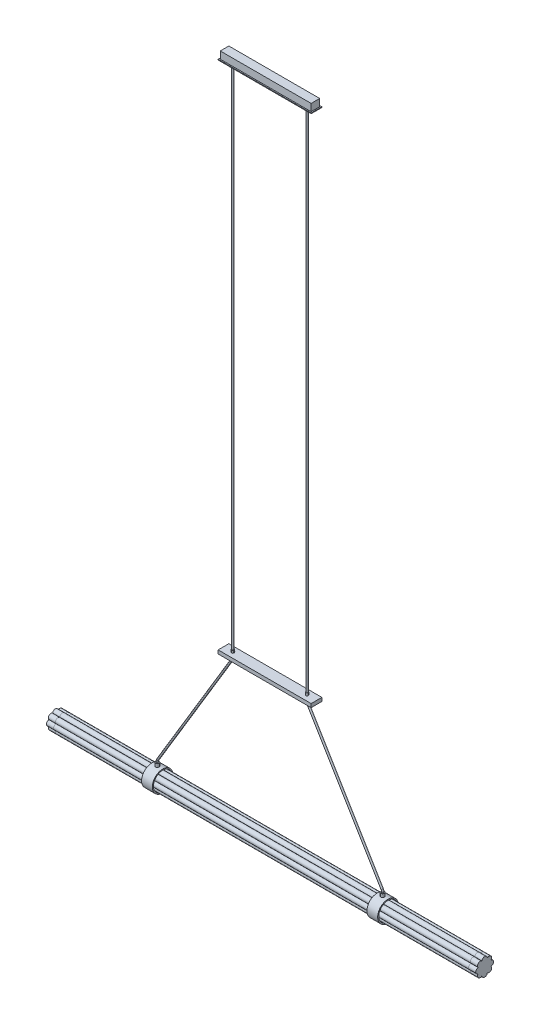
ISO-10303-21;
HEADER;
FILE_DESCRIPTION(('STEP AP214'),'2;1');
FILE_NAME('part.step','',(''),(''),'','','');
FILE_SCHEMA(('AUTOMOTIVE_DESIGN { 1 0 10303 214 1 1 1 1 }'));
ENDSEC;
DATA;
#1=APPLICATION_CONTEXT('core data for automotive mechanical design processes');
#2=APPLICATION_PROTOCOL_DEFINITION('international standard','automotive_design',2000,#1);
#3=PRODUCT_CONTEXT('',#1,'mechanical');
#4=PRODUCT('Part','Part','',(#3));
#5=PRODUCT_RELATED_PRODUCT_CATEGORY('part','',(#4));
#6=PRODUCT_DEFINITION_FORMATION('','',#4);
#7=PRODUCT_DEFINITION_CONTEXT('part definition',#1,'design');
#8=PRODUCT_DEFINITION('design','',#6,#7);
#9=PRODUCT_DEFINITION_SHAPE('','',#8);
#10=(LENGTH_UNIT() NAMED_UNIT(*) SI_UNIT(.MILLI.,.METRE.));
#11=(NAMED_UNIT(*) PLANE_ANGLE_UNIT() SI_UNIT($,.RADIAN.));
#12=(NAMED_UNIT(*) SI_UNIT($,.STERADIAN.) SOLID_ANGLE_UNIT());
#13=UNCERTAINTY_MEASURE_WITH_UNIT(LENGTH_MEASURE(1.E-05),#10,'distance_accuracy_value','');
#14=(GEOMETRIC_REPRESENTATION_CONTEXT(3) GLOBAL_UNCERTAINTY_ASSIGNED_CONTEXT((#13)) GLOBAL_UNIT_ASSIGNED_CONTEXT((#10,
#11,#12)) REPRESENTATION_CONTEXT('',''));
#15=CARTESIAN_POINT('',(0.,0.,0.));
#16=DIRECTION('',(0.,0.,1.));
#17=DIRECTION('',(1.,0.,0.));
#18=AXIS2_PLACEMENT_3D('',#15,#16,#17);
#19=CARTESIAN_POINT('',(0.,1840.,0.));
#20=DIRECTION('',(0.,-1.,0.));
#21=DIRECTION('',(0.,0.,-1.));
#22=AXIS2_PLACEMENT_3D('',#19,#20,#21);
#23=PLANE('',#22);
#24=DIRECTION('',(0.,0.,1.));
#25=VECTOR('',#24,1.);
#26=CARTESIAN_POINT('',(-130.,1840.,-15.));
#27=LINE('',#26,#25);
#28=CARTESIAN_POINT('',(-130.,1840.,-15.));
#29=VERTEX_POINT('',#28);
#30=CARTESIAN_POINT('',(-130.,1840.,15.));
#31=VERTEX_POINT('',#30);
#32=EDGE_CURVE('E172',#29,#31,#27,.T.);
#33=ORIENTED_EDGE('',*,*,#32,.T.);
#34=DIRECTION('',(1.,0.,0.));
#35=VECTOR('',#34,1.);
#36=CARTESIAN_POINT('',(130.,1840.,15.));
#37=LINE('',#36,#35);
#38=CARTESIAN_POINT('',(130.,1840.,15.));
#39=VERTEX_POINT('',#38);
#40=EDGE_CURVE('E175',#31,#39,#37,.T.);
#41=ORIENTED_EDGE('',*,*,#40,.T.);
#42=DIRECTION('',(0.,0.,-1.));
#43=VECTOR('',#42,1.);
#44=CARTESIAN_POINT('',(130.,1840.,-15.));
#45=LINE('',#44,#43);
#46=CARTESIAN_POINT('',(130.,1840.,-15.));
#47=VERTEX_POINT('',#46);
#48=EDGE_CURVE('E178',#39,#47,#45,.T.);
#49=ORIENTED_EDGE('',*,*,#48,.T.);
#50=DIRECTION('',(-1.,0.,0.));
#51=VECTOR('',#50,1.);
#52=CARTESIAN_POINT('',(130.,1840.,-15.));
#53=LINE('',#52,#51);
#54=EDGE_CURVE('E180',#47,#29,#53,.T.);
#55=ORIENTED_EDGE('',*,*,#54,.T.);
#56=EDGE_LOOP('',(#33,#41,#49,#55));
#57=FACE_BOUND('',#56,.T.);
#58=DIRECTION('',(-1.,0.,0.));
#59=VECTOR('',#58,1.);
#60=CARTESIAN_POINT('',(127.,1840.,-12.));
#61=LINE('',#60,#59);
#62=CARTESIAN_POINT('',(127.,1840.,-12.));
#63=VERTEX_POINT('',#62);
#64=CARTESIAN_POINT('',(-127.,1840.,-12.));
#65=VERTEX_POINT('',#64);
#66=EDGE_CURVE('E70',#63,#65,#61,.T.);
#67=ORIENTED_EDGE('',*,*,#66,.F.);
#68=DIRECTION('',(0.,0.,-1.));
#69=VECTOR('',#68,1.);
#70=CARTESIAN_POINT('',(127.,1840.,12.));
#71=LINE('',#70,#69);
#72=CARTESIAN_POINT('',(127.,1840.,12.));
#73=VERTEX_POINT('',#72);
#74=EDGE_CURVE('E74',#73,#63,#71,.T.);
#75=ORIENTED_EDGE('',*,*,#74,.F.);
#76=DIRECTION('',(1.,0.,0.));
#77=VECTOR('',#76,1.);
#78=CARTESIAN_POINT('',(-127.,1840.,12.));
#79=LINE('',#78,#77);
#80=CARTESIAN_POINT('',(-127.,1840.,12.));
#81=VERTEX_POINT('',#80);
#82=EDGE_CURVE('E448',#81,#73,#79,.T.);
#83=ORIENTED_EDGE('',*,*,#82,.F.);
#84=DIRECTION('',(0.,0.,1.));
#85=VECTOR('',#84,1.);
#86=CARTESIAN_POINT('',(-127.,1840.,-12.));
#87=LINE('',#86,#85);
#88=EDGE_CURVE('E454',#65,#81,#87,.T.);
#89=ORIENTED_EDGE('',*,*,#88,.F.);
#90=EDGE_LOOP('',(#67,#75,#83,#89));
#91=FACE_BOUND('',#90,.T.);
#92=ADVANCED_FACE('F54',(#57,#91),#23,.F.);
#93=CARTESIAN_POINT('',(-315.000000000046,37.9999999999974,0.));
#94=DIRECTION('',(0.,-1.,0.));
#95=DIRECTION('',(0.,0.,-1.));
#96=AXIS2_PLACEMENT_3D('',#93,#94,#95);
#97=PLANE('',#96);
#98=CARTESIAN_POINT('',(-315.000000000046,37.9999999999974,0.));
#99=DIRECTION('',(0.,-1.,0.));
#100=DIRECTION('',(0.,0.,-1.));
#101=AXIS2_PLACEMENT_3D('',#98,#99,#100);
#102=CIRCLE('',#101,2.5);
#103=CARTESIAN_POINT('',(-315.000000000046,37.9999999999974,-2.5));
#104=VERTEX_POINT('',#103);
#105=EDGE_CURVE('E201',#104,#104,#102,.T.);
#106=ORIENTED_EDGE('',*,*,#105,.T.);
#107=EDGE_LOOP('',(#106));
#108=FACE_BOUND('',#107,.T.);
#109=ADVANCED_FACE('F56',(#108),#97,.T.);
#110=CARTESIAN_POINT('',(-315.000000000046,37.9999999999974,0.));
#111=DIRECTION('',(0.,1.,0.));
#112=DIRECTION('',(-1.,0.,0.));
#113=AXIS2_PLACEMENT_3D('',#110,#111,#112);
#114=CYLINDRICAL_SURFACE('',#113,2.5);
#115=CARTESIAN_POINT('',(-315.000000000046,40.2267875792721,0.));
#116=DIRECTION('',(0.,-1.,0.));
#117=DIRECTION('',(0.,0.,-1.));
#118=AXIS2_PLACEMENT_3D('',#115,#116,#117);
#119=CIRCLE('',#118,2.5);
#120=CARTESIAN_POINT('',(-317.5,40.2267875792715,0.));
#121=VERTEX_POINT('',#120);
#122=EDGE_CURVE('E204',#121,#121,#119,.T.);
#123=ORIENTED_EDGE('',*,*,#122,.T.);
#124=EDGE_LOOP('',(#123));
#125=FACE_BOUND('',#124,.T.);
#126=ORIENTED_EDGE('',*,*,#105,.F.);
#127=EDGE_LOOP('',(#126));
#128=FACE_BOUND('',#127,.T.);
#129=ADVANCED_FACE('F238',(#125,#128),#114,.T.);
#130=CARTESIAN_POINT('',(-305.,40.2267875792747,0.));
#131=DIRECTION('',(0.,0.,-1.));
#132=DIRECTION('',(-1.,0.,0.));
#133=AXIS2_PLACEMENT_3D('',#130,#131,#132);
#134=TOROIDAL_SURFACE('',#133,10.,2.5);
#135=CARTESIAN_POINT('',(-313.571704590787,45.3771157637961,0.));
#136=DIRECTION('',(-0.515032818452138,-0.857170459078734,0.));
#137=DIRECTION('',(0.,0.,-1.));
#138=AXIS2_PLACEMENT_3D('',#135,#136,#137);
#139=CIRCLE('',#138,2.5);
#140=CARTESIAN_POINT('',(-315.714630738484,46.6646978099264,0.));
#141=VERTEX_POINT('',#140);
#142=EDGE_CURVE('E207',#141,#141,#139,.T.);
#143=CARTESIAN_POINT('',(-305.,40.2267875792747,0.));
#144=DIRECTION('',(0.,0.,-1.));
#145=DIRECTION('',(-1.,0.,0.));
#146=AXIS2_PLACEMENT_3D('',#143,#144,#145);
#147=CIRCLE('',#146,12.5);
#148=EDGE_CURVE('',#121,#141,#147,.T.);
#149=ORIENTED_EDGE('',*,*,#122,.F.);
#150=ORIENTED_EDGE('',*,*,#142,.T.);
#151=ORIENTED_EDGE('',*,*,#148,.T.);
#152=ORIENTED_EDGE('',*,*,#148,.F.);
#153=EDGE_LOOP('',(#149,#151,#150,#152));
#154=FACE_BOUND('',#153,.T.);
#155=ADVANCED_FACE('F265',(#154),#134,.T.);
#156=CARTESIAN_POINT('',(-313.571704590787,45.3771157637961,0.));
#157=DIRECTION('',(0.515032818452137,0.857170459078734,0.));
#158=DIRECTION('',(-0.857170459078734,0.515032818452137,0.));
#159=AXIS2_PLACEMENT_3D('',#156,#157,#158);
#160=CYLINDRICAL_SURFACE('',#159,2.5);
#161=CARTESIAN_POINT('',(-104.928295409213,392.622884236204,0.));
#162=DIRECTION('',(-0.515032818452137,-0.857170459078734,0.));
#163=DIRECTION('',(0.,0.,-1.));
#164=AXIS2_PLACEMENT_3D('',#161,#162,#163);
#165=CIRCLE('',#164,2.5);
#166=CARTESIAN_POINT('',(-102.785369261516,391.335302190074,0.));
#167=VERTEX_POINT('',#166);
#168=EDGE_CURVE('E210',#167,#167,#165,.T.);
#169=ORIENTED_EDGE('',*,*,#168,.T.);
#170=EDGE_LOOP('',(#169));
#171=FACE_BOUND('',#170,.T.);
#172=ORIENTED_EDGE('',*,*,#142,.F.);
#173=EDGE_LOOP('',(#172));
#174=FACE_BOUND('',#173,.T.);
#175=ADVANCED_FACE('F230',(#171,#174),#160,.T.);
#176=CARTESIAN_POINT('',(-113.5,397.773212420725,0.));
#177=DIRECTION('',(0.,0.,1.));
#178=DIRECTION('',(1.,0.,0.));
#179=AXIS2_PLACEMENT_3D('',#176,#177,#178);
#180=TOROIDAL_SURFACE('',#179,10.,2.5);
#181=CARTESIAN_POINT('',(-103.5,397.773212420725,0.));
#182=DIRECTION('',(0.,-1.,0.));
#183=DIRECTION('',(0.,0.,-1.));
#184=AXIS2_PLACEMENT_3D('',#181,#182,#183);
#185=CIRCLE('',#184,2.5);
#186=CARTESIAN_POINT('',(-101.,397.773212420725,0.));
#187=VERTEX_POINT('',#186);
#188=EDGE_CURVE('E63',#187,#187,#185,.T.);
#189=CARTESIAN_POINT('',(-113.5,397.773212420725,0.));
#190=DIRECTION('',(0.,0.,1.));
#191=DIRECTION('',(1.,0.,0.));
#192=AXIS2_PLACEMENT_3D('',#189,#190,#191);
#193=CIRCLE('',#192,12.5);
#194=EDGE_CURVE('',#167,#187,#193,.T.);
#195=ORIENTED_EDGE('',*,*,#168,.F.);
#196=ORIENTED_EDGE('',*,*,#188,.T.);
#197=ORIENTED_EDGE('',*,*,#194,.T.);
#198=ORIENTED_EDGE('',*,*,#194,.F.);
#199=EDGE_LOOP('',(#195,#197,#196,#198));
#200=FACE_BOUND('',#199,.T.);
#201=ADVANCED_FACE('F216',(#200),#180,.T.);
#202=CARTESIAN_POINT('',(-103.500000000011,397.773212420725,0.));
#203=DIRECTION('',(0.,1.,0.));
#204=DIRECTION('',(-1.,0.,0.));
#205=AXIS2_PLACEMENT_3D('',#202,#203,#204);
#206=CYLINDRICAL_SURFACE('',#205,2.5);
#207=CARTESIAN_POINT('',(-103.500000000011,399.999999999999,0.));
#208=DIRECTION('',(0.,-1.,0.));
#209=DIRECTION('',(0.,0.,-1.));
#210=AXIS2_PLACEMENT_3D('',#207,#208,#209);
#211=CIRCLE('',#210,2.5);
#212=CARTESIAN_POINT('',(-103.500000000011,399.999999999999,-2.5));
#213=VERTEX_POINT('',#212);
#214=EDGE_CURVE('E13',#213,#213,#211,.T.);
#215=ORIENTED_EDGE('',*,*,#214,.T.);
#216=EDGE_LOOP('',(#215));
#217=FACE_BOUND('',#216,.T.);
#218=ORIENTED_EDGE('',*,*,#188,.F.);
#219=EDGE_LOOP('',(#218));
#220=FACE_BOUND('',#219,.T.);
#221=ADVANCED_FACE('F219',(#217,#220),#206,.T.);
#222=CARTESIAN_POINT('',(-103.5,400.,0.));
#223=DIRECTION('',(0.,1.,0.));
#224=DIRECTION('',(0.,0.,1.));
#225=AXIS2_PLACEMENT_3D('',#222,#223,#224);
#226=CYLINDRICAL_SURFACE('',#225,2.5);
#227=CARTESIAN_POINT('',(-103.5,1838.,0.));
#228=DIRECTION('',(0.,-1.,0.));
#229=DIRECTION('',(0.,0.,-1.));
#230=AXIS2_PLACEMENT_3D('',#227,#228,#229);
#231=CIRCLE('',#230,2.5);
#232=CARTESIAN_POINT('',(-103.5,1838.,-2.5));
#233=VERTEX_POINT('',#232);
#234=EDGE_CURVE('E58',#233,#233,#231,.T.);
#235=ORIENTED_EDGE('',*,*,#234,.T.);
#236=EDGE_LOOP('',(#235));
#237=FACE_BOUND('',#236,.T.);
#238=ORIENTED_EDGE('',*,*,#214,.F.);
#239=EDGE_LOOP('',(#238));
#240=FACE_BOUND('',#239,.T.);
#241=ADVANCED_FACE('F221',(#237,#240),#226,.T.);
#242=CARTESIAN_POINT('',(-130.,1840.,-15.));
#243=DIRECTION('',(1.,0.,0.));
#244=DIRECTION('',(0.,0.,-1.));
#245=AXIS2_PLACEMENT_3D('',#242,#243,#244);
#246=PLANE('',#245);
#247=DIRECTION('',(0.,0.,1.));
#248=VECTOR('',#247,1.);
#249=CARTESIAN_POINT('',(-130.,1838.,-15.));
#250=LINE('',#249,#248);
#251=CARTESIAN_POINT('',(-130.,1838.,-15.));
#252=VERTEX_POINT('',#251);
#253=CARTESIAN_POINT('',(-130.,1838.,15.));
#254=VERTEX_POINT('',#253);
#255=EDGE_CURVE('E171',#252,#254,#250,.T.);
#256=ORIENTED_EDGE('',*,*,#255,.T.);
#257=DIRECTION('',(0.,-1.,0.));
#258=VECTOR('',#257,1.);
#259=CARTESIAN_POINT('',(-130.,1840.,15.));
#260=LINE('',#259,#258);
#261=EDGE_CURVE('E198',#31,#254,#260,.T.);
#262=ORIENTED_EDGE('',*,*,#261,.F.);
#263=ORIENTED_EDGE('',*,*,#32,.F.);
#264=DIRECTION('',(0.,-1.,0.));
#265=VECTOR('',#264,1.);
#266=CARTESIAN_POINT('',(-130.,1840.,-15.));
#267=LINE('',#266,#265);
#268=EDGE_CURVE('E182',#29,#252,#267,.T.);
#269=ORIENTED_EDGE('',*,*,#268,.T.);
#270=EDGE_LOOP('',(#256,#262,#263,#269));
#271=FACE_BOUND('',#270,.T.);
#272=ADVANCED_FACE('F228',(#271),#246,.F.);
#273=CARTESIAN_POINT('',(130.,1840.,15.));
#274=DIRECTION('',(0.,0.,-1.));
#275=DIRECTION('',(-1.,0.,0.));
#276=AXIS2_PLACEMENT_3D('',#273,#274,#275);
#277=PLANE('',#276);
#278=DIRECTION('',(1.,0.,0.));
#279=VECTOR('',#278,1.);
#280=CARTESIAN_POINT('',(130.,1838.,15.));
#281=LINE('',#280,#279);
#282=CARTESIAN_POINT('',(130.,1838.,15.));
#283=VERTEX_POINT('',#282);
#284=EDGE_CURVE('E185',#254,#283,#281,.T.);
#285=ORIENTED_EDGE('',*,*,#284,.T.);
#286=DIRECTION('',(0.,-1.,0.));
#287=VECTOR('',#286,1.);
#288=CARTESIAN_POINT('',(130.,1840.,15.));
#289=LINE('',#288,#287);
#290=EDGE_CURVE('E195',#39,#283,#289,.T.);
#291=ORIENTED_EDGE('',*,*,#290,.F.);
#292=ORIENTED_EDGE('',*,*,#40,.F.);
#293=ORIENTED_EDGE('',*,*,#261,.T.);
#294=EDGE_LOOP('',(#285,#291,#292,#293));
#295=FACE_BOUND('',#294,.T.);
#296=ADVANCED_FACE('F255',(#295),#277,.F.);
#297=CARTESIAN_POINT('',(130.,1840.,-15.));
#298=DIRECTION('',(-1.,0.,0.));
#299=DIRECTION('',(0.,0.,1.));
#300=AXIS2_PLACEMENT_3D('',#297,#298,#299);
#301=PLANE('',#300);
#302=DIRECTION('',(0.,0.,-1.));
#303=VECTOR('',#302,1.);
#304=CARTESIAN_POINT('',(130.,1838.,-15.));
#305=LINE('',#304,#303);
#306=CARTESIAN_POINT('',(130.,1838.,-15.));
#307=VERTEX_POINT('',#306);
#308=EDGE_CURVE('E187',#283,#307,#305,.T.);
#309=ORIENTED_EDGE('',*,*,#308,.T.);
#310=DIRECTION('',(0.,-1.,0.));
#311=VECTOR('',#310,1.);
#312=CARTESIAN_POINT('',(130.,1840.,-15.));
#313=LINE('',#312,#311);
#314=EDGE_CURVE('E192',#47,#307,#313,.T.);
#315=ORIENTED_EDGE('',*,*,#314,.F.);
#316=ORIENTED_EDGE('',*,*,#48,.F.);
#317=ORIENTED_EDGE('',*,*,#290,.T.);
#318=EDGE_LOOP('',(#309,#315,#316,#317));
#319=FACE_BOUND('',#318,.T.);
#320=ADVANCED_FACE('F251',(#319),#301,.F.);
#321=CARTESIAN_POINT('',(130.,1840.,-15.));
#322=DIRECTION('',(0.,0.,1.));
#323=DIRECTION('',(1.,0.,0.));
#324=AXIS2_PLACEMENT_3D('',#321,#322,#323);
#325=PLANE('',#324);
#326=DIRECTION('',(-1.,0.,0.));
#327=VECTOR('',#326,1.);
#328=CARTESIAN_POINT('',(130.,1838.,-15.));
#329=LINE('',#328,#327);
#330=EDGE_CURVE('E176',#307,#252,#329,.T.);
#331=ORIENTED_EDGE('',*,*,#330,.T.);
#332=ORIENTED_EDGE('',*,*,#268,.F.);
#333=ORIENTED_EDGE('',*,*,#54,.F.);
#334=ORIENTED_EDGE('',*,*,#314,.T.);
#335=EDGE_LOOP('',(#331,#332,#333,#334));
#336=FACE_BOUND('',#335,.T.);
#337=ADVANCED_FACE('F247',(#336),#325,.F.);
#338=CARTESIAN_POINT('',(0.,1838.,0.));
#339=DIRECTION('',(0.,-1.,0.));
#340=DIRECTION('',(0.,0.,-1.));
#341=AXIS2_PLACEMENT_3D('',#338,#339,#340);
#342=PLANE('',#341);
#343=CARTESIAN_POINT('',(103.5,1838.,0.));
#344=DIRECTION('',(0.,1.,0.));
#345=DIRECTION('',(0.,0.,-1.));
#346=AXIS2_PLACEMENT_3D('',#343,#344,#345);
#347=CIRCLE('',#346,2.5);
#348=CARTESIAN_POINT('',(103.5,1838.,-2.5));
#349=VERTEX_POINT('',#348);
#350=EDGE_CURVE('E168',#349,#349,#347,.T.);
#351=ORIENTED_EDGE('',*,*,#350,.T.);
#352=EDGE_LOOP('',(#351));
#353=FACE_BOUND('',#352,.T.);
#354=ORIENTED_EDGE('',*,*,#234,.F.);
#355=EDGE_LOOP('',(#354));
#356=FACE_BOUND('',#355,.T.);
#357=ORIENTED_EDGE('',*,*,#255,.F.);
#358=ORIENTED_EDGE('',*,*,#330,.F.);
#359=ORIENTED_EDGE('',*,*,#308,.F.);
#360=ORIENTED_EDGE('',*,*,#284,.F.);
#361=EDGE_LOOP('',(#357,#358,#359,#360));
#362=FACE_BOUND('',#361,.T.);
#363=ADVANCED_FACE('F244',(#353,#356,#362),#342,.T.);
#364=CARTESIAN_POINT('',(315.000000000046,37.9999999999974,0.));
#365=DIRECTION('',(0.,-1.,0.));
#366=DIRECTION('',(0.,0.,-1.));
#367=AXIS2_PLACEMENT_3D('',#364,#365,#366);
#368=PLANE('',#367);
#369=CARTESIAN_POINT('',(315.000000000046,37.9999999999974,0.));
#370=DIRECTION('',(0.,1.,0.));
#371=DIRECTION('',(0.,0.,-1.));
#372=AXIS2_PLACEMENT_3D('',#369,#370,#371);
#373=CIRCLE('',#372,2.5);
#374=CARTESIAN_POINT('',(315.000000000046,37.9999999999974,-2.5));
#375=VERTEX_POINT('',#374);
#376=EDGE_CURVE('E146',#375,#375,#373,.T.);
#377=ORIENTED_EDGE('',*,*,#376,.F.);
#378=EDGE_LOOP('',(#377));
#379=FACE_BOUND('',#378,.T.);
#380=ADVANCED_FACE('F242',(#379),#368,.T.);
#381=CARTESIAN_POINT('',(315.000000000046,37.9999999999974,0.));
#382=DIRECTION('',(0.,1.,0.));
#383=DIRECTION('',(1.,0.,0.));
#384=AXIS2_PLACEMENT_3D('',#381,#382,#383);
#385=CYLINDRICAL_SURFACE('',#384,2.5);
#386=CARTESIAN_POINT('',(315.000000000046,40.2267875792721,0.));
#387=DIRECTION('',(0.,1.,0.));
#388=DIRECTION('',(0.,0.,-1.));
#389=AXIS2_PLACEMENT_3D('',#386,#387,#388);
#390=CIRCLE('',#389,2.5);
#391=CARTESIAN_POINT('',(317.5,40.2267875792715,0.));
#392=VERTEX_POINT('',#391);
#393=EDGE_CURVE('E148',#392,#392,#390,.T.);
#394=ORIENTED_EDGE('',*,*,#393,.F.);
#395=EDGE_LOOP('',(#394));
#396=FACE_BOUND('',#395,.T.);
#397=ORIENTED_EDGE('',*,*,#376,.T.);
#398=EDGE_LOOP('',(#397));
#399=FACE_BOUND('',#398,.T.);
#400=ADVANCED_FACE('F337',(#396,#399),#385,.T.);
#401=CARTESIAN_POINT('',(305.,40.2267875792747,0.));
#402=DIRECTION('',(0.,0.,-1.));
#403=DIRECTION('',(1.,0.,0.));
#404=AXIS2_PLACEMENT_3D('',#401,#402,#403);
#405=TOROIDAL_SURFACE('',#404,10.,2.5);
#406=CARTESIAN_POINT('',(313.571704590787,45.3771157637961,0.));
#407=DIRECTION('',(-0.515032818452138,0.857170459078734,0.));
#408=DIRECTION('',(0.,0.,-1.));
#409=AXIS2_PLACEMENT_3D('',#406,#407,#408);
#410=CIRCLE('',#409,2.5);
#411=CARTESIAN_POINT('',(315.714630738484,46.6646978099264,0.));
#412=VERTEX_POINT('',#411);
#413=EDGE_CURVE('E156',#412,#412,#410,.T.);
#414=CARTESIAN_POINT('',(305.,40.2267875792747,0.));
#415=DIRECTION('',(0.,0.,-1.));
#416=DIRECTION('',(1.,0.,0.));
#417=AXIS2_PLACEMENT_3D('',#414,#415,#416);
#418=CIRCLE('',#417,12.5);
#419=EDGE_CURVE('',#412,#392,#418,.T.);
#420=ORIENTED_EDGE('',*,*,#413,.F.);
#421=ORIENTED_EDGE('',*,*,#393,.T.);
#422=ORIENTED_EDGE('',*,*,#419,.T.);
#423=ORIENTED_EDGE('',*,*,#419,.F.);
#424=EDGE_LOOP('',(#420,#422,#421,#423));
#425=FACE_BOUND('',#424,.T.);
#426=ADVANCED_FACE('F346',(#425),#405,.T.);
#427=CARTESIAN_POINT('',(313.571704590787,45.3771157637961,0.));
#428=DIRECTION('',(-0.515032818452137,0.857170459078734,0.));
#429=DIRECTION('',(0.857170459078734,0.515032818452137,0.));
#430=AXIS2_PLACEMENT_3D('',#427,#428,#429);
#431=CYLINDRICAL_SURFACE('',#430,2.5);
#432=CARTESIAN_POINT('',(104.928295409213,392.622884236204,0.));
#433=DIRECTION('',(-0.515032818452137,0.857170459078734,0.));
#434=DIRECTION('',(0.,0.,-1.));
#435=AXIS2_PLACEMENT_3D('',#432,#433,#434);
#436=CIRCLE('',#435,2.5);
#437=CARTESIAN_POINT('',(102.785369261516,391.335302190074,0.));
#438=VERTEX_POINT('',#437);
#439=EDGE_CURVE('E159',#438,#438,#436,.T.);
#440=ORIENTED_EDGE('',*,*,#439,.F.);
#441=EDGE_LOOP('',(#440));
#442=FACE_BOUND('',#441,.T.);
#443=ORIENTED_EDGE('',*,*,#413,.T.);
#444=EDGE_LOOP('',(#443));
#445=FACE_BOUND('',#444,.T.);
#446=ADVANCED_FACE('F356',(#442,#445),#431,.T.);
#447=CARTESIAN_POINT('',(113.5,397.773212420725,0.));
#448=DIRECTION('',(0.,0.,1.));
#449=DIRECTION('',(-1.,0.,0.));
#450=AXIS2_PLACEMENT_3D('',#447,#448,#449);
#451=TOROIDAL_SURFACE('',#450,10.,2.5);
#452=CARTESIAN_POINT('',(103.5,397.773212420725,0.));
#453=DIRECTION('',(0.,1.,0.));
#454=DIRECTION('',(0.,0.,-1.));
#455=AXIS2_PLACEMENT_3D('',#452,#453,#454);
#456=CIRCLE('',#455,2.5);
#457=CARTESIAN_POINT('',(101.,397.773212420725,0.));
#458=VERTEX_POINT('',#457);
#459=EDGE_CURVE('E162',#458,#458,#456,.T.);
#460=CARTESIAN_POINT('',(113.5,397.773212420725,0.));
#461=DIRECTION('',(0.,0.,1.));
#462=DIRECTION('',(-1.,0.,0.));
#463=AXIS2_PLACEMENT_3D('',#460,#461,#462);
#464=CIRCLE('',#463,12.5);
#465=EDGE_CURVE('',#458,#438,#464,.T.);
#466=ORIENTED_EDGE('',*,*,#459,.F.);
#467=ORIENTED_EDGE('',*,*,#439,.T.);
#468=ORIENTED_EDGE('',*,*,#465,.T.);
#469=ORIENTED_EDGE('',*,*,#465,.F.);
#470=EDGE_LOOP('',(#466,#468,#467,#469));
#471=FACE_BOUND('',#470,.T.);
#472=ADVANCED_FACE('F366',(#471),#451,.T.);
#473=CARTESIAN_POINT('',(103.500000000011,397.773212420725,0.));
#474=DIRECTION('',(0.,1.,0.));
#475=DIRECTION('',(1.,0.,0.));
#476=AXIS2_PLACEMENT_3D('',#473,#474,#475);
#477=CYLINDRICAL_SURFACE('',#476,2.5);
#478=CARTESIAN_POINT('',(103.500000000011,399.999999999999,0.));
#479=DIRECTION('',(0.,1.,0.));
#480=DIRECTION('',(0.,0.,-1.));
#481=AXIS2_PLACEMENT_3D('',#478,#479,#480);
#482=CIRCLE('',#481,2.5);
#483=CARTESIAN_POINT('',(103.500000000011,399.999999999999,-2.5));
#484=VERTEX_POINT('',#483);
#485=EDGE_CURVE('E165',#484,#484,#482,.T.);
#486=ORIENTED_EDGE('',*,*,#485,.F.);
#487=EDGE_LOOP('',(#486));
#488=FACE_BOUND('',#487,.T.);
#489=ORIENTED_EDGE('',*,*,#459,.T.);
#490=EDGE_LOOP('',(#489));
#491=FACE_BOUND('',#490,.T.);
#492=ADVANCED_FACE('F376',(#488,#491),#477,.T.);
#493=CARTESIAN_POINT('',(103.5,400.,0.));
#494=DIRECTION('',(0.,1.,0.));
#495=DIRECTION('',(0.,0.,1.));
#496=AXIS2_PLACEMENT_3D('',#493,#494,#495);
#497=CYLINDRICAL_SURFACE('',#496,2.5);
#498=ORIENTED_EDGE('',*,*,#350,.F.);
#499=EDGE_LOOP('',(#498));
#500=FACE_BOUND('',#499,.T.);
#501=ORIENTED_EDGE('',*,*,#485,.T.);
#502=EDGE_LOOP('',(#501));
#503=FACE_BOUND('',#502,.T.);
#504=ADVANCED_FACE('F386',(#500,#503),#497,.T.);
#505=CARTESIAN_POINT('',(127.,1860.,-12.));
#506=DIRECTION('',(0.,0.,1.));
#507=DIRECTION('',(1.,0.,0.));
#508=AXIS2_PLACEMENT_3D('',#505,#506,#507);
#509=PLANE('',#508);
#510=ORIENTED_EDGE('',*,*,#66,.T.);
#511=DIRECTION('',(0.,-1.,0.));
#512=VECTOR('',#511,1.);
#513=CARTESIAN_POINT('',(-127.,1860.,-12.));
#514=LINE('',#513,#512);
#515=CARTESIAN_POINT('',(-127.,1860.,-12.));
#516=VERTEX_POINT('',#515);
#517=EDGE_CURVE('E129',#516,#65,#514,.T.);
#518=ORIENTED_EDGE('',*,*,#517,.F.);
#519=DIRECTION('',(-1.,0.,0.));
#520=VECTOR('',#519,1.);
#521=CARTESIAN_POINT('',(127.,1860.,-12.));
#522=LINE('',#521,#520);
#523=CARTESIAN_POINT('',(127.,1860.,-12.));
#524=VERTEX_POINT('',#523);
#525=EDGE_CURVE('E135',#524,#516,#522,.T.);
#526=ORIENTED_EDGE('',*,*,#525,.F.);
#527=DIRECTION('',(0.,-1.,0.));
#528=VECTOR('',#527,1.);
#529=CARTESIAN_POINT('',(127.,1860.,-12.));
#530=LINE('',#529,#528);
#531=EDGE_CURVE('E446',#524,#63,#530,.T.);
#532=ORIENTED_EDGE('',*,*,#531,.T.);
#533=EDGE_LOOP('',(#510,#518,#526,#532));
#534=FACE_BOUND('',#533,.T.);
#535=ADVANCED_FACE('F145',(#534),#509,.F.);
#536=CARTESIAN_POINT('',(-127.,1860.,-12.));
#537=DIRECTION('',(1.,0.,0.));
#538=DIRECTION('',(0.,0.,-1.));
#539=AXIS2_PLACEMENT_3D('',#536,#537,#538);
#540=PLANE('',#539);
#541=ORIENTED_EDGE('',*,*,#88,.T.);
#542=DIRECTION('',(0.,-1.,0.));
#543=VECTOR('',#542,1.);
#544=CARTESIAN_POINT('',(-127.,1860.,12.));
#545=LINE('',#544,#543);
#546=CARTESIAN_POINT('',(-127.,1860.,12.));
#547=VERTEX_POINT('',#546);
#548=EDGE_CURVE('E131',#547,#81,#545,.T.);
#549=ORIENTED_EDGE('',*,*,#548,.F.);
#550=DIRECTION('',(0.,0.,1.));
#551=VECTOR('',#550,1.);
#552=CARTESIAN_POINT('',(-127.,1860.,-12.));
#553=LINE('',#552,#551);
#554=EDGE_CURVE('E124',#516,#547,#553,.T.);
#555=ORIENTED_EDGE('',*,*,#554,.F.);
#556=ORIENTED_EDGE('',*,*,#517,.T.);
#557=EDGE_LOOP('',(#541,#549,#555,#556));
#558=FACE_BOUND('',#557,.T.);
#559=ADVANCED_FACE('F127',(#558),#540,.F.);
#560=CARTESIAN_POINT('',(-127.,1860.,12.));
#561=DIRECTION('',(0.,0.,-1.));
#562=DIRECTION('',(-1.,0.,0.));
#563=AXIS2_PLACEMENT_3D('',#560,#561,#562);
#564=PLANE('',#563);
#565=ORIENTED_EDGE('',*,*,#82,.T.);
#566=DIRECTION('',(0.,-1.,0.));
#567=VECTOR('',#566,1.);
#568=CARTESIAN_POINT('',(127.,1860.,12.));
#569=LINE('',#568,#567);
#570=CARTESIAN_POINT('',(127.,1860.,12.));
#571=VERTEX_POINT('',#570);
#572=EDGE_CURVE('E150',#571,#73,#569,.T.);
#573=ORIENTED_EDGE('',*,*,#572,.F.);
#574=DIRECTION('',(1.,0.,0.));
#575=VECTOR('',#574,1.);
#576=CARTESIAN_POINT('',(-127.,1860.,12.));
#577=LINE('',#576,#575);
#578=EDGE_CURVE('E134',#547,#571,#577,.T.);
#579=ORIENTED_EDGE('',*,*,#578,.F.);
#580=ORIENTED_EDGE('',*,*,#548,.T.);
#581=EDGE_LOOP('',(#565,#573,#579,#580));
#582=FACE_BOUND('',#581,.T.);
#583=ADVANCED_FACE('F414',(#582),#564,.F.);
#584=CARTESIAN_POINT('',(127.,1860.,12.));
#585=DIRECTION('',(-1.,0.,0.));
#586=DIRECTION('',(0.,0.,1.));
#587=AXIS2_PLACEMENT_3D('',#584,#585,#586);
#588=PLANE('',#587);
#589=ORIENTED_EDGE('',*,*,#74,.T.);
#590=ORIENTED_EDGE('',*,*,#531,.F.);
#591=DIRECTION('',(0.,0.,-1.));
#592=VECTOR('',#591,1.);
#593=CARTESIAN_POINT('',(127.,1860.,12.));
#594=LINE('',#593,#592);
#595=EDGE_CURVE('E140',#571,#524,#594,.T.);
#596=ORIENTED_EDGE('',*,*,#595,.F.);
#597=ORIENTED_EDGE('',*,*,#572,.T.);
#598=EDGE_LOOP('',(#589,#590,#596,#597));
#599=FACE_BOUND('',#598,.T.);
#600=ADVANCED_FACE('F423',(#599),#588,.F.);
#601=CARTESIAN_POINT('',(0.,1860.,0.));
#602=DIRECTION('',(0.,1.,0.));
#603=DIRECTION('',(0.,0.,1.));
#604=AXIS2_PLACEMENT_3D('',#601,#602,#603);
#605=PLANE('',#604);
#606=ORIENTED_EDGE('',*,*,#525,.T.);
#607=ORIENTED_EDGE('',*,*,#554,.T.);
#608=ORIENTED_EDGE('',*,*,#578,.T.);
#609=ORIENTED_EDGE('',*,*,#595,.T.);
#610=EDGE_LOOP('',(#606,#607,#608,#609));
#611=FACE_BOUND('',#610,.T.);
#612=ADVANCED_FACE('F138',(#611),#605,.T.);
#613=CLOSED_SHELL('',(#92,#109,#129,#155,#175,#201,#221,#241,#272,#296,#320,#337,#363,#380,#400,
#426,#446,#472,#492,#504,#535,#559,#583,#600,#612));
#614=MANIFOLD_SOLID_BREP('B2',#613);
#615=CARTESIAN_POINT('',(-102.,412.5,0.));
#616=DIRECTION('',(1.,0.,0.));
#617=DIRECTION('',(0.,0.,1.));
#618=AXIS2_PLACEMENT_3D('',#615,#616,#617);
#619=CYLINDRICAL_SURFACE('',#618,1.5);
#620=CARTESIAN_POINT('',(-101.,412.5,0.));
#621=DIRECTION('',(1.,0.,0.));
#622=DIRECTION('',(0.,0.,-1.));
#623=AXIS2_PLACEMENT_3D('',#620,#621,#622);
#624=CIRCLE('',#623,1.5);
#625=CARTESIAN_POINT('',(-101.,412.5,1.5));
#626=VERTEX_POINT('',#625);
#627=EDGE_CURVE('E53',#626,#626,#624,.F.);
#628=ORIENTED_EDGE('',*,*,#627,.F.);
#629=EDGE_LOOP('',(#628));
#630=FACE_BOUND('',#629,.T.);
#631=CARTESIAN_POINT('',(-100.,412.5,0.));
#632=DIRECTION('',(1.,0.,0.));
#633=DIRECTION('',(0.,0.,-1.));
#634=AXIS2_PLACEMENT_3D('',#631,#632,#633);
#635=CIRCLE('',#634,1.5);
#636=CARTESIAN_POINT('',(-100.,412.5,-1.5));
#637=VERTEX_POINT('',#636);
#638=EDGE_CURVE('E526',#637,#637,#635,.T.);
#639=ORIENTED_EDGE('',*,*,#638,.F.);
#640=EDGE_LOOP('',(#639));
#641=FACE_BOUND('',#640,.T.);
#642=ADVANCED_FACE('F515',(#630,#641),#619,.T.);
#643=CARTESIAN_POINT('',(-102.,412.5,0.));
#644=DIRECTION('',(-1.,0.,0.));
#645=DIRECTION('',(0.,0.,-1.));
#646=AXIS2_PLACEMENT_3D('',#643,#644,#645);
#647=PLANE('',#646);
#648=CARTESIAN_POINT('',(-102.,412.5,0.));
#649=DIRECTION('',(1.,0.,0.));
#650=DIRECTION('',(0.,0.,-1.));
#651=AXIS2_PLACEMENT_3D('',#648,#649,#650);
#652=CIRCLE('',#651,0.5);
#653=CARTESIAN_POINT('',(-102.,412.5,0.499999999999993));
#654=VERTEX_POINT('',#653);
#655=EDGE_CURVE('E522',#654,#654,#652,.T.);
#656=ORIENTED_EDGE('',*,*,#655,.F.);
#657=EDGE_LOOP('',(#656));
#658=FACE_BOUND('',#657,.T.);
#659=ADVANCED_FACE('F559',(#658),#647,.T.);
#660=CARTESIAN_POINT('',(-100.,412.5,0.));
#661=DIRECTION('',(-1.,0.,0.));
#662=DIRECTION('',(0.,0.,-1.));
#663=AXIS2_PLACEMENT_3D('',#660,#661,#662);
#664=PLANE('',#663);
#665=CARTESIAN_POINT('',(-100.,412.5,0.));
#666=DIRECTION('',(1.,0.,0.));
#667=DIRECTION('',(0.,0.,-1.));
#668=AXIS2_PLACEMENT_3D('',#665,#666,#667);
#669=CIRCLE('',#668,0.500000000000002);
#670=CARTESIAN_POINT('',(-100.,412.5,-0.500000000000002));
#671=VERTEX_POINT('',#670);
#672=EDGE_CURVE('E533',#671,#671,#669,.T.);
#673=ORIENTED_EDGE('',*,*,#672,.F.);
#674=EDGE_LOOP('',(#673));
#675=FACE_BOUND('',#674,.T.);
#676=ORIENTED_EDGE('',*,*,#638,.T.);
#677=EDGE_LOOP('',(#676));
#678=FACE_BOUND('',#677,.T.);
#679=ADVANCED_FACE('F564',(#675,#678),#664,.F.);
#680=CARTESIAN_POINT('',(-102.,412.5,0.));
#681=DIRECTION('',(1.,0.,0.));
#682=DIRECTION('',(0.,0.,1.));
#683=AXIS2_PLACEMENT_3D('',#680,#681,#682);
#684=CONICAL_SURFACE('',#683,0.5,0.785398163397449);
#685=CARTESIAN_POINT('',(-101.,412.5,1.5));
#686=CARTESIAN_POINT('',(-101.010416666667,412.5,1.48958333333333));
#687=CARTESIAN_POINT('',(-101.020833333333,412.5,1.47916666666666));
#688=CARTESIAN_POINT('',(-101.041666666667,412.5,1.45833333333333));
#689=CARTESIAN_POINT('',(-101.052083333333,412.5,1.44791666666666));
#690=CARTESIAN_POINT('',(-101.072916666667,412.5,1.42708333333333));
#691=CARTESIAN_POINT('',(-101.083333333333,412.5,1.41666666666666));
#692=CARTESIAN_POINT('',(-101.104166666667,412.5,1.39583333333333));
#693=CARTESIAN_POINT('',(-101.114583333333,412.5,1.38541666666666));
#694=CARTESIAN_POINT('',(-101.135416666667,412.5,1.36458333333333));
#695=CARTESIAN_POINT('',(-101.145833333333,412.5,1.35416666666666));
#696=CARTESIAN_POINT('',(-101.166666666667,412.5,1.33333333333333));
#697=CARTESIAN_POINT('',(-101.177083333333,412.5,1.32291666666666));
#698=CARTESIAN_POINT('',(-101.197916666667,412.5,1.30208333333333));
#699=CARTESIAN_POINT('',(-101.208333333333,412.5,1.29166666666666));
#700=CARTESIAN_POINT('',(-101.229166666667,412.5,1.27083333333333));
#701=CARTESIAN_POINT('',(-101.239583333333,412.5,1.26041666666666));
#702=CARTESIAN_POINT('',(-101.260416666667,412.5,1.23958333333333));
#703=CARTESIAN_POINT('',(-101.270833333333,412.5,1.22916666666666));
#704=CARTESIAN_POINT('',(-101.291666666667,412.5,1.20833333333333));
#705=CARTESIAN_POINT('',(-101.302083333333,412.5,1.19791666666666));
#706=CARTESIAN_POINT('',(-101.322916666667,412.5,1.17708333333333));
#707=CARTESIAN_POINT('',(-101.333333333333,412.5,1.16666666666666));
#708=CARTESIAN_POINT('',(-101.354166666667,412.5,1.14583333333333));
#709=CARTESIAN_POINT('',(-101.364583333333,412.5,1.13541666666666));
#710=CARTESIAN_POINT('',(-101.385416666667,412.5,1.11458333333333));
#711=CARTESIAN_POINT('',(-101.395833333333,412.5,1.10416666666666));
#712=CARTESIAN_POINT('',(-101.416666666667,412.5,1.08333333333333));
#713=CARTESIAN_POINT('',(-101.427083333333,412.5,1.07291666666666));
#714=CARTESIAN_POINT('',(-101.447916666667,412.5,1.05208333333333));
#715=CARTESIAN_POINT('',(-101.458333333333,412.5,1.04166666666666));
#716=CARTESIAN_POINT('',(-101.479166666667,412.5,1.02083333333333));
#717=CARTESIAN_POINT('',(-101.489583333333,412.5,1.01041666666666));
#718=CARTESIAN_POINT('',(-101.510416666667,412.5,0.989583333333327));
#719=CARTESIAN_POINT('',(-101.520833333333,412.5,0.979166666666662));
#720=CARTESIAN_POINT('',(-101.541666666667,412.5,0.958333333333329));
#721=CARTESIAN_POINT('',(-101.552083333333,412.5,0.947916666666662));
#722=CARTESIAN_POINT('',(-101.572916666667,412.5,0.927083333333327));
#723=CARTESIAN_POINT('',(-101.583333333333,412.5,0.916666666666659));
#724=CARTESIAN_POINT('',(-101.604166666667,412.5,0.895833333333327));
#725=CARTESIAN_POINT('',(-101.614583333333,412.5,0.885416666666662));
#726=CARTESIAN_POINT('',(-101.635416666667,412.5,0.864583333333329));
#727=CARTESIAN_POINT('',(-101.645833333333,412.5,0.854166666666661));
#728=CARTESIAN_POINT('',(-101.666666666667,412.5,0.833333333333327));
#729=CARTESIAN_POINT('',(-101.677083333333,412.5,0.82291666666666));
#730=CARTESIAN_POINT('',(-101.697916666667,412.5,0.802083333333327));
#731=CARTESIAN_POINT('',(-101.708333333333,412.5,0.791666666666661));
#732=CARTESIAN_POINT('',(-101.729166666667,412.5,0.770833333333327));
#733=CARTESIAN_POINT('',(-101.739583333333,412.5,0.760416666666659));
#734=CARTESIAN_POINT('',(-101.760416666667,412.5,0.739583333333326));
#735=CARTESIAN_POINT('',(-101.770833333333,412.5,0.729166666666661));
#736=CARTESIAN_POINT('',(-101.791666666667,412.5,0.708333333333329));
#737=CARTESIAN_POINT('',(-101.802083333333,412.5,0.697916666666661));
#738=CARTESIAN_POINT('',(-101.822916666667,412.5,0.677083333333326));
#739=CARTESIAN_POINT('',(-101.833333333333,412.5,0.666666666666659));
#740=CARTESIAN_POINT('',(-101.854166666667,412.5,0.645833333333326));
#741=CARTESIAN_POINT('',(-101.864583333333,412.5,0.635416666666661));
#742=CARTESIAN_POINT('',(-101.885416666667,412.5,0.614583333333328));
#743=CARTESIAN_POINT('',(-101.895833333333,412.5,0.604166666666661));
#744=CARTESIAN_POINT('',(-101.916666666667,412.5,0.583333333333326));
#745=CARTESIAN_POINT('',(-101.927083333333,412.5,0.57291666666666));
#746=CARTESIAN_POINT('',(-101.947916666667,412.5,0.552083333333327));
#747=CARTESIAN_POINT('',(-101.958333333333,412.5,0.54166666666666));
#748=CARTESIAN_POINT('',(-101.979166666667,412.5,0.520833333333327));
#749=CARTESIAN_POINT('',(-101.989583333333,412.5,0.51041666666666));
#750=CARTESIAN_POINT('',(-102.,412.5,0.499999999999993));
#751=B_SPLINE_CURVE_WITH_KNOTS('',3,(#685,#686,#687,#688,#689,#690,#691,#692,#693,#694,#695,
#696,#697,#698,#699,#700,#701,#702,#703,#704,#705,#706,#707,#708,#709,#710,#711,#712,#713,#714,
#715,#716,#717,#718,#719,#720,#721,#722,#723,#724,#725,#726,#727,#728,#729,#730,#731,#732,#733,
#734,#735,#736,#737,#738,#739,#740,#741,#742,#743,#744,#745,#746,#747,#748,#749,#750),
.UNSPECIFIED.,.F.,.F.,(4,2,2,2,2,2,2,2,2,2,2,2,2,2,2,2,2,2,2,2,2,2,2,2,2,2,2,2,2,2,2,2,4),(0.,
0.0441941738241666,0.0883883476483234,0.13258252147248,0.176776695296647,0.220970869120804,
0.265165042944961,0.309359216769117,0.353553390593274,0.397747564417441,0.441941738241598,
0.486135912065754,0.530330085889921,0.574524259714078,0.618718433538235,0.662912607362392,
0.707106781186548,0.751300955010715,0.795495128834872,0.839689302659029,0.883883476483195,
0.928077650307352,0.972271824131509,1.01646599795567,1.06066017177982,1.10485434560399,
1.14904851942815,1.1932426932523,1.23743686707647,1.28163104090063,1.32582521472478,
1.37001938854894,1.4142135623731),.UNSPECIFIED.);
#752=EDGE_CURVE('BSEAM517',#626,#654,#751,.T.);
#753=ORIENTED_EDGE('',*,*,#627,.T.);
#754=ORIENTED_EDGE('',*,*,#655,.T.);
#755=ORIENTED_EDGE('',*,*,#752,.T.);
#756=ORIENTED_EDGE('',*,*,#752,.F.);
#757=EDGE_LOOP('',(#753,#755,#754,#756));
#758=FACE_BOUND('',#757,.T.);
#759=ADVANCED_FACE('F517',(#758),#684,.T.);
#760=CARTESIAN_POINT('',(-102.,412.5,0.));
#761=DIRECTION('',(1.,0.,0.));
#762=DIRECTION('',(0.,0.,1.));
#763=AXIS2_PLACEMENT_3D('',#760,#761,#762);
#764=CYLINDRICAL_SURFACE('',#763,0.500000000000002);
#765=CARTESIAN_POINT('',(-100.585786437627,412.5,0.));
#766=DIRECTION('',(-1.,0.,0.));
#767=DIRECTION('',(0.,0.,1.));
#768=AXIS2_PLACEMENT_3D('',#765,#766,#767);
#769=CIRCLE('',#768,0.500000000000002);
#770=CARTESIAN_POINT('',(-100.585786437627,412.5,0.500000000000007));
#771=VERTEX_POINT('',#770);
#772=EDGE_CURVE('E530',#771,#771,#769,.T.);
#773=ORIENTED_EDGE('',*,*,#772,.T.);
#774=EDGE_LOOP('',(#773));
#775=FACE_BOUND('',#774,.T.);
#776=ORIENTED_EDGE('',*,*,#672,.T.);
#777=EDGE_LOOP('',(#776));
#778=FACE_BOUND('',#777,.T.);
#779=ADVANCED_FACE('F542',(#775,#778),#764,.F.);
#780=CARTESIAN_POINT('',(-101.,412.5,0.));
#781=DIRECTION('',(-1.,0.,0.));
#782=DIRECTION('',(0.,0.,-1.));
#783=AXIS2_PLACEMENT_3D('',#780,#781,#782);
#784=PLANE('',#783);
#785=CARTESIAN_POINT('',(-101.,412.5,0.));
#786=DIRECTION('',(1.,0.,0.));
#787=DIRECTION('',(0.,0.,-1.));
#788=AXIS2_PLACEMENT_3D('',#785,#786,#787);
#789=CIRCLE('',#788,0.0857864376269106);
#790=CARTESIAN_POINT('',(-101.,412.5,0.0857864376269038));
#791=VERTEX_POINT('',#790);
#792=EDGE_CURVE('E536',#791,#791,#789,.T.);
#793=ORIENTED_EDGE('',*,*,#792,.T.);
#794=EDGE_LOOP('',(#793));
#795=FACE_BOUND('',#794,.T.);
#796=ADVANCED_FACE('F548',(#795),#784,.F.);
#797=CARTESIAN_POINT('',(-100.585786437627,412.5,0.));
#798=DIRECTION('',(1.,0.,0.));
#799=DIRECTION('',(0.,0.,1.));
#800=AXIS2_PLACEMENT_3D('',#797,#798,#799);
#801=CONICAL_SURFACE('',#800,0.5,0.785398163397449);
#802=CARTESIAN_POINT('',(-100.585786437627,412.5,0.500000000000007));
#803=CARTESIAN_POINT('',(-100.590101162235,412.5,0.495685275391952));
#804=CARTESIAN_POINT('',(-100.594415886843,412.5,0.4913705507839));
#805=CARTESIAN_POINT('',(-100.603045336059,412.5,0.482741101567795));
#806=CARTESIAN_POINT('',(-100.607360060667,412.5,0.478426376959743));
#807=CARTESIAN_POINT('',(-100.615989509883,412.5,0.469796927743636));
#808=CARTESIAN_POINT('',(-100.620304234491,412.5,0.465482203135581));
#809=CARTESIAN_POINT('',(-100.628933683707,412.5,0.456852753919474));
#810=CARTESIAN_POINT('',(-100.633248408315,412.5,0.452538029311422));
#811=CARTESIAN_POINT('',(-100.641877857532,412.5,0.443908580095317));
#812=CARTESIAN_POINT('',(-100.64619258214,412.5,0.439593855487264));
#813=CARTESIAN_POINT('',(-100.654822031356,412.5,0.430964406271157));
#814=CARTESIAN_POINT('',(-100.659136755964,412.5,0.426649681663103));
#815=CARTESIAN_POINT('',(-100.66776620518,412.5,0.418020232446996));
#816=CARTESIAN_POINT('',(-100.672080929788,412.5,0.413705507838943));
#817=CARTESIAN_POINT('',(-100.680710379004,412.5,0.405076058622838));
#818=CARTESIAN_POINT('',(-100.685025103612,412.5,0.400761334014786));
#819=CARTESIAN_POINT('',(-100.693654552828,412.5,0.392131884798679));
#820=CARTESIAN_POINT('',(-100.697969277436,412.5,0.387817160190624));
#821=CARTESIAN_POINT('',(-100.706598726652,412.5,0.379187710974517));
#822=CARTESIAN_POINT('',(-100.71091345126,412.5,0.374872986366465));
#823=CARTESIAN_POINT('',(-100.719542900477,412.5,0.36624353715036));
#824=CARTESIAN_POINT('',(-100.723857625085,412.5,0.361928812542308));
#825=CARTESIAN_POINT('',(-100.732487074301,412.5,0.3532993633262));
#826=CARTESIAN_POINT('',(-100.736801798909,412.5,0.348984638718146));
#827=CARTESIAN_POINT('',(-100.745431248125,412.5,0.340355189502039));
#828=CARTESIAN_POINT('',(-100.749745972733,412.5,0.336040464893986));
#829=CARTESIAN_POINT('',(-100.758375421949,412.5,0.327411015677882));
#830=CARTESIAN_POINT('',(-100.762690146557,412.5,0.323096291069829));
#831=CARTESIAN_POINT('',(-100.771319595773,412.5,0.314466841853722));
#832=CARTESIAN_POINT('',(-100.775634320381,412.5,0.310152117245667));
#833=CARTESIAN_POINT('',(-100.784263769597,412.5,0.30152266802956));
#834=CARTESIAN_POINT('',(-100.788578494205,412.5,0.297207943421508));
#835=CARTESIAN_POINT('',(-100.797207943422,412.5,0.288578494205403));
#836=CARTESIAN_POINT('',(-100.80152266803,412.5,0.284263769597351));
#837=CARTESIAN_POINT('',(-100.810152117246,412.5,0.275634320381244));
#838=CARTESIAN_POINT('',(-100.814466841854,412.5,0.271319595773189));
#839=CARTESIAN_POINT('',(-100.82309629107,412.5,0.262690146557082));
#840=CARTESIAN_POINT('',(-100.827411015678,412.5,0.258375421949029));
#841=CARTESIAN_POINT('',(-100.836040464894,412.5,0.249745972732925));
#842=CARTESIAN_POINT('',(-100.840355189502,412.5,0.245431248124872));
#843=CARTESIAN_POINT('',(-100.848984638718,412.5,0.236801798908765));
#844=CARTESIAN_POINT('',(-100.853299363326,412.5,0.23248707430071));
#845=CARTESIAN_POINT('',(-100.861928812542,412.5,0.223857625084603));
#846=CARTESIAN_POINT('',(-100.86624353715,412.5,0.219542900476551));
#847=CARTESIAN_POINT('',(-100.874872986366,412.5,0.210913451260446));
#848=CARTESIAN_POINT('',(-100.879187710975,412.5,0.206598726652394));
#849=CARTESIAN_POINT('',(-100.887817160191,412.5,0.197969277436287));
#850=CARTESIAN_POINT('',(-100.892131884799,412.5,0.193654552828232));
#851=CARTESIAN_POINT('',(-100.900761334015,412.5,0.185025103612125));
#852=CARTESIAN_POINT('',(-100.905076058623,412.5,0.180710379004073));
#853=CARTESIAN_POINT('',(-100.913705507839,412.5,0.172080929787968));
#854=CARTESIAN_POINT('',(-100.918020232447,412.5,0.167766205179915));
#855=CARTESIAN_POINT('',(-100.926649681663,412.5,0.159136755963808));
#856=CARTESIAN_POINT('',(-100.930964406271,412.5,0.154822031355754));
#857=CARTESIAN_POINT('',(-100.939593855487,412.5,0.146192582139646));
#858=CARTESIAN_POINT('',(-100.943908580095,412.5,0.141877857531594));
#859=CARTESIAN_POINT('',(-100.952538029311,412.5,0.133248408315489));
#860=CARTESIAN_POINT('',(-100.956852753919,412.5,0.128933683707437));
#861=CARTESIAN_POINT('',(-100.965482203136,412.5,0.12030423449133));
#862=CARTESIAN_POINT('',(-100.969796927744,412.5,0.115989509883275));
#863=CARTESIAN_POINT('',(-100.97842637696,412.5,0.107360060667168));
#864=CARTESIAN_POINT('',(-100.982741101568,412.5,0.103045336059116));
#865=CARTESIAN_POINT('',(-100.991370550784,412.5,0.0944158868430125));
#866=CARTESIAN_POINT('',(-100.995685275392,412.5,0.0901011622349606));
#867=CARTESIAN_POINT('',(-101.,412.5,0.0857864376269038));
#868=B_SPLINE_CURVE_WITH_KNOTS('',3,(#802,#803,#804,#805,#806,#807,#808,#809,#810,#811,#812,
#813,#814,#815,#816,#817,#818,#819,#820,#821,#822,#823,#824,#825,#826,#827,#828,#829,#830,#831,
#832,#833,#834,#835,#836,#837,#838,#839,#840,#841,#842,#843,#844,#845,#846,#847,#848,#849,#850,
#851,#852,#853,#854,#855,#856,#857,#858,#859,#860,#861,#862,#863,#864,#865,#866,#867),
.UNSPECIFIED.,.F.,.F.,(4,2,2,2,2,2,2,2,2,2,2,2,2,2,2,2,2,2,2,2,2,2,2,2,2,2,2,2,2,2,2,2,4),(0.,
0.0183058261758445,0.036611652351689,0.0549174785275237,0.0732233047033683,0.0915291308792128,
0.109834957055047,0.128140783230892,0.146446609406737,0.164752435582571,0.183058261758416,
0.20136408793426,0.219669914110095,0.237975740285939,0.256281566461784,0.274587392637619,
0.292893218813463,0.311199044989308,0.329504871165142,0.347810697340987,0.366116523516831,
0.384422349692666,0.402728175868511,0.421034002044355,0.43933982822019,0.457645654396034,
0.475951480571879,0.494257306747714,0.512563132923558,0.530868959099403,0.549174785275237,
0.567480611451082,0.585786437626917),.UNSPECIFIED.);
#869=EDGE_CURVE('BSEAM545',#771,#791,#868,.T.);
#870=ORIENTED_EDGE('',*,*,#772,.F.);
#871=ORIENTED_EDGE('',*,*,#792,.F.);
#872=ORIENTED_EDGE('',*,*,#869,.T.);
#873=ORIENTED_EDGE('',*,*,#869,.F.);
#874=EDGE_LOOP('',(#870,#872,#871,#873));
#875=FACE_BOUND('',#874,.T.);
#876=ADVANCED_FACE('F545',(#875),#801,.F.);
#877=CLOSED_SHELL('',(#642,#659,#679,#759,#779,#796,#876));
#878=MANIFOLD_SOLID_BREP('B7',#877);
#879=CARTESIAN_POINT('',(102.,412.5,0.));
#880=DIRECTION('',(-1.,0.,0.));
#881=DIRECTION('',(0.,0.,1.));
#882=AXIS2_PLACEMENT_3D('',#879,#880,#881);
#883=CYLINDRICAL_SURFACE('',#882,1.5);
#884=CARTESIAN_POINT('',(101.,412.5,0.));
#885=DIRECTION('',(1.,0.,0.));
#886=DIRECTION('',(0.,0.,-1.));
#887=AXIS2_PLACEMENT_3D('',#884,#885,#886);
#888=CIRCLE('',#887,1.5);
#889=CARTESIAN_POINT('',(101.,412.5,1.50000000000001));
#890=VERTEX_POINT('',#889);
#891=EDGE_CURVE('E514',#890,#890,#888,.F.);
#892=ORIENTED_EDGE('',*,*,#891,.T.);
#893=EDGE_LOOP('',(#892));
#894=FACE_BOUND('',#893,.T.);
#895=CARTESIAN_POINT('',(100.,412.5,0.));
#896=DIRECTION('',(1.,0.,0.));
#897=DIRECTION('',(0.,0.,-1.));
#898=AXIS2_PLACEMENT_3D('',#895,#896,#897);
#899=CIRCLE('',#898,1.5);
#900=CARTESIAN_POINT('',(100.,412.5,-1.5));
#901=VERTEX_POINT('',#900);
#902=EDGE_CURVE('E635',#901,#901,#899,.T.);
#903=ORIENTED_EDGE('',*,*,#902,.T.);
#904=EDGE_LOOP('',(#903));
#905=FACE_BOUND('',#904,.T.);
#906=ADVANCED_FACE('F624',(#894,#905),#883,.T.);
#907=CARTESIAN_POINT('',(102.,412.5,0.));
#908=DIRECTION('',(1.,0.,0.));
#909=DIRECTION('',(0.,0.,-1.));
#910=AXIS2_PLACEMENT_3D('',#907,#908,#909);
#911=PLANE('',#910);
#912=CARTESIAN_POINT('',(102.,412.5,0.));
#913=DIRECTION('',(1.,0.,0.));
#914=DIRECTION('',(0.,0.,-1.));
#915=AXIS2_PLACEMENT_3D('',#912,#913,#914);
#916=CIRCLE('',#915,0.5);
#917=CARTESIAN_POINT('',(102.,412.5,0.500000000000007));
#918=VERTEX_POINT('',#917);
#919=EDGE_CURVE('E631',#918,#918,#916,.T.);
#920=ORIENTED_EDGE('',*,*,#919,.T.);
#921=EDGE_LOOP('',(#920));
#922=FACE_BOUND('',#921,.T.);
#923=ADVANCED_FACE('F664',(#922),#911,.T.);
#924=CARTESIAN_POINT('',(100.,412.5,0.));
#925=DIRECTION('',(1.,0.,0.));
#926=DIRECTION('',(0.,0.,-1.));
#927=AXIS2_PLACEMENT_3D('',#924,#925,#926);
#928=PLANE('',#927);
#929=CARTESIAN_POINT('',(100.,412.5,0.));
#930=DIRECTION('',(1.,0.,0.));
#931=DIRECTION('',(0.,0.,-1.));
#932=AXIS2_PLACEMENT_3D('',#929,#930,#931);
#933=CIRCLE('',#932,0.500000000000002);
#934=CARTESIAN_POINT('',(100.,412.5,-0.500000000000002));
#935=VERTEX_POINT('',#934);
#936=EDGE_CURVE('E642',#935,#935,#933,.T.);
#937=ORIENTED_EDGE('',*,*,#936,.T.);
#938=EDGE_LOOP('',(#937));
#939=FACE_BOUND('',#938,.T.);
#940=ORIENTED_EDGE('',*,*,#902,.F.);
#941=EDGE_LOOP('',(#940));
#942=FACE_BOUND('',#941,.T.);
#943=ADVANCED_FACE('F661',(#939,#942),#928,.F.);
#944=CARTESIAN_POINT('',(102.,412.5,0.));
#945=DIRECTION('',(-1.,0.,0.));
#946=DIRECTION('',(0.,0.,1.));
#947=AXIS2_PLACEMENT_3D('',#944,#945,#946);
#948=CONICAL_SURFACE('',#947,0.5,0.785398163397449);
#949=CARTESIAN_POINT('',(101.,412.5,1.50000000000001));
#950=CARTESIAN_POINT('',(101.010416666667,412.5,1.48958333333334));
#951=CARTESIAN_POINT('',(101.020833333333,412.5,1.47916666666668));
#952=CARTESIAN_POINT('',(101.041666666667,412.5,1.45833333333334));
#953=CARTESIAN_POINT('',(101.052083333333,412.5,1.44791666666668));
#954=CARTESIAN_POINT('',(101.072916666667,412.5,1.42708333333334));
#955=CARTESIAN_POINT('',(101.083333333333,412.5,1.41666666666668));
#956=CARTESIAN_POINT('',(101.104166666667,412.5,1.39583333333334));
#957=CARTESIAN_POINT('',(101.114583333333,412.5,1.38541666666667));
#958=CARTESIAN_POINT('',(101.135416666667,412.5,1.36458333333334));
#959=CARTESIAN_POINT('',(101.145833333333,412.5,1.35416666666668));
#960=CARTESIAN_POINT('',(101.166666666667,412.5,1.33333333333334));
#961=CARTESIAN_POINT('',(101.177083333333,412.5,1.32291666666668));
#962=CARTESIAN_POINT('',(101.197916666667,412.5,1.30208333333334));
#963=CARTESIAN_POINT('',(101.208333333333,412.5,1.29166666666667));
#964=CARTESIAN_POINT('',(101.229166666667,412.5,1.27083333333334));
#965=CARTESIAN_POINT('',(101.239583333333,412.5,1.26041666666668));
#966=CARTESIAN_POINT('',(101.260416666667,412.5,1.23958333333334));
#967=CARTESIAN_POINT('',(101.270833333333,412.5,1.22916666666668));
#968=CARTESIAN_POINT('',(101.291666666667,412.5,1.20833333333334));
#969=CARTESIAN_POINT('',(101.302083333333,412.5,1.19791666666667));
#970=CARTESIAN_POINT('',(101.322916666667,412.5,1.17708333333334));
#971=CARTESIAN_POINT('',(101.333333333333,412.5,1.16666666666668));
#972=CARTESIAN_POINT('',(101.354166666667,412.5,1.14583333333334));
#973=CARTESIAN_POINT('',(101.364583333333,412.5,1.13541666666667));
#974=CARTESIAN_POINT('',(101.385416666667,412.5,1.11458333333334));
#975=CARTESIAN_POINT('',(101.395833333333,412.5,1.10416666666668));
#976=CARTESIAN_POINT('',(101.416666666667,412.5,1.08333333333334));
#977=CARTESIAN_POINT('',(101.427083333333,412.5,1.07291666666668));
#978=CARTESIAN_POINT('',(101.447916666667,412.5,1.05208333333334));
#979=CARTESIAN_POINT('',(101.458333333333,412.5,1.04166666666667));
#980=CARTESIAN_POINT('',(101.479166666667,412.5,1.02083333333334));
#981=CARTESIAN_POINT('',(101.489583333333,412.5,1.01041666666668));
#982=CARTESIAN_POINT('',(101.510416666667,412.5,0.989583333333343));
#983=CARTESIAN_POINT('',(101.520833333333,412.5,0.979166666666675));
#984=CARTESIAN_POINT('',(101.541666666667,412.5,0.958333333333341));
#985=CARTESIAN_POINT('',(101.552083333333,412.5,0.947916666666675));
#986=CARTESIAN_POINT('',(101.572916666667,412.5,0.927083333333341));
#987=CARTESIAN_POINT('',(101.583333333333,412.5,0.916666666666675));
#988=CARTESIAN_POINT('',(101.604166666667,412.5,0.895833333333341));
#989=CARTESIAN_POINT('',(101.614583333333,412.5,0.885416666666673));
#990=CARTESIAN_POINT('',(101.635416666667,412.5,0.86458333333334));
#991=CARTESIAN_POINT('',(101.645833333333,412.5,0.854166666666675));
#992=CARTESIAN_POINT('',(101.666666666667,412.5,0.833333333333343));
#993=CARTESIAN_POINT('',(101.677083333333,412.5,0.822916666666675));
#994=CARTESIAN_POINT('',(101.697916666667,412.5,0.80208333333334));
#995=CARTESIAN_POINT('',(101.708333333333,412.5,0.791666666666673));
#996=CARTESIAN_POINT('',(101.729166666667,412.5,0.77083333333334));
#997=CARTESIAN_POINT('',(101.739583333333,412.5,0.760416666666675));
#998=CARTESIAN_POINT('',(101.760416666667,412.5,0.739583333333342));
#999=CARTESIAN_POINT('',(101.770833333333,412.5,0.729166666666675));
#1000=CARTESIAN_POINT('',(101.791666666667,412.5,0.708333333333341));
#1001=CARTESIAN_POINT('',(101.802083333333,412.5,0.697916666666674));
#1002=CARTESIAN_POINT('',(101.822916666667,412.5,0.677083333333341));
#1003=CARTESIAN_POINT('',(101.833333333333,412.5,0.666666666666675));
#1004=CARTESIAN_POINT('',(101.854166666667,412.5,0.64583333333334));
#1005=CARTESIAN_POINT('',(101.864583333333,412.5,0.635416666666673));
#1006=CARTESIAN_POINT('',(101.885416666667,412.5,0.61458333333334));
#1007=CARTESIAN_POINT('',(101.895833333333,412.5,0.604166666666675));
#1008=CARTESIAN_POINT('',(101.916666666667,412.5,0.583333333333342));
#1009=CARTESIAN_POINT('',(101.927083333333,412.5,0.572916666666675));
#1010=CARTESIAN_POINT('',(101.947916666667,412.5,0.55208333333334));
#1011=CARTESIAN_POINT('',(101.958333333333,412.5,0.541666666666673));
#1012=CARTESIAN_POINT('',(101.979166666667,412.5,0.520833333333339));
#1013=CARTESIAN_POINT('',(101.989583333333,412.5,0.510416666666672));
#1014=CARTESIAN_POINT('',(102.,412.5,0.500000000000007));
#1015=B_SPLINE_CURVE_WITH_KNOTS('',3,(#949,#950,#951,#952,#953,#954,#955,#956,#957,#958,#959,
#960,#961,#962,#963,#964,#965,#966,#967,#968,#969,#970,#971,#972,#973,#974,#975,#976,#977,#978,
#979,#980,#981,#982,#983,#984,#985,#986,#987,#988,#989,#990,#991,#992,#993,#994,#995,#996,#997,
#998,#999,#1000,#1001,#1002,#1003,#1004,#1005,#1006,#1007,#1008,#1009,#1010,#1011,#1012,#1013,
#1014),.UNSPECIFIED.,.F.,.F.,(4,2,2,2,2,2,2,2,2,2,2,2,2,2,2,2,2,2,2,2,2,2,2,2,2,2,2,2,2,2,2,2,
4),(0.,0.0441941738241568,0.0883883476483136,0.132582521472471,0.176776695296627,
0.220970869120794,0.265165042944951,0.309359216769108,0.353553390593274,0.397747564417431,
0.441941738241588,0.486135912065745,0.530330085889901,0.574524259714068,0.618718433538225,
0.662912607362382,0.707106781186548,0.751300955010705,0.795495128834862,0.839689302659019,
0.883883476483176,0.928077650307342,0.972271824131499,1.01646599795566,1.06066017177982,
1.10485434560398,1.14904851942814,1.19324269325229,1.23743686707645,1.28163104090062,
1.32582521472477,1.37001938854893,1.4142135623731),.UNSPECIFIED.);
#1016=EDGE_CURVE('BSEAM626',#890,#918,#1015,.T.);
#1017=ORIENTED_EDGE('',*,*,#891,.F.);
#1018=ORIENTED_EDGE('',*,*,#919,.F.);
#1019=ORIENTED_EDGE('',*,*,#1016,.T.);
#1020=ORIENTED_EDGE('',*,*,#1016,.F.);
#1021=EDGE_LOOP('',(#1017,#1019,#1018,#1020));
#1022=FACE_BOUND('',#1021,.T.);
#1023=ADVANCED_FACE('F626',(#1022),#948,.T.);
#1024=CARTESIAN_POINT('',(102.,412.5,0.));
#1025=DIRECTION('',(-1.,0.,0.));
#1026=DIRECTION('',(0.,0.,1.));
#1027=AXIS2_PLACEMENT_3D('',#1024,#1025,#1026);
#1028=CYLINDRICAL_SURFACE('',#1027,0.500000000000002);
#1029=CARTESIAN_POINT('',(100.585786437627,412.5,0.));
#1030=DIRECTION('',(-1.,0.,0.));
#1031=DIRECTION('',(0.,0.,1.));
#1032=AXIS2_PLACEMENT_3D('',#1029,#1030,#1031);
#1033=CIRCLE('',#1032,0.500000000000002);
#1034=CARTESIAN_POINT('',(100.585786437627,412.5,0.499999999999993));
#1035=VERTEX_POINT('',#1034);
#1036=EDGE_CURVE('E639',#1035,#1035,#1033,.T.);
#1037=ORIENTED_EDGE('',*,*,#1036,.F.);
#1038=EDGE_LOOP('',(#1037));
#1039=FACE_BOUND('',#1038,.T.);
#1040=ORIENTED_EDGE('',*,*,#936,.F.);
#1041=EDGE_LOOP('',(#1040));
#1042=FACE_BOUND('',#1041,.T.);
#1043=ADVANCED_FACE('F654',(#1039,#1042),#1028,.F.);
#1044=CARTESIAN_POINT('',(101.,412.5,0.));
#1045=DIRECTION('',(1.,0.,0.));
#1046=DIRECTION('',(0.,0.,-1.));
#1047=AXIS2_PLACEMENT_3D('',#1044,#1045,#1046);
#1048=PLANE('',#1047);
#1049=CARTESIAN_POINT('',(101.,412.5,0.));
#1050=DIRECTION('',(1.,0.,0.));
#1051=DIRECTION('',(0.,0.,-1.));
#1052=AXIS2_PLACEMENT_3D('',#1049,#1050,#1051);
#1053=CIRCLE('',#1052,0.0857864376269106);
#1054=CARTESIAN_POINT('',(101.,412.5,0.0857864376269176));
#1055=VERTEX_POINT('',#1054);
#1056=EDGE_CURVE('E645',#1055,#1055,#1053,.T.);
#1057=ORIENTED_EDGE('',*,*,#1056,.F.);
#1058=EDGE_LOOP('',(#1057));
#1059=FACE_BOUND('',#1058,.T.);
#1060=ADVANCED_FACE('F657',(#1059),#1048,.F.);
#1061=CARTESIAN_POINT('',(100.585786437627,412.5,0.));
#1062=DIRECTION('',(-1.,0.,0.));
#1063=DIRECTION('',(0.,0.,1.));
#1064=AXIS2_PLACEMENT_3D('',#1061,#1062,#1063);
#1065=CONICAL_SURFACE('',#1064,0.5,0.785398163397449);
#1066=CARTESIAN_POINT('',(100.585786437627,412.5,0.499999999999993));
#1067=CARTESIAN_POINT('',(100.590101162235,412.5,0.495685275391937));
#1068=CARTESIAN_POINT('',(100.594415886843,412.5,0.491370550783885));
#1069=CARTESIAN_POINT('',(100.603045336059,412.5,0.482741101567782));
#1070=CARTESIAN_POINT('',(100.607360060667,412.5,0.47842637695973));
#1071=CARTESIAN_POINT('',(100.615989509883,412.5,0.469796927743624));
#1072=CARTESIAN_POINT('',(100.620304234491,412.5,0.465482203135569));
#1073=CARTESIAN_POINT('',(100.628933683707,412.5,0.456852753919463));
#1074=CARTESIAN_POINT('',(100.633248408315,412.5,0.452538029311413));
#1075=CARTESIAN_POINT('',(100.641877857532,412.5,0.443908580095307));
#1076=CARTESIAN_POINT('',(100.64619258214,412.5,0.439593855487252));
#1077=CARTESIAN_POINT('',(100.654822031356,412.5,0.430964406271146));
#1078=CARTESIAN_POINT('',(100.659136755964,412.5,0.426649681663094));
#1079=CARTESIAN_POINT('',(100.66776620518,412.5,0.41802023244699));
#1080=CARTESIAN_POINT('',(100.672080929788,412.5,0.413705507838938));
#1081=CARTESIAN_POINT('',(100.680710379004,412.5,0.405076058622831));
#1082=CARTESIAN_POINT('',(100.685025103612,412.5,0.400761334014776));
#1083=CARTESIAN_POINT('',(100.693654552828,412.5,0.39213188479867));
#1084=CARTESIAN_POINT('',(100.697969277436,412.5,0.38781716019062));
#1085=CARTESIAN_POINT('',(100.706598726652,412.5,0.379187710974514));
#1086=CARTESIAN_POINT('',(100.71091345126,412.5,0.374872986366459));
#1087=CARTESIAN_POINT('',(100.719542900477,412.5,0.366243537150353));
#1088=CARTESIAN_POINT('',(100.723857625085,412.5,0.361928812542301));
#1089=CARTESIAN_POINT('',(100.732487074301,412.5,0.353299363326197));
#1090=CARTESIAN_POINT('',(100.736801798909,412.5,0.348984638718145));
#1091=CARTESIAN_POINT('',(100.745431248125,412.5,0.340355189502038));
#1092=CARTESIAN_POINT('',(100.749745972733,412.5,0.336040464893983));
#1093=CARTESIAN_POINT('',(100.758375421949,412.5,0.327411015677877));
#1094=CARTESIAN_POINT('',(100.762690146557,412.5,0.323096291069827));
#1095=CARTESIAN_POINT('',(100.771319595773,412.5,0.314466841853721));
#1096=CARTESIAN_POINT('',(100.775634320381,412.5,0.310152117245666));
#1097=CARTESIAN_POINT('',(100.784263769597,412.5,0.30152266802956));
#1098=CARTESIAN_POINT('',(100.788578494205,412.5,0.297207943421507));
#1099=CARTESIAN_POINT('',(100.797207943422,412.5,0.288578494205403));
#1100=CARTESIAN_POINT('',(100.80152266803,412.5,0.284263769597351));
#1101=CARTESIAN_POINT('',(100.810152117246,412.5,0.275634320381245));
#1102=CARTESIAN_POINT('',(100.814466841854,412.5,0.27131959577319));
#1103=CARTESIAN_POINT('',(100.82309629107,412.5,0.262690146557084));
#1104=CARTESIAN_POINT('',(100.827411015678,412.5,0.258375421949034));
#1105=CARTESIAN_POINT('',(100.836040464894,412.5,0.249745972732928));
#1106=CARTESIAN_POINT('',(100.840355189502,412.5,0.245431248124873));
#1107=CARTESIAN_POINT('',(100.848984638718,412.5,0.236801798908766));
#1108=CARTESIAN_POINT('',(100.853299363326,412.5,0.232487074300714));
#1109=CARTESIAN_POINT('',(100.861928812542,412.5,0.22385762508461));
#1110=CARTESIAN_POINT('',(100.86624353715,412.5,0.219542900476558));
#1111=CARTESIAN_POINT('',(100.874872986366,412.5,0.210913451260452));
#1112=CARTESIAN_POINT('',(100.879187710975,412.5,0.206598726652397));
#1113=CARTESIAN_POINT('',(100.887817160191,412.5,0.197969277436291));
#1114=CARTESIAN_POINT('',(100.892131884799,412.5,0.19365455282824));
#1115=CARTESIAN_POINT('',(100.900761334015,412.5,0.185025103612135));
#1116=CARTESIAN_POINT('',(100.905076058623,412.5,0.18071037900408));
#1117=CARTESIAN_POINT('',(100.913705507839,412.5,0.172080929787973));
#1118=CARTESIAN_POINT('',(100.918020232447,412.5,0.167766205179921));
#1119=CARTESIAN_POINT('',(100.926649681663,412.5,0.159136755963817));
#1120=CARTESIAN_POINT('',(100.930964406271,412.5,0.154822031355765));
#1121=CARTESIAN_POINT('',(100.939593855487,412.5,0.146192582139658));
#1122=CARTESIAN_POINT('',(100.943908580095,412.5,0.141877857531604));
#1123=CARTESIAN_POINT('',(100.952538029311,412.5,0.133248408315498));
#1124=CARTESIAN_POINT('',(100.956852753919,412.5,0.128933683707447));
#1125=CARTESIAN_POINT('',(100.965482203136,412.5,0.120304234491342));
#1126=CARTESIAN_POINT('',(100.969796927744,412.5,0.115989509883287));
#1127=CARTESIAN_POINT('',(100.97842637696,412.5,0.10736006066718));
#1128=CARTESIAN_POINT('',(100.982741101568,412.5,0.103045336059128));
#1129=CARTESIAN_POINT('',(100.991370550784,412.5,0.0944158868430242));
#1130=CARTESIAN_POINT('',(100.995685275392,412.5,0.0901011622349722));
#1131=CARTESIAN_POINT('',(101.,412.5,0.0857864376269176));
#1132=B_SPLINE_CURVE_WITH_KNOTS('',3,(#1066,#1067,#1068,#1069,#1070,#1071,#1072,#1073,#1074,
#1075,#1076,#1077,#1078,#1079,#1080,#1081,#1082,#1083,#1084,#1085,#1086,#1087,#1088,#1089,#1090,
#1091,#1092,#1093,#1094,#1095,#1096,#1097,#1098,#1099,#1100,#1101,#1102,#1103,#1104,#1105,#1106,
#1107,#1108,#1109,#1110,#1111,#1112,#1113,#1114,#1115,#1116,#1117,#1118,#1119,#1120,#1121,#1122,
#1123,#1124,#1125,#1126,#1127,#1128,#1129,#1130,#1131),.UNSPECIFIED.,.F.,.F.,(4,2,2,2,2,2,2,2,2,
2,2,2,2,2,2,2,2,2,2,2,2,2,2,2,2,2,2,2,2,2,2,2,4),(0.,0.0183058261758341,0.036611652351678,
0.0549174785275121,0.073223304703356,0.0915291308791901,0.109834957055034,0.128140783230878,
0.146446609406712,0.164752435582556,0.18305826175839,0.201364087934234,0.219669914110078,
0.237975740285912,0.256281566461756,0.27458739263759,0.292893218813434,0.311199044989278,
0.329504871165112,0.347810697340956,0.36611652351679,0.384422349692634,0.402728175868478,
0.421034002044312,0.439339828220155,0.45764565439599,0.475951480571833,0.494257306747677,
0.512563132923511,0.530868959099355,0.549174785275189,0.567480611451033,0.585786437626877),.UNSPECIFIED.);
#1133=EDGE_CURVE('BSEAM651',#1035,#1055,#1132,.T.);
#1134=ORIENTED_EDGE('',*,*,#1036,.T.);
#1135=ORIENTED_EDGE('',*,*,#1056,.T.);
#1136=ORIENTED_EDGE('',*,*,#1133,.T.);
#1137=ORIENTED_EDGE('',*,*,#1133,.F.);
#1138=EDGE_LOOP('',(#1134,#1136,#1135,#1137));
#1139=FACE_BOUND('',#1138,.T.);
#1140=ADVANCED_FACE('F651',(#1139),#1065,.F.);
#1141=CLOSED_SHELL('',(#906,#923,#943,#1023,#1043,#1060,#1140));
#1142=MANIFOLD_SOLID_BREP('B48',#1141);
#1143=CARTESIAN_POINT('',(-103.5,400.,0.));
#1144=DIRECTION('',(0.,1.,0.));
#1145=DIRECTION('',(0.,0.,1.));
#1146=AXIS2_PLACEMENT_3D('',#1143,#1144,#1145);
#1147=CYLINDRICAL_SURFACE('',#1146,3.50000000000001);
#1148=CARTESIAN_POINT('',(-103.5,417.,0.));
#1149=DIRECTION('',(0.,1.,0.));
#1150=DIRECTION('',(0.,0.,1.));
#1151=AXIS2_PLACEMENT_3D('',#1148,#1149,#1150);
#1152=CIRCLE('',#1151,3.50000000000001);
#1153=CARTESIAN_POINT('',(-103.5,417.,3.50000000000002));
#1154=VERTEX_POINT('',#1153);
#1155=EDGE_CURVE('E750',#1154,#1154,#1152,.T.);
#1156=ORIENTED_EDGE('',*,*,#1155,.F.);
#1157=EDGE_LOOP('',(#1156));
#1158=FACE_BOUND('',#1157,.T.);
#1159=CARTESIAN_POINT('',(-103.5,400.,0.));
#1160=DIRECTION('',(0.,1.,0.));
#1161=DIRECTION('',(0.,0.,1.));
#1162=AXIS2_PLACEMENT_3D('',#1159,#1160,#1161);
#1163=CIRCLE('',#1162,3.50000000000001);
#1164=CARTESIAN_POINT('',(-103.5,400.,3.50000000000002));
#1165=VERTEX_POINT('',#1164);
#1166=EDGE_CURVE('E623',#1165,#1165,#1163,.T.);
#1167=ORIENTED_EDGE('',*,*,#1166,.T.);
#1168=EDGE_LOOP('',(#1167));
#1169=FACE_BOUND('',#1168,.T.);
#1170=CARTESIAN_POINT('',(-100.337722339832,412.5,1.5));
#1171=CARTESIAN_POINT('',(-100.337712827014,412.579768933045,1.49999038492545));
#1172=CARTESIAN_POINT('',(-100.334659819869,412.659658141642,1.49359660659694));
#1173=CARTESIAN_POINT('',(-100.322839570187,412.817116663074,1.46827542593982));
#1174=CARTESIAN_POINT('',(-100.314057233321,412.894679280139,1.44931491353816));
#1175=CARTESIAN_POINT('',(-100.291973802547,413.044915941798,1.399748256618));
#1176=CARTESIAN_POINT('',(-100.278691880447,413.117609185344,1.36919145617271));
#1177=CARTESIAN_POINT('',(-100.249133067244,413.256817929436,1.2974450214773));
#1178=CARTESIAN_POINT('',(-100.232856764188,413.323334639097,1.25625747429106));
#1179=CARTESIAN_POINT('',(-100.197944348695,413.452724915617,1.16151711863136));
#1180=CARTESIAN_POINT('',(-100.179225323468,413.515142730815,1.10737213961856));
#1181=CARTESIAN_POINT('',(-100.142216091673,413.6303513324,0.989495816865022));
#1182=CARTESIAN_POINT('',(-100.123926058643,413.683138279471,0.925760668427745));
#1183=CARTESIAN_POINT('',(-100.08881777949,413.779959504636,0.78688744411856));
#1184=CARTESIAN_POINT('',(-100.072107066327,413.823474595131,0.711357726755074));
#1185=CARTESIAN_POINT('',(-100.043062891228,413.896982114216,0.553203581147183));
#1186=CARTESIAN_POINT('',(-100.030727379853,413.926980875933,0.470582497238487));
#1187=CARTESIAN_POINT('',(-100.012412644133,413.970932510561,0.305382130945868));
#1188=CARTESIAN_POINT('',(-100.006122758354,413.985673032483,0.223047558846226));
#1189=CARTESIAN_POINT('',(-99.9994753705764,414.001241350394,0.0568497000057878));
#1190=CARTESIAN_POINT('',(-99.9991153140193,414.002075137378,-0.0270129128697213));
#1191=CARTESIAN_POINT('',(-100.00418983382,413.99020487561,-0.188134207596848));
#1192=CARTESIAN_POINT('',(-100.009253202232,413.978368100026,-0.265470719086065));
#1193=CARTESIAN_POINT('',(-100.024088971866,413.942987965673,-0.416935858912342));
#1194=CARTESIAN_POINT('',(-100.033861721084,413.919443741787,-0.49106424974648));
#1195=CARTESIAN_POINT('',(-100.05736653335,413.861046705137,-0.635378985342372));
#1196=CARTESIAN_POINT('',(-100.071156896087,413.826026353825,-0.705487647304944));
#1197=CARTESIAN_POINT('',(-100.101361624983,413.745841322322,-0.839017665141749));
#1198=CARTESIAN_POINT('',(-100.117776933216,413.700672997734,-0.90243660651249));
#1199=CARTESIAN_POINT('',(-100.153031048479,413.597595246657,-1.02577392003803));
#1200=CARTESIAN_POINT('',(-100.171959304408,413.538990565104,-1.08508648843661));
#1201=CARTESIAN_POINT('',(-100.209211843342,413.412648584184,-1.19331308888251));
#1202=CARTESIAN_POINT('',(-100.227535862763,413.344907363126,-1.24222263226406));
#1203=CARTESIAN_POINT('',(-100.262165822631,413.199110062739,-1.3299397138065));
#1204=CARTESIAN_POINT('',(-100.278373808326,413.120767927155,-1.36831384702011));
#1205=CARTESIAN_POINT('',(-100.3057530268,412.957855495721,-1.43107385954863));
#1206=CARTESIAN_POINT('',(-100.316928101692,412.87329000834,-1.45547041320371));
#1207=CARTESIAN_POINT('',(-100.332007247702,412.706413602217,-1.48799335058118));
#1208=CARTESIAN_POINT('',(-100.336351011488,412.624335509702,-1.49710640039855));
#1209=CARTESIAN_POINT('',(-100.338535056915,412.45972551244,-1.50171565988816));
#1210=CARTESIAN_POINT('',(-100.336377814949,412.377193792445,-1.49721705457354));
#1211=CARTESIAN_POINT('',(-100.326259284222,412.22006871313,-1.47563239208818));
#1212=CARTESIAN_POINT('',(-100.318711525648,412.145322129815,-1.45944230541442));
#1213=CARTESIAN_POINT('',(-100.299202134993,411.999677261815,-1.41614006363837));
#1214=CARTESIAN_POINT('',(-100.287239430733,411.928779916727,-1.38902525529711));
#1215=CARTESIAN_POINT('',(-100.259616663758,411.789395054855,-1.32334189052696));
#1216=CARTESIAN_POINT('',(-100.243818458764,411.721146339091,-1.28432659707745));
#1217=CARTESIAN_POINT('',(-100.21049083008,411.591824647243,-1.19638562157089));
#1218=CARTESIAN_POINT('',(-100.192960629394,411.530754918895,-1.14745548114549));
#1219=CARTESIAN_POINT('',(-100.156303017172,411.41198553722,-1.03605747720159));
#1220=CARTESIAN_POINT('',(-100.137169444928,411.355042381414,-0.972781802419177));
#1221=CARTESIAN_POINT('',(-100.100865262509,411.252432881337,-0.837142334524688));
#1222=CARTESIAN_POINT('',(-100.083694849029,411.206767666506,-0.764777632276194));
#1223=CARTESIAN_POINT('',(-100.053092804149,411.127958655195,-0.612290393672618));
#1224=CARTESIAN_POINT('',(-100.039679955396,411.094877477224,-0.532131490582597));
#1225=CARTESIAN_POINT('',(-100.018261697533,411.042925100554,-0.366659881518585));
#1226=CARTESIAN_POINT('',(-100.010252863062,411.024044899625,-0.281350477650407));
#1227=CARTESIAN_POINT('',(-100.00095959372,411.002211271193,-0.114740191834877));
#1228=CARTESIAN_POINT('',(-99.9992258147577,410.998193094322,-0.0336030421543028));
#1229=CARTESIAN_POINT('',(-100.001412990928,411.003297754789,0.128169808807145));
#1230=CARTESIAN_POINT('',(-100.00533284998,411.01241804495,0.208805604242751));
#1231=CARTESIAN_POINT('',(-100.018143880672,411.042776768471,0.364022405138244));
#1232=CARTESIAN_POINT('',(-100.026834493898,411.06352698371,0.438716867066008));
#1233=CARTESIAN_POINT('',(-100.048208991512,411.116008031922,0.5835244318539));
#1234=CARTESIAN_POINT('',(-100.060893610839,411.147740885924,0.65363668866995));
#1235=CARTESIAN_POINT('',(-100.089759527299,411.222895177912,0.790820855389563));
#1236=CARTESIAN_POINT('',(-100.106073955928,411.266783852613,0.857608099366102));
#1237=CARTESIAN_POINT('',(-100.140291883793,411.364339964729,0.983159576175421));
#1238=CARTESIAN_POINT('',(-100.158196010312,411.418011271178,1.0419206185));
#1239=CARTESIAN_POINT('',(-100.19522027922,411.538195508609,1.15419921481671));
#1240=CARTESIAN_POINT('',(-100.21433429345,411.60535800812,1.2070259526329));
#1241=CARTESIAN_POINT('',(-100.250307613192,411.748159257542,1.30078077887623));
#1242=CARTESIAN_POINT('',(-100.267165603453,411.823802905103,1.34170194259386));
#1243=CARTESIAN_POINT('',(-100.296443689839,411.981573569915,1.41018371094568));
#1244=CARTESIAN_POINT('',(-100.308871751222,412.063688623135,1.43776832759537));
#1245=CARTESIAN_POINT('',(-100.327472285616,412.231955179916,1.47837340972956));
#1246=CARTESIAN_POINT('',(-100.333665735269,412.318092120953,1.49144272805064));
#1247=CARTESIAN_POINT('',(-100.337245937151,412.436398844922,1.49899243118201));
#1248=CARTESIAN_POINT('',(-100.337726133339,412.46818985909,1.50000383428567));
#1249=CARTESIAN_POINT('',(-100.337722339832,412.5,1.5));
#1250=B_SPLINE_CURVE_WITH_KNOTS('',3,(#1170,#1171,#1172,#1173,#1174,#1175,#1176,#1177,#1178,
#1179,#1180,#1181,#1182,#1183,#1184,#1185,#1186,#1187,#1188,#1189,#1190,#1191,#1192,#1193,#1194,
#1195,#1196,#1197,#1198,#1199,#1200,#1201,#1202,#1203,#1204,#1205,#1206,#1207,#1208,#1209,#1210,
#1211,#1212,#1213,#1214,#1215,#1216,#1217,#1218,#1219,#1220,#1221,#1222,#1223,#1224,#1225,#1226,
#1227,#1228,#1229,#1230,#1231,#1232,#1233,#1234,#1235,#1236,#1237,#1238,#1239,#1240,#1241,#1242,
#1243,#1244,#1245,#1246,#1247,#1248,#1249),.UNSPECIFIED.,.T.,.F.,(4,2,2,2,2,2,2,2,2,2,2,2,2,2,2,
2,2,2,2,2,2,2,2,2,2,2,2,2,2,2,2,2,2,2,2,2,2,2,2,4),(0.,0.239211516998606,0.479055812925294,
0.717890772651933,0.956678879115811,1.20974703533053,1.46291585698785,1.72782087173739,
1.99260163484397,2.24290515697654,2.49310084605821,2.72720452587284,2.9613255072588,
3.19902917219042,3.43681833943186,3.69219429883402,3.94768022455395,4.21248245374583,
4.47708218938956,4.72382987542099,4.97048358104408,5.200005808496,5.42958381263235,
5.66914358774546,5.9088113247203,6.16934837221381,6.4299115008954,6.69175474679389,
6.95343186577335,7.19595274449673,7.43842661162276,7.67141114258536,7.90443857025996,
8.14809791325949,8.39185383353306,8.65331392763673,8.91492579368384,9.17606486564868,
9.4363223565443,9.53171478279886),.UNSPECIFIED.);
#1251=CARTESIAN_POINT('',(-100.337722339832,412.5,1.5));
#1252=VERTEX_POINT('',#1251);
#1253=EDGE_CURVE('E758',#1252,#1252,#1250,.T.);
#1254=ORIENTED_EDGE('',*,*,#1253,.T.);
#1255=EDGE_LOOP('',(#1254));
#1256=FACE_BOUND('',#1255,.T.);
#1257=ADVANCED_FACE('F733',(#1158,#1169,#1256),#1147,.T.);
#1258=CARTESIAN_POINT('',(-103.5,400.,0.));
#1259=DIRECTION('',(0.,1.,0.));
#1260=DIRECTION('',(0.,0.,1.));
#1261=AXIS2_PLACEMENT_3D('',#1258,#1259,#1260);
#1262=CYLINDRICAL_SURFACE('',#1261,2.5);
#1263=CARTESIAN_POINT('',(-103.5,400.,0.));
#1264=DIRECTION('',(0.,1.,0.));
#1265=DIRECTION('',(0.,0.,1.));
#1266=AXIS2_PLACEMENT_3D('',#1263,#1264,#1265);
#1267=CIRCLE('',#1266,2.5);
#1268=CARTESIAN_POINT('',(-103.5,400.,2.50000000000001));
#1269=VERTEX_POINT('',#1268);
#1270=EDGE_CURVE('E746',#1269,#1269,#1267,.T.);
#1271=ORIENTED_EDGE('',*,*,#1270,.F.);
#1272=EDGE_LOOP('',(#1271));
#1273=FACE_BOUND('',#1272,.T.);
#1274=CARTESIAN_POINT('',(-103.5,417.,0.));
#1275=DIRECTION('',(0.,1.,0.));
#1276=DIRECTION('',(0.,0.,1.));
#1277=AXIS2_PLACEMENT_3D('',#1274,#1275,#1276);
#1278=CIRCLE('',#1277,2.5);
#1279=CARTESIAN_POINT('',(-103.5,417.,2.50000000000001));
#1280=VERTEX_POINT('',#1279);
#1281=EDGE_CURVE('E755',#1280,#1280,#1278,.T.);
#1282=ORIENTED_EDGE('',*,*,#1281,.T.);
#1283=EDGE_LOOP('',(#1282));
#1284=FACE_BOUND('',#1283,.T.);
#1285=CARTESIAN_POINT('',(-101.5,412.5,1.5));
#1286=CARTESIAN_POINT('',(-101.500005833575,412.57547897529,1.50000404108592));
#1287=CARTESIAN_POINT('',(-101.495663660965,412.65093843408,1.49426852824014));
#1288=CARTESIAN_POINT('',(-101.479074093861,412.799323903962,1.47174965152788));
#1289=CARTESIAN_POINT('',(-101.466818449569,412.872247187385,1.45495475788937));
#1290=CARTESIAN_POINT('',(-101.436376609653,413.013083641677,1.41143486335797));
#1291=CARTESIAN_POINT('',(-101.418233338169,413.081028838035,1.38478154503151));
#1292=CARTESIAN_POINT('',(-101.378140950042,413.211437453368,1.32252909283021));
#1293=CARTESIAN_POINT('',(-101.356190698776,413.273899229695,1.28692729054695));
#1294=CARTESIAN_POINT('',(-101.307714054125,413.399949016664,1.20271292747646));
#1295=CARTESIAN_POINT('',(-101.280956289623,413.462740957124,1.15304179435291));
#1296=CARTESIAN_POINT('',(-101.227737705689,413.579764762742,1.04426801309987));
#1297=CARTESIAN_POINT('',(-101.201277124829,413.633990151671,0.985158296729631));
#1298=CARTESIAN_POINT('',(-101.148244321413,413.73813380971,0.85144236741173));
#1299=CARTESIAN_POINT('',(-101.121968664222,413.78695446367,0.775851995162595));
#1300=CARTESIAN_POINT('',(-101.075562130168,413.870809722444,0.615654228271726));
#1301=CARTESIAN_POINT('',(-101.055425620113,413.905856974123,0.531055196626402));
#1302=CARTESIAN_POINT('',(-101.025290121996,413.957595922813,0.363771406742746));
#1303=CARTESIAN_POINT('',(-101.014506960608,413.975720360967,0.281674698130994));
#1304=CARTESIAN_POINT('',(-101.001250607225,413.997942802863,0.11497050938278));
#1305=CARTESIAN_POINT('',(-100.998769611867,414.002053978,0.0303654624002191));
#1306=CARTESIAN_POINT('',(-101.002166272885,413.996386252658,-0.12763728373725));
#1307=CARTESIAN_POINT('',(-101.007045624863,413.988266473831,-0.201123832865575));
#1308=CARTESIAN_POINT('',(-101.022920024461,413.961520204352,-0.345464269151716));
#1309=CARTESIAN_POINT('',(-101.033915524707,413.942892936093,-0.416317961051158));
#1310=CARTESIAN_POINT('',(-101.061150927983,413.895834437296,-0.554056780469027));
#1311=CARTESIAN_POINT('',(-101.077420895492,413.867346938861,-0.620916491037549));
#1312=CARTESIAN_POINT('',(-101.113903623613,413.801615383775,-0.748988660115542));
#1313=CARTESIAN_POINT('',(-101.134117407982,413.764369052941,-0.810199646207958));
#1314=CARTESIAN_POINT('',(-101.179620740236,413.677160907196,-0.93307426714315));
#1315=CARTESIAN_POINT('',(-101.205228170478,413.626211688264,-0.993918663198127));
#1316=CARTESIAN_POINT('',(-101.257444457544,413.51559588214,-1.10671465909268));
#1317=CARTESIAN_POINT('',(-101.284054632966,413.455917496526,-1.15865401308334));
#1318=CARTESIAN_POINT('',(-101.338889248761,413.321346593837,-1.25824837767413));
#1319=CARTESIAN_POINT('',(-101.366943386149,413.245492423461,-1.30470933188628));
#1320=CARTESIAN_POINT('',(-101.417491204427,413.085293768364,-1.38397217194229));
#1321=CARTESIAN_POINT('',(-101.439995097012,413.000965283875,-1.41679921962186));
#1322=CARTESIAN_POINT('',(-101.471041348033,412.847606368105,-1.4607749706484));
#1323=CARTESIAN_POINT('',(-101.481661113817,412.779959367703,-1.47527903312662));
#1324=CARTESIAN_POINT('',(-101.496078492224,412.642626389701,-1.49480872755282));
#1325=CARTESIAN_POINT('',(-101.499884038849,412.572942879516,-1.49984538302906));
#1326=CARTESIAN_POINT('',(-101.500110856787,412.433448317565,-1.50014781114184));
#1327=CARTESIAN_POINT('',(-101.49652189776,412.363637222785,-1.4954000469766));
#1328=CARTESIAN_POINT('',(-101.482484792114,412.226012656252,-1.47640290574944));
#1329=CARTESIAN_POINT('',(-101.472031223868,412.15820080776,-1.46214601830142));
#1330=CARTESIAN_POINT('',(-101.445682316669,412.02628542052,-1.42488312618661));
#1331=CARTESIAN_POINT('',(-101.429793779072,411.962177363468,-1.40188805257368));
#1332=CARTESIAN_POINT('',(-101.394284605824,411.83852228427,-1.3479626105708));
#1333=CARTESIAN_POINT('',(-101.3746625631,411.778976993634,-1.31702924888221));
#1334=CARTESIAN_POINT('',(-101.329631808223,411.654759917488,-1.2416743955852));
#1335=CARTESIAN_POINT('',(-101.303817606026,411.591099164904,-1.1958266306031));
#1336=CARTESIAN_POINT('',(-101.251782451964,411.471714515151,-1.0948739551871));
#1337=CARTESIAN_POINT('',(-101.225561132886,411.415998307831,-1.03976018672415));
#1338=CARTESIAN_POINT('',(-101.171643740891,411.30677599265,-0.913274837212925));
#1339=CARTESIAN_POINT('',(-101.144199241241,411.254499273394,-0.840721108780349));
#1340=CARTESIAN_POINT('',(-101.094623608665,411.163097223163,-0.686103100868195));
#1341=CARTESIAN_POINT('',(-101.072488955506,411.123963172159,-0.604045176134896));
#1342=CARTESIAN_POINT('',(-101.037477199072,411.063131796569,-0.438840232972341));
#1343=CARTESIAN_POINT('',(-101.024044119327,411.040373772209,-0.356205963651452));
#1344=CARTESIAN_POINT('',(-101.005592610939,411.009285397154,-0.187383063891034));
#1345=CARTESIAN_POINT('',(-101.000564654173,411.000938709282,-0.101198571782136));
#1346=CARTESIAN_POINT('',(-100.99959399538,410.999325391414,0.059812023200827));
#1347=CARTESIAN_POINT('',(-101.002529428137,411.004196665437,0.13462058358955));
#1348=CARTESIAN_POINT('',(-101.014870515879,411.024893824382,0.282148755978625));
#1349=CARTESIAN_POINT('',(-101.024276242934,411.040719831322,0.354868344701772));
#1350=CARTESIAN_POINT('',(-101.04850572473,411.082219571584,0.495145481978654));
#1351=CARTESIAN_POINT('',(-101.063240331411,411.107731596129,0.56276703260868));
#1352=CARTESIAN_POINT('',(-101.096966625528,411.167640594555,0.692781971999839));
#1353=CARTESIAN_POINT('',(-101.115959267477,411.20203956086,0.7551741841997));
#1354=CARTESIAN_POINT('',(-101.159065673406,411.282925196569,0.880263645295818));
#1355=CARTESIAN_POINT('',(-101.183511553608,411.330318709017,0.9422586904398));
#1356=CARTESIAN_POINT('',(-101.233980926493,411.433753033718,1.05789751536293));
#1357=CARTESIAN_POINT('',(-101.260006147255,411.489803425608,1.11153190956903));
#1358=CARTESIAN_POINT('',(-101.314718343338,411.617285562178,1.21590975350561));
#1359=CARTESIAN_POINT('',(-101.343324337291,411.689766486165,1.26542406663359));
#1360=CARTESIAN_POINT('',(-101.396235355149,411.843484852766,1.35156817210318));
#1361=CARTESIAN_POINT('',(-101.420542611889,411.924717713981,1.38820466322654));
#1362=CARTESIAN_POINT('',(-101.45919996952,412.087064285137,1.44437116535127));
#1363=CARTESIAN_POINT('',(-101.474223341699,412.167595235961,1.46509526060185));
#1364=CARTESIAN_POINT('',(-101.4946096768,412.332097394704,1.49289268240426));
#1365=CARTESIAN_POINT('',(-101.499993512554,412.416060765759,1.49999550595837));
#1366=CARTESIAN_POINT('',(-101.5,412.5,1.5));
#1367=B_SPLINE_CURVE_WITH_KNOTS('',3,(#1285,#1286,#1287,#1288,#1289,#1290,#1291,#1292,#1293,
#1294,#1295,#1296,#1297,#1298,#1299,#1300,#1301,#1302,#1303,#1304,#1305,#1306,#1307,#1308,#1309,
#1310,#1311,#1312,#1313,#1314,#1315,#1316,#1317,#1318,#1319,#1320,#1321,#1322,#1323,#1324,#1325,
#1326,#1327,#1328,#1329,#1330,#1331,#1332,#1333,#1334,#1335,#1336,#1337,#1338,#1339,#1340,#1341,
#1342,#1343,#1344,#1345,#1346,#1347,#1348,#1349,#1350,#1351,#1352,#1353,#1354,#1355,#1356,#1357,
#1358,#1359,#1360,#1361,#1362,#1363,#1364,#1365,#1366),.UNSPECIFIED.,.T.,.F.,(4,2,2,2,2,2,2,2,2,
2,2,2,2,2,2,2,2,2,2,2,2,2,2,2,2,2,2,2,2,2,2,2,2,2,2,2,2,2,2,2,4),(0.,0.226085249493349,
0.452406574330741,0.677113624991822,0.901887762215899,1.15414462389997,1.4065912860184,
1.68630157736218,1.9657544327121,2.2185333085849,2.4710745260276,2.69230130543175,
2.91354445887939,3.1360715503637,3.35865648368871,3.6078281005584,3.85733966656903,
4.13576671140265,4.41367760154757,4.62276298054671,4.83160475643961,5.04073566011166,
5.25003193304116,5.4590672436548,5.66818149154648,5.91499438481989,6.16204457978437,
6.44121828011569,6.72020638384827,6.97891479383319,7.23732973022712,7.46129321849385,
7.68525920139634,7.9056397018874,8.12606965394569,8.3704296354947,8.61506198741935,
8.89071695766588,9.16622832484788,9.41820120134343,9.66962780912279),.UNSPECIFIED.);
#1368=CARTESIAN_POINT('',(-101.5,412.5,1.5));
#1369=VERTEX_POINT('',#1368);
#1370=EDGE_CURVE('E737',#1369,#1369,#1367,.T.);
#1371=ORIENTED_EDGE('',*,*,#1370,.F.);
#1372=EDGE_LOOP('',(#1371));
#1373=FACE_BOUND('',#1372,.T.);
#1374=ADVANCED_FACE('F773',(#1273,#1284,#1373),#1262,.F.);
#1375=CARTESIAN_POINT('',(-103.5,400.,0.));
#1376=DIRECTION('',(0.,1.,0.));
#1377=DIRECTION('',(0.,0.,1.));
#1378=AXIS2_PLACEMENT_3D('',#1375,#1376,#1377);
#1379=PLANE('',#1378);
#1380=ORIENTED_EDGE('',*,*,#1270,.T.);
#1381=EDGE_LOOP('',(#1380));
#1382=FACE_BOUND('',#1381,.T.);
#1383=ORIENTED_EDGE('',*,*,#1166,.F.);
#1384=EDGE_LOOP('',(#1383));
#1385=FACE_BOUND('',#1384,.T.);
#1386=ADVANCED_FACE('F771',(#1382,#1385),#1379,.F.);
#1387=CARTESIAN_POINT('',(-103.5,417.,0.));
#1388=DIRECTION('',(0.,1.,0.));
#1389=DIRECTION('',(0.,0.,1.));
#1390=AXIS2_PLACEMENT_3D('',#1387,#1388,#1389);
#1391=PLANE('',#1390);
#1392=ORIENTED_EDGE('',*,*,#1155,.T.);
#1393=EDGE_LOOP('',(#1392));
#1394=FACE_BOUND('',#1393,.T.);
#1395=ORIENTED_EDGE('',*,*,#1281,.F.);
#1396=EDGE_LOOP('',(#1395));
#1397=FACE_BOUND('',#1396,.T.);
#1398=ADVANCED_FACE('F767',(#1394,#1397),#1391,.T.);
#1399=CARTESIAN_POINT('',(105.,412.5,0.));
#1400=DIRECTION('',(-1.,0.,0.));
#1401=DIRECTION('',(0.,0.,1.));
#1402=AXIS2_PLACEMENT_3D('',#1399,#1400,#1401);
#1403=CYLINDRICAL_SURFACE('',#1402,1.5);
#1404=ORIENTED_EDGE('',*,*,#1253,.F.);
#1405=EDGE_LOOP('',(#1404));
#1406=FACE_BOUND('',#1405,.T.);
#1407=ORIENTED_EDGE('',*,*,#1370,.T.);
#1408=EDGE_LOOP('',(#1407));
#1409=FACE_BOUND('',#1408,.T.);
#1410=ADVANCED_FACE('F763',(#1406,#1409),#1403,.F.);
#1411=CLOSED_SHELL('',(#1257,#1374,#1386,#1398,#1410));
#1412=MANIFOLD_SOLID_BREP('B509',#1411);
#1413=CARTESIAN_POINT('',(103.5,400.,0.));
#1414=DIRECTION('',(0.,1.,0.));
#1415=DIRECTION('',(0.,0.,1.));
#1416=AXIS2_PLACEMENT_3D('',#1413,#1414,#1415);
#1417=CYLINDRICAL_SURFACE('',#1416,3.50000000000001);
#1418=CARTESIAN_POINT('',(103.5,417.,0.));
#1419=DIRECTION('',(0.,1.,0.));
#1420=DIRECTION('',(0.,0.,1.));
#1421=AXIS2_PLACEMENT_3D('',#1418,#1419,#1420);
#1422=CIRCLE('',#1421,3.50000000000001);
#1423=CARTESIAN_POINT('',(103.5,417.,3.49999999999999));
#1424=VERTEX_POINT('',#1423);
#1425=EDGE_CURVE('E853',#1424,#1424,#1422,.T.);
#1426=ORIENTED_EDGE('',*,*,#1425,.F.);
#1427=EDGE_LOOP('',(#1426));
#1428=FACE_BOUND('',#1427,.T.);
#1429=CARTESIAN_POINT('',(103.5,400.,0.));
#1430=DIRECTION('',(0.,1.,0.));
#1431=DIRECTION('',(0.,0.,1.));
#1432=AXIS2_PLACEMENT_3D('',#1429,#1430,#1431);
#1433=CIRCLE('',#1432,3.50000000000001);
#1434=CARTESIAN_POINT('',(103.5,400.,3.49999999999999));
#1435=VERTEX_POINT('',#1434);
#1436=EDGE_CURVE('E732',#1435,#1435,#1433,.T.);
#1437=ORIENTED_EDGE('',*,*,#1436,.T.);
#1438=EDGE_LOOP('',(#1437));
#1439=FACE_BOUND('',#1438,.T.);
#1440=CARTESIAN_POINT('',(100.337722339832,412.5,1.5));
#1441=CARTESIAN_POINT('',(100.337712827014,412.420231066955,1.49999038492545));
#1442=CARTESIAN_POINT('',(100.334659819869,412.340341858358,1.49359660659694));
#1443=CARTESIAN_POINT('',(100.322839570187,412.182883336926,1.46827542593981));
#1444=CARTESIAN_POINT('',(100.314057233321,412.105320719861,1.44931491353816));
#1445=CARTESIAN_POINT('',(100.291973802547,411.955084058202,1.399748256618));
#1446=CARTESIAN_POINT('',(100.278691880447,411.882390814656,1.36919145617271));
#1447=CARTESIAN_POINT('',(100.249133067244,411.743182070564,1.2974450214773));
#1448=CARTESIAN_POINT('',(100.232856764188,411.676665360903,1.25625747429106));
#1449=CARTESIAN_POINT('',(100.197944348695,411.547275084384,1.16151711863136));
#1450=CARTESIAN_POINT('',(100.179225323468,411.484857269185,1.10737213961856));
#1451=CARTESIAN_POINT('',(100.142216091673,411.3696486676,0.989495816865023));
#1452=CARTESIAN_POINT('',(100.123926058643,411.316861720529,0.925760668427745));
#1453=CARTESIAN_POINT('',(100.08881777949,411.220040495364,0.786887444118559));
#1454=CARTESIAN_POINT('',(100.072107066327,411.176525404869,0.711357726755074));
#1455=CARTESIAN_POINT('',(100.043062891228,411.103017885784,0.553203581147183));
#1456=CARTESIAN_POINT('',(100.030727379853,411.073019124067,0.470582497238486));
#1457=CARTESIAN_POINT('',(100.012412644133,411.029067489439,0.305382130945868));
#1458=CARTESIAN_POINT('',(100.006122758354,411.014326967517,0.223047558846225));
#1459=CARTESIAN_POINT('',(99.9994753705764,410.998758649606,0.056849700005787));
#1460=CARTESIAN_POINT('',(99.9991153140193,410.997924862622,-0.0270129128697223));
#1461=CARTESIAN_POINT('',(100.00418983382,411.00979512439,-0.18813420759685));
#1462=CARTESIAN_POINT('',(100.009253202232,411.021631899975,-0.265470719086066));
#1463=CARTESIAN_POINT('',(100.024088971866,411.057012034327,-0.416935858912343));
#1464=CARTESIAN_POINT('',(100.033861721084,411.080556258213,-0.491064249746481));
#1465=CARTESIAN_POINT('',(100.05736653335,411.138953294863,-0.635378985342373));
#1466=CARTESIAN_POINT('',(100.071156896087,411.173973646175,-0.705487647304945));
#1467=CARTESIAN_POINT('',(100.101361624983,411.254158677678,-0.83901766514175));
#1468=CARTESIAN_POINT('',(100.117776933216,411.299327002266,-0.902436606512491));
#1469=CARTESIAN_POINT('',(100.153031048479,411.402404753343,-1.02577392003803));
#1470=CARTESIAN_POINT('',(100.171959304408,411.461009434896,-1.08508648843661));
#1471=CARTESIAN_POINT('',(100.209211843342,411.587351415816,-1.19331308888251));
#1472=CARTESIAN_POINT('',(100.227535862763,411.655092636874,-1.24222263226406));
#1473=CARTESIAN_POINT('',(100.262165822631,411.800889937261,-1.32993971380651));
#1474=CARTESIAN_POINT('',(100.278373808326,411.879232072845,-1.36831384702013));
#1475=CARTESIAN_POINT('',(100.3057530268,412.042144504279,-1.43107385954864));
#1476=CARTESIAN_POINT('',(100.316928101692,412.126709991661,-1.45547041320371));
#1477=CARTESIAN_POINT('',(100.332007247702,412.293586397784,-1.48799335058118));
#1478=CARTESIAN_POINT('',(100.336351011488,412.375664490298,-1.49710640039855));
#1479=CARTESIAN_POINT('',(100.338535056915,412.54027448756,-1.50171565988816));
#1480=CARTESIAN_POINT('',(100.336377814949,412.622806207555,-1.49721705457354));
#1481=CARTESIAN_POINT('',(100.326259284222,412.77993128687,-1.47563239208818));
#1482=CARTESIAN_POINT('',(100.318711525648,412.854677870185,-1.45944230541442));
#1483=CARTESIAN_POINT('',(100.299202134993,413.000322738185,-1.41614006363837));
#1484=CARTESIAN_POINT('',(100.287239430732,413.071220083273,-1.38902525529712));
#1485=CARTESIAN_POINT('',(100.259616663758,413.210604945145,-1.32334189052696));
#1486=CARTESIAN_POINT('',(100.243818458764,413.278853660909,-1.28432659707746));
#1487=CARTESIAN_POINT('',(100.21049083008,413.408175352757,-1.1963856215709));
#1488=CARTESIAN_POINT('',(100.192960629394,413.469245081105,-1.1474554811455));
#1489=CARTESIAN_POINT('',(100.156303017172,413.58801446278,-1.0360574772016));
#1490=CARTESIAN_POINT('',(100.137169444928,413.644957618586,-0.972781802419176));
#1491=CARTESIAN_POINT('',(100.100865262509,413.747567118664,-0.837142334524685));
#1492=CARTESIAN_POINT('',(100.083694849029,413.793232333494,-0.764777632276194));
#1493=CARTESIAN_POINT('',(100.053092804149,413.872041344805,-0.61229039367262));
#1494=CARTESIAN_POINT('',(100.039679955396,413.905122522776,-0.532131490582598));
#1495=CARTESIAN_POINT('',(100.018261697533,413.957074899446,-0.366659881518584));
#1496=CARTESIAN_POINT('',(100.010252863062,413.975955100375,-0.281350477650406));
#1497=CARTESIAN_POINT('',(100.00095959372,413.997788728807,-0.114740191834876));
#1498=CARTESIAN_POINT('',(99.9992258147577,414.001806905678,-0.0336030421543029));
#1499=CARTESIAN_POINT('',(100.001412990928,413.996702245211,0.128169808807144));
#1500=CARTESIAN_POINT('',(100.00533284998,413.98758195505,0.208805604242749));
#1501=CARTESIAN_POINT('',(100.018143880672,413.957223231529,0.364022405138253));
#1502=CARTESIAN_POINT('',(100.026834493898,413.93647301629,0.43871686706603));
#1503=CARTESIAN_POINT('',(100.048208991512,413.883991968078,0.583524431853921));
#1504=CARTESIAN_POINT('',(100.060893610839,413.852259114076,0.65363668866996));
#1505=CARTESIAN_POINT('',(100.089759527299,413.777104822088,0.790820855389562));
#1506=CARTESIAN_POINT('',(100.106073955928,413.733216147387,0.857608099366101));
#1507=CARTESIAN_POINT('',(100.140291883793,413.635660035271,0.983159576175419));
#1508=CARTESIAN_POINT('',(100.158196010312,413.581988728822,1.0419206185));
#1509=CARTESIAN_POINT('',(100.19522027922,413.461804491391,1.15419921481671));
#1510=CARTESIAN_POINT('',(100.21433429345,413.39464199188,1.2070259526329));
#1511=CARTESIAN_POINT('',(100.250307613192,413.251840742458,1.30078077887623));
#1512=CARTESIAN_POINT('',(100.267165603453,413.176197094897,1.34170194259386));
#1513=CARTESIAN_POINT('',(100.296443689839,413.018426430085,1.41018371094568));
#1514=CARTESIAN_POINT('',(100.308871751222,412.936311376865,1.43776832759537));
#1515=CARTESIAN_POINT('',(100.327472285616,412.768044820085,1.47837340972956));
#1516=CARTESIAN_POINT('',(100.333665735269,412.681907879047,1.49144272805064));
#1517=CARTESIAN_POINT('',(100.337245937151,412.563601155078,1.49899243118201));
#1518=CARTESIAN_POINT('',(100.337726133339,412.53181014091,1.50000383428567));
#1519=CARTESIAN_POINT('',(100.337722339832,412.5,1.5));
#1520=B_SPLINE_CURVE_WITH_KNOTS('',3,(#1440,#1441,#1442,#1443,#1444,#1445,#1446,#1447,#1448,
#1449,#1450,#1451,#1452,#1453,#1454,#1455,#1456,#1457,#1458,#1459,#1460,#1461,#1462,#1463,#1464,
#1465,#1466,#1467,#1468,#1469,#1470,#1471,#1472,#1473,#1474,#1475,#1476,#1477,#1478,#1479,#1480,
#1481,#1482,#1483,#1484,#1485,#1486,#1487,#1488,#1489,#1490,#1491,#1492,#1493,#1494,#1495,#1496,
#1497,#1498,#1499,#1500,#1501,#1502,#1503,#1504,#1505,#1506,#1507,#1508,#1509,#1510,#1511,#1512,
#1513,#1514,#1515,#1516,#1517,#1518,#1519),.UNSPECIFIED.,.T.,.F.,(4,2,2,2,2,2,2,2,2,2,2,2,2,2,2,
2,2,2,2,2,2,2,2,2,2,2,2,2,2,2,2,2,2,2,2,2,2,2,2,4),(0.,0.239211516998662,0.479055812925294,
0.717890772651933,0.956678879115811,1.20974703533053,1.46291585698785,1.7278208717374,
1.99260163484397,2.24290515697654,2.49310084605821,2.72720452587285,2.9613255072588,
3.19902917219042,3.43681833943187,3.69219429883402,3.94768022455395,4.21248245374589,
4.47708218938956,4.72382987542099,4.97048358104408,5.200005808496,5.42958381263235,
5.6691435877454,5.9088113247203,6.16934837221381,6.42991150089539,6.69175474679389,
6.95343186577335,7.19595274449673,7.43842661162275,7.67141114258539,7.90443857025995,
8.14809791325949,8.39185383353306,8.65331392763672,8.91492579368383,9.17606486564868,
9.4363223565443,9.53171478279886),.UNSPECIFIED.);
#1521=CARTESIAN_POINT('',(100.337722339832,412.5,1.5));
#1522=VERTEX_POINT('',#1521);
#1523=EDGE_CURVE('E861',#1522,#1522,#1520,.T.);
#1524=ORIENTED_EDGE('',*,*,#1523,.T.);
#1525=EDGE_LOOP('',(#1524));
#1526=FACE_BOUND('',#1525,.T.);
#1527=ADVANCED_FACE('F836',(#1428,#1439,#1526),#1417,.T.);
#1528=CARTESIAN_POINT('',(103.5,400.,0.));
#1529=DIRECTION('',(0.,1.,0.));
#1530=DIRECTION('',(0.,0.,1.));
#1531=AXIS2_PLACEMENT_3D('',#1528,#1529,#1530);
#1532=CYLINDRICAL_SURFACE('',#1531,2.5);
#1533=CARTESIAN_POINT('',(103.5,400.,0.));
#1534=DIRECTION('',(0.,1.,0.));
#1535=DIRECTION('',(0.,0.,1.));
#1536=AXIS2_PLACEMENT_3D('',#1533,#1534,#1535);
#1537=CIRCLE('',#1536,2.5);
#1538=CARTESIAN_POINT('',(103.5,400.,2.49999999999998));
#1539=VERTEX_POINT('',#1538);
#1540=EDGE_CURVE('E849',#1539,#1539,#1537,.T.);
#1541=ORIENTED_EDGE('',*,*,#1540,.F.);
#1542=EDGE_LOOP('',(#1541));
#1543=FACE_BOUND('',#1542,.T.);
#1544=CARTESIAN_POINT('',(103.5,417.,0.));
#1545=DIRECTION('',(0.,1.,0.));
#1546=DIRECTION('',(0.,0.,1.));
#1547=AXIS2_PLACEMENT_3D('',#1544,#1545,#1546);
#1548=CIRCLE('',#1547,2.5);
#1549=CARTESIAN_POINT('',(103.5,417.,2.49999999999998));
#1550=VERTEX_POINT('',#1549);
#1551=EDGE_CURVE('E858',#1550,#1550,#1548,.T.);
#1552=ORIENTED_EDGE('',*,*,#1551,.T.);
#1553=EDGE_LOOP('',(#1552));
#1554=FACE_BOUND('',#1553,.T.);
#1555=CARTESIAN_POINT('',(101.5,412.5,1.5));
#1556=CARTESIAN_POINT('',(101.500005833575,412.42452102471,1.50000404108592));
#1557=CARTESIAN_POINT('',(101.495663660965,412.34906156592,1.49426852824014));
#1558=CARTESIAN_POINT('',(101.479074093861,412.200676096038,1.47174965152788));
#1559=CARTESIAN_POINT('',(101.466818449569,412.127752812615,1.45495475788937));
#1560=CARTESIAN_POINT('',(101.436376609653,411.986916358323,1.41143486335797));
#1561=CARTESIAN_POINT('',(101.418233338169,411.918971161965,1.38478154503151));
#1562=CARTESIAN_POINT('',(101.378140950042,411.788562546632,1.32252909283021));
#1563=CARTESIAN_POINT('',(101.356190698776,411.726100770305,1.28692729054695));
#1564=CARTESIAN_POINT('',(101.307714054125,411.600050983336,1.20271292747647));
#1565=CARTESIAN_POINT('',(101.280956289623,411.537259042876,1.15304179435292));
#1566=CARTESIAN_POINT('',(101.227737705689,411.420235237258,1.04426801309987));
#1567=CARTESIAN_POINT('',(101.201277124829,411.366009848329,0.985158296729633));
#1568=CARTESIAN_POINT('',(101.148244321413,411.26186619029,0.85144236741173));
#1569=CARTESIAN_POINT('',(101.121968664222,411.21304553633,0.775851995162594));
#1570=CARTESIAN_POINT('',(101.075562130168,411.129190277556,0.615654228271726));
#1571=CARTESIAN_POINT('',(101.055425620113,411.094143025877,0.531055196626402));
#1572=CARTESIAN_POINT('',(101.025290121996,411.042404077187,0.363771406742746));
#1573=CARTESIAN_POINT('',(101.014506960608,411.024279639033,0.281674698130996));
#1574=CARTESIAN_POINT('',(101.001250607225,411.002057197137,0.114970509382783));
#1575=CARTESIAN_POINT('',(100.998769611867,410.997946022,0.0303654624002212));
#1576=CARTESIAN_POINT('',(101.002166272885,411.003613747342,-0.127637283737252));
#1577=CARTESIAN_POINT('',(101.007045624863,411.011733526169,-0.20112383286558));
#1578=CARTESIAN_POINT('',(101.022920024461,411.038479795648,-0.345464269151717));
#1579=CARTESIAN_POINT('',(101.033915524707,411.057107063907,-0.416317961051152));
#1580=CARTESIAN_POINT('',(101.061150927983,411.104165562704,-0.554056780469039));
#1581=CARTESIAN_POINT('',(101.077420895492,411.132653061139,-0.620916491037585));
#1582=CARTESIAN_POINT('',(101.113903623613,411.198384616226,-0.74898866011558));
#1583=CARTESIAN_POINT('',(101.134117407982,411.235630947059,-0.810199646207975));
#1584=CARTESIAN_POINT('',(101.179620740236,411.322839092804,-0.933074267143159));
#1585=CARTESIAN_POINT('',(101.205228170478,411.373788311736,-0.993918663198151));
#1586=CARTESIAN_POINT('',(101.257444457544,411.48440411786,-1.1067146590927));
#1587=CARTESIAN_POINT('',(101.284054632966,411.544082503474,-1.15865401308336));
#1588=CARTESIAN_POINT('',(101.338889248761,411.678653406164,-1.25824837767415));
#1589=CARTESIAN_POINT('',(101.366943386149,411.754507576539,-1.30470933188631));
#1590=CARTESIAN_POINT('',(101.417491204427,411.914706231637,-1.38397217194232));
#1591=CARTESIAN_POINT('',(101.439995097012,411.999034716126,-1.41679921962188));
#1592=CARTESIAN_POINT('',(101.471041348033,412.152393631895,-1.46077497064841));
#1593=CARTESIAN_POINT('',(101.481661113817,412.220040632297,-1.47527903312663));
#1594=CARTESIAN_POINT('',(101.496078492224,412.357373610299,-1.49480872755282));
#1595=CARTESIAN_POINT('',(101.499884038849,412.427057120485,-1.49984538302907));
#1596=CARTESIAN_POINT('',(101.500110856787,412.566551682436,-1.50014781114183));
#1597=CARTESIAN_POINT('',(101.49652189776,412.636362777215,-1.49540004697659));
#1598=CARTESIAN_POINT('',(101.482484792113,412.773987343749,-1.47640290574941));
#1599=CARTESIAN_POINT('',(101.472031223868,412.84179919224,-1.4621460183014));
#1600=CARTESIAN_POINT('',(101.445682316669,412.97371457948,-1.42488312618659));
#1601=CARTESIAN_POINT('',(101.429793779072,413.037822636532,-1.40188805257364));
#1602=CARTESIAN_POINT('',(101.394284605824,413.16147771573,-1.34796261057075));
#1603=CARTESIAN_POINT('',(101.3746625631,413.221023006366,-1.31702924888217));
#1604=CARTESIAN_POINT('',(101.329631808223,413.345240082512,-1.24167439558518));
#1605=CARTESIAN_POINT('',(101.303817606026,413.408900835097,-1.19582663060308));
#1606=CARTESIAN_POINT('',(101.251782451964,413.528285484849,-1.09487395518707));
#1607=CARTESIAN_POINT('',(101.225561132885,413.584001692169,-1.0397601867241));
#1608=CARTESIAN_POINT('',(101.171643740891,413.69322400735,-0.91327483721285));
#1609=CARTESIAN_POINT('',(101.144199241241,413.745500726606,-0.840721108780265));
#1610=CARTESIAN_POINT('',(101.094623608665,413.836902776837,-0.686103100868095));
#1611=CARTESIAN_POINT('',(101.072488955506,413.876036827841,-0.604045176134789));
#1612=CARTESIAN_POINT('',(101.037477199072,413.936868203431,-0.438840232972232));
#1613=CARTESIAN_POINT('',(101.024044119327,413.959626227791,-0.35620596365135));
#1614=CARTESIAN_POINT('',(101.005592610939,413.990714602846,-0.187383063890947));
#1615=CARTESIAN_POINT('',(101.000564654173,413.999061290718,-0.101198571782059));
#1616=CARTESIAN_POINT('',(100.99959399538,414.000674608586,0.0598120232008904));
#1617=CARTESIAN_POINT('',(101.002529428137,413.995803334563,0.13462058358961));
#1618=CARTESIAN_POINT('',(101.014870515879,413.975106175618,0.282148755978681));
#1619=CARTESIAN_POINT('',(101.024276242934,413.959280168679,0.354868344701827));
#1620=CARTESIAN_POINT('',(101.04850572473,413.917780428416,0.495145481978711));
#1621=CARTESIAN_POINT('',(101.063240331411,413.892268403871,0.562767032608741));
#1622=CARTESIAN_POINT('',(101.096966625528,413.832359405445,0.692781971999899));
#1623=CARTESIAN_POINT('',(101.115959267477,413.79796043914,0.755174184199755));
#1624=CARTESIAN_POINT('',(101.159065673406,413.717074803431,0.880263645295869));
#1625=CARTESIAN_POINT('',(101.183511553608,413.669681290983,0.942258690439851));
#1626=CARTESIAN_POINT('',(101.233980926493,413.566246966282,1.05789751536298));
#1627=CARTESIAN_POINT('',(101.260006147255,413.510196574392,1.11153190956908));
#1628=CARTESIAN_POINT('',(101.314718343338,413.382714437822,1.21590975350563));
#1629=CARTESIAN_POINT('',(101.343324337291,413.310233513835,1.2654240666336));
#1630=CARTESIAN_POINT('',(101.396235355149,413.156515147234,1.35156817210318));
#1631=CARTESIAN_POINT('',(101.420542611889,413.075282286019,1.38820466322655));
#1632=CARTESIAN_POINT('',(101.45919996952,412.912935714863,1.44437116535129));
#1633=CARTESIAN_POINT('',(101.474223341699,412.832404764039,1.46509526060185));
#1634=CARTESIAN_POINT('',(101.4946096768,412.667902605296,1.49289268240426));
#1635=CARTESIAN_POINT('',(101.499993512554,412.583939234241,1.49999550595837));
#1636=CARTESIAN_POINT('',(101.5,412.5,1.5));
#1637=B_SPLINE_CURVE_WITH_KNOTS('',3,(#1555,#1556,#1557,#1558,#1559,#1560,#1561,#1562,#1563,
#1564,#1565,#1566,#1567,#1568,#1569,#1570,#1571,#1572,#1573,#1574,#1575,#1576,#1577,#1578,#1579,
#1580,#1581,#1582,#1583,#1584,#1585,#1586,#1587,#1588,#1589,#1590,#1591,#1592,#1593,#1594,#1595,
#1596,#1597,#1598,#1599,#1600,#1601,#1602,#1603,#1604,#1605,#1606,#1607,#1608,#1609,#1610,#1611,
#1612,#1613,#1614,#1615,#1616,#1617,#1618,#1619,#1620,#1621,#1622,#1623,#1624,#1625,#1626,#1627,
#1628,#1629,#1630,#1631,#1632,#1633,#1634,#1635,#1636),.UNSPECIFIED.,.T.,.F.,(4,2,2,2,2,2,2,2,2,
2,2,2,2,2,2,2,2,2,2,2,2,2,2,2,2,2,2,2,2,2,2,2,2,2,2,2,2,2,2,2,4),(0.,0.226085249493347,
0.452406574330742,0.677113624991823,0.9018877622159,1.15414462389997,1.4065912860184,
1.68630157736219,1.9657544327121,2.2185333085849,2.47107452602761,2.69230130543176,
2.91354445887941,3.13607155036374,3.35865648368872,3.60782810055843,3.85733966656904,
4.13576671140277,4.41367760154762,4.62276298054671,4.83160475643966,5.04073566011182,
5.25003193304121,5.45906724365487,5.66818149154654,5.91499438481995,6.16204457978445,
6.44121828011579,6.72020638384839,6.97891479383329,7.23732973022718,7.4612932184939,
7.68525920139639,7.90563970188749,8.12606965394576,8.37042963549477,8.61506198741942,
8.89071695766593,9.16622832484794,9.41820120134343,9.66962780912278),.UNSPECIFIED.);
#1638=CARTESIAN_POINT('',(101.5,412.5,1.5));
#1639=VERTEX_POINT('',#1638);
#1640=EDGE_CURVE('E840',#1639,#1639,#1637,.T.);
#1641=ORIENTED_EDGE('',*,*,#1640,.F.);
#1642=EDGE_LOOP('',(#1641));
#1643=FACE_BOUND('',#1642,.T.);
#1644=ADVANCED_FACE('F876',(#1543,#1554,#1643),#1532,.F.);
#1645=CARTESIAN_POINT('',(103.5,400.,0.));
#1646=DIRECTION('',(0.,1.,0.));
#1647=DIRECTION('',(0.,0.,1.));
#1648=AXIS2_PLACEMENT_3D('',#1645,#1646,#1647);
#1649=PLANE('',#1648);
#1650=ORIENTED_EDGE('',*,*,#1540,.T.);
#1651=EDGE_LOOP('',(#1650));
#1652=FACE_BOUND('',#1651,.T.);
#1653=ORIENTED_EDGE('',*,*,#1436,.F.);
#1654=EDGE_LOOP('',(#1653));
#1655=FACE_BOUND('',#1654,.T.);
#1656=ADVANCED_FACE('F874',(#1652,#1655),#1649,.F.);
#1657=CARTESIAN_POINT('',(103.5,417.,0.));
#1658=DIRECTION('',(0.,1.,0.));
#1659=DIRECTION('',(0.,0.,1.));
#1660=AXIS2_PLACEMENT_3D('',#1657,#1658,#1659);
#1661=PLANE('',#1660);
#1662=ORIENTED_EDGE('',*,*,#1425,.T.);
#1663=EDGE_LOOP('',(#1662));
#1664=FACE_BOUND('',#1663,.T.);
#1665=ORIENTED_EDGE('',*,*,#1551,.F.);
#1666=EDGE_LOOP('',(#1665));
#1667=FACE_BOUND('',#1666,.T.);
#1668=ADVANCED_FACE('F870',(#1664,#1667),#1661,.T.);
#1669=CARTESIAN_POINT('',(105.,412.5,0.));
#1670=DIRECTION('',(-1.,0.,0.));
#1671=DIRECTION('',(0.,0.,1.));
#1672=AXIS2_PLACEMENT_3D('',#1669,#1670,#1671);
#1673=CYLINDRICAL_SURFACE('',#1672,1.5);
#1674=ORIENTED_EDGE('',*,*,#1523,.F.);
#1675=EDGE_LOOP('',(#1674));
#1676=FACE_BOUND('',#1675,.T.);
#1677=ORIENTED_EDGE('',*,*,#1640,.T.);
#1678=EDGE_LOOP('',(#1677));
#1679=FACE_BOUND('',#1678,.T.);
#1680=ADVANCED_FACE('F866',(#1676,#1679),#1673,.F.);
#1681=CLOSED_SHELL('',(#1527,#1644,#1656,#1668,#1680));
#1682=MANIFOLD_SOLID_BREP('B618',#1681);
#1683=CARTESIAN_POINT('',(0.,410.,0.));
#1684=DIRECTION('',(0.,1.,0.));
#1685=DIRECTION('',(0.,0.,1.));
#1686=AXIS2_PLACEMENT_3D('',#1683,#1684,#1685);
#1687=PLANE('',#1686);
#1688=CARTESIAN_POINT('',(103.5,410.,0.));
#1689=DIRECTION('',(0.,1.,0.));
#1690=DIRECTION('',(0.,0.,1.));
#1691=AXIS2_PLACEMENT_3D('',#1688,#1689,#1690);
#1692=CIRCLE('',#1691,3.50000000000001);
#1693=CARTESIAN_POINT('',(103.5,410.,3.49999999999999));
#1694=VERTEX_POINT('',#1693);
#1695=EDGE_CURVE('E1004',#1694,#1694,#1692,.T.);
#1696=ORIENTED_EDGE('',*,*,#1695,.F.);
#1697=EDGE_LOOP('',(#1696));
#1698=FACE_BOUND('',#1697,.T.);
#1699=DIRECTION('',(0.,0.,-1.));
#1700=VECTOR('',#1699,1.);
#1701=CARTESIAN_POINT('',(130.,410.,15.));
#1702=LINE('',#1701,#1700);
#1703=CARTESIAN_POINT('',(130.,410.,15.));
#1704=VERTEX_POINT('',#1703);
#1705=CARTESIAN_POINT('',(130.,410.,-15.));
#1706=VERTEX_POINT('',#1705);
#1707=EDGE_CURVE('E989',#1704,#1706,#1702,.T.);
#1708=ORIENTED_EDGE('',*,*,#1707,.T.);
#1709=DIRECTION('',(-1.,0.,0.));
#1710=VECTOR('',#1709,1.);
#1711=CARTESIAN_POINT('',(130.,410.,-15.));
#1712=LINE('',#1711,#1710);
#1713=CARTESIAN_POINT('',(-130.,410.,-15.));
#1714=VERTEX_POINT('',#1713);
#1715=EDGE_CURVE('E984',#1706,#1714,#1712,.T.);
#1716=ORIENTED_EDGE('',*,*,#1715,.T.);
#1717=DIRECTION('',(0.,0.,1.));
#1718=VECTOR('',#1717,1.);
#1719=CARTESIAN_POINT('',(-130.,410.,15.));
#1720=LINE('',#1719,#1718);
#1721=CARTESIAN_POINT('',(-130.,410.,15.));
#1722=VERTEX_POINT('',#1721);
#1723=EDGE_CURVE('E987',#1714,#1722,#1720,.T.);
#1724=ORIENTED_EDGE('',*,*,#1723,.T.);
#1725=DIRECTION('',(1.,0.,0.));
#1726=VECTOR('',#1725,1.);
#1727=CARTESIAN_POINT('',(130.,410.,15.));
#1728=LINE('',#1727,#1726);
#1729=EDGE_CURVE('E954',#1722,#1704,#1728,.T.);
#1730=ORIENTED_EDGE('',*,*,#1729,.T.);
#1731=EDGE_LOOP('',(#1708,#1716,#1724,#1730));
#1732=FACE_BOUND('',#1731,.T.);
#1733=CARTESIAN_POINT('',(-103.5,410.,0.));
#1734=DIRECTION('',(0.,1.,0.));
#1735=DIRECTION('',(0.,0.,1.));
#1736=AXIS2_PLACEMENT_3D('',#1733,#1734,#1735);
#1737=CIRCLE('',#1736,3.50000000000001);
#1738=CARTESIAN_POINT('',(-103.5,410.,3.50000000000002));
#1739=VERTEX_POINT('',#1738);
#1740=EDGE_CURVE('E1019',#1739,#1739,#1737,.T.);
#1741=ORIENTED_EDGE('',*,*,#1740,.F.);
#1742=EDGE_LOOP('',(#1741));
#1743=FACE_BOUND('',#1742,.T.);
#1744=ADVANCED_FACE('F937',(#1698,#1732,#1743),#1687,.T.);
#1745=CARTESIAN_POINT('',(0.,400.,0.));
#1746=DIRECTION('',(0.,1.,0.));
#1747=DIRECTION('',(0.,0.,1.));
#1748=AXIS2_PLACEMENT_3D('',#1745,#1746,#1747);
#1749=PLANE('',#1748);
#1750=DIRECTION('',(0.,0.,-1.));
#1751=VECTOR('',#1750,1.);
#1752=CARTESIAN_POINT('',(130.,400.,15.));
#1753=LINE('',#1752,#1751);
#1754=CARTESIAN_POINT('',(130.,400.,15.));
#1755=VERTEX_POINT('',#1754);
#1756=CARTESIAN_POINT('',(130.,400.,-15.));
#1757=VERTEX_POINT('',#1756);
#1758=EDGE_CURVE('E1001',#1755,#1757,#1753,.T.);
#1759=ORIENTED_EDGE('',*,*,#1758,.F.);
#1760=DIRECTION('',(1.,0.,0.));
#1761=VECTOR('',#1760,1.);
#1762=CARTESIAN_POINT('',(130.,400.,15.));
#1763=LINE('',#1762,#1761);
#1764=CARTESIAN_POINT('',(-130.,400.,15.));
#1765=VERTEX_POINT('',#1764);
#1766=EDGE_CURVE('E977',#1765,#1755,#1763,.T.);
#1767=ORIENTED_EDGE('',*,*,#1766,.F.);
#1768=DIRECTION('',(0.,0.,1.));
#1769=VECTOR('',#1768,1.);
#1770=CARTESIAN_POINT('',(-130.,400.,15.));
#1771=LINE('',#1770,#1769);
#1772=CARTESIAN_POINT('',(-130.,400.,-15.));
#1773=VERTEX_POINT('',#1772);
#1774=EDGE_CURVE('E971',#1773,#1765,#1771,.T.);
#1775=ORIENTED_EDGE('',*,*,#1774,.F.);
#1776=DIRECTION('',(-1.,0.,0.));
#1777=VECTOR('',#1776,1.);
#1778=CARTESIAN_POINT('',(130.,400.,-15.));
#1779=LINE('',#1778,#1777);
#1780=EDGE_CURVE('E993',#1757,#1773,#1779,.T.);
#1781=ORIENTED_EDGE('',*,*,#1780,.F.);
#1782=EDGE_LOOP('',(#1759,#1767,#1775,#1781));
#1783=FACE_BOUND('',#1782,.T.);
#1784=CARTESIAN_POINT('',(103.5,400.,0.));
#1785=DIRECTION('',(0.,1.,0.));
#1786=DIRECTION('',(0.,0.,1.));
#1787=AXIS2_PLACEMENT_3D('',#1784,#1785,#1786);
#1788=CIRCLE('',#1787,3.50000000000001);
#1789=CARTESIAN_POINT('',(103.5,400.,3.49999999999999));
#1790=VERTEX_POINT('',#1789);
#1791=EDGE_CURVE('E1016',#1790,#1790,#1788,.T.);
#1792=ORIENTED_EDGE('',*,*,#1791,.T.);
#1793=EDGE_LOOP('',(#1792));
#1794=FACE_BOUND('',#1793,.T.);
#1795=CARTESIAN_POINT('',(-103.5,400.,0.));
#1796=DIRECTION('',(0.,1.,0.));
#1797=DIRECTION('',(0.,0.,1.));
#1798=AXIS2_PLACEMENT_3D('',#1795,#1796,#1797);
#1799=CIRCLE('',#1798,3.50000000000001);
#1800=CARTESIAN_POINT('',(-103.5,400.,3.50000000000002));
#1801=VERTEX_POINT('',#1800);
#1802=EDGE_CURVE('E1022',#1801,#1801,#1799,.T.);
#1803=ORIENTED_EDGE('',*,*,#1802,.T.);
#1804=EDGE_LOOP('',(#1803));
#1805=FACE_BOUND('',#1804,.T.);
#1806=ADVANCED_FACE('F1012',(#1783,#1794,#1805),#1749,.F.);
#1807=CARTESIAN_POINT('',(130.,410.,15.));
#1808=DIRECTION('',(-1.,0.,0.));
#1809=DIRECTION('',(0.,0.,1.));
#1810=AXIS2_PLACEMENT_3D('',#1807,#1808,#1809);
#1811=PLANE('',#1810);
#1812=ORIENTED_EDGE('',*,*,#1758,.T.);
#1813=DIRECTION('',(0.,-1.,0.));
#1814=VECTOR('',#1813,1.);
#1815=CARTESIAN_POINT('',(130.,410.,-15.));
#1816=LINE('',#1815,#1814);
#1817=EDGE_CURVE('E834',#1706,#1757,#1816,.T.);
#1818=ORIENTED_EDGE('',*,*,#1817,.F.);
#1819=ORIENTED_EDGE('',*,*,#1707,.F.);
#1820=DIRECTION('',(0.,-1.,0.));
#1821=VECTOR('',#1820,1.);
#1822=CARTESIAN_POINT('',(130.,410.,15.));
#1823=LINE('',#1822,#1821);
#1824=EDGE_CURVE('E997',#1704,#1755,#1823,.T.);
#1825=ORIENTED_EDGE('',*,*,#1824,.T.);
#1826=EDGE_LOOP('',(#1812,#1818,#1819,#1825));
#1827=FACE_BOUND('',#1826,.T.);
#1828=ADVANCED_FACE('F939',(#1827),#1811,.F.);
#1829=CARTESIAN_POINT('',(130.,410.,-15.));
#1830=DIRECTION('',(0.,0.,1.));
#1831=DIRECTION('',(1.,0.,0.));
#1832=AXIS2_PLACEMENT_3D('',#1829,#1830,#1831);
#1833=PLANE('',#1832);
#1834=ORIENTED_EDGE('',*,*,#1780,.T.);
#1835=DIRECTION('',(0.,-1.,0.));
#1836=VECTOR('',#1835,1.);
#1837=CARTESIAN_POINT('',(-130.,410.,-15.));
#1838=LINE('',#1837,#1836);
#1839=EDGE_CURVE('E946',#1714,#1773,#1838,.T.);
#1840=ORIENTED_EDGE('',*,*,#1839,.F.);
#1841=ORIENTED_EDGE('',*,*,#1715,.F.);
#1842=ORIENTED_EDGE('',*,*,#1817,.T.);
#1843=EDGE_LOOP('',(#1834,#1840,#1841,#1842));
#1844=FACE_BOUND('',#1843,.T.);
#1845=ADVANCED_FACE('F992',(#1844),#1833,.F.);
#1846=CARTESIAN_POINT('',(-130.,410.,15.));
#1847=DIRECTION('',(1.,0.,0.));
#1848=DIRECTION('',(0.,0.,-1.));
#1849=AXIS2_PLACEMENT_3D('',#1846,#1847,#1848);
#1850=PLANE('',#1849);
#1851=ORIENTED_EDGE('',*,*,#1774,.T.);
#1852=DIRECTION('',(0.,-1.,0.));
#1853=VECTOR('',#1852,1.);
#1854=CARTESIAN_POINT('',(-130.,410.,15.));
#1855=LINE('',#1854,#1853);
#1856=EDGE_CURVE('E994',#1722,#1765,#1855,.T.);
#1857=ORIENTED_EDGE('',*,*,#1856,.F.);
#1858=ORIENTED_EDGE('',*,*,#1723,.F.);
#1859=ORIENTED_EDGE('',*,*,#1839,.T.);
#1860=EDGE_LOOP('',(#1851,#1857,#1858,#1859));
#1861=FACE_BOUND('',#1860,.T.);
#1862=ADVANCED_FACE('F995',(#1861),#1850,.F.);
#1863=CARTESIAN_POINT('',(130.,410.,15.));
#1864=DIRECTION('',(0.,0.,-1.));
#1865=DIRECTION('',(-1.,0.,0.));
#1866=AXIS2_PLACEMENT_3D('',#1863,#1864,#1865);
#1867=PLANE('',#1866);
#1868=ORIENTED_EDGE('',*,*,#1766,.T.);
#1869=ORIENTED_EDGE('',*,*,#1824,.F.);
#1870=ORIENTED_EDGE('',*,*,#1729,.F.);
#1871=ORIENTED_EDGE('',*,*,#1856,.T.);
#1872=EDGE_LOOP('',(#1868,#1869,#1870,#1871));
#1873=FACE_BOUND('',#1872,.T.);
#1874=ADVANCED_FACE('F1009',(#1873),#1867,.F.);
#1875=CARTESIAN_POINT('',(103.5,410.,0.));
#1876=DIRECTION('',(0.,-1.,0.));
#1877=DIRECTION('',(0.,0.,-1.));
#1878=AXIS2_PLACEMENT_3D('',#1875,#1876,#1877);
#1879=CYLINDRICAL_SURFACE('',#1878,3.50000000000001);
#1880=ORIENTED_EDGE('',*,*,#1695,.T.);
#1881=EDGE_LOOP('',(#1880));
#1882=FACE_BOUND('',#1881,.T.);
#1883=ORIENTED_EDGE('',*,*,#1791,.F.);
#1884=EDGE_LOOP('',(#1883));
#1885=FACE_BOUND('',#1884,.T.);
#1886=ADVANCED_FACE('F1039',(#1882,#1885),#1879,.F.);
#1887=CARTESIAN_POINT('',(-103.5,410.,0.));
#1888=DIRECTION('',(0.,-1.,0.));
#1889=DIRECTION('',(0.,0.,-1.));
#1890=AXIS2_PLACEMENT_3D('',#1887,#1888,#1889);
#1891=CYLINDRICAL_SURFACE('',#1890,3.50000000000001);
#1892=ORIENTED_EDGE('',*,*,#1740,.T.);
#1893=EDGE_LOOP('',(#1892));
#1894=FACE_BOUND('',#1893,.T.);
#1895=ORIENTED_EDGE('',*,*,#1802,.F.);
#1896=EDGE_LOOP('',(#1895));
#1897=FACE_BOUND('',#1896,.T.);
#1898=ADVANCED_FACE('F1028',(#1894,#1897),#1891,.F.);
#1899=CLOSED_SHELL('',(#1744,#1806,#1828,#1845,#1862,#1874,#1886,#1898));
#1900=MANIFOLD_SOLID_BREP('B727',#1899);
#1901=CARTESIAN_POINT('',(-330.,0.,0.));
#1902=DIRECTION('',(1.,0.,0.));
#1903=DIRECTION('',(0.,0.,1.));
#1904=AXIS2_PLACEMENT_3D('',#1901,#1902,#1903);
#1905=CYLINDRICAL_SURFACE('',#1904,29.);
#1906=CARTESIAN_POINT('',(-330.,0.,0.));
#1907=DIRECTION('',(1.,0.,0.));
#1908=DIRECTION('',(0.,0.,-1.));
#1909=AXIS2_PLACEMENT_3D('',#1906,#1907,#1908);
#1910=CIRCLE('',#1909,29.);
#1911=CARTESIAN_POINT('',(-330.,0.,-29.));
#1912=VERTEX_POINT('',#1911);
#1913=EDGE_CURVE('E1122',#1912,#1912,#1910,.T.);
#1914=ORIENTED_EDGE('',*,*,#1913,.T.);
#1915=EDGE_LOOP('',(#1914));
#1916=FACE_BOUND('',#1915,.T.);
#1917=CARTESIAN_POINT('',(-300.,0.,0.));
#1918=DIRECTION('',(1.,0.,0.));
#1919=DIRECTION('',(0.,0.,-1.));
#1920=AXIS2_PLACEMENT_3D('',#1917,#1918,#1919);
#1921=CIRCLE('',#1920,29.);
#1922=CARTESIAN_POINT('',(-300.,0.,-29.));
#1923=VERTEX_POINT('',#1922);
#1924=EDGE_CURVE('E1126',#1923,#1923,#1921,.T.);
#1925=ORIENTED_EDGE('',*,*,#1924,.F.);
#1926=EDGE_LOOP('',(#1925));
#1927=FACE_BOUND('',#1926,.T.);
#1928=CARTESIAN_POINT('',(-315.,28.5657137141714,-4.99999999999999));
#1929=CARTESIAN_POINT('',(-315.139349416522,28.565712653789,-5.00000224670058));
#1930=CARTESIAN_POINT('',(-315.278668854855,28.5667353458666,-4.99417275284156));
#1931=CARTESIAN_POINT('',(-315.556347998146,28.5707939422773,-4.97090360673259));
#1932=CARTESIAN_POINT('',(-315.694707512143,28.5738302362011,-4.95346170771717));
#1933=CARTESIAN_POINT('',(-315.969512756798,28.5818311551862,-4.90708446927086));
#1934=CARTESIAN_POINT('',(-316.105957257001,28.5867969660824,-4.87814206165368));
#1935=CARTESIAN_POINT('',(-316.375931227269,28.5985138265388,-4.80897461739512));
#1936=CARTESIAN_POINT('',(-316.50945960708,28.6052655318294,-4.76874543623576));
#1937=CARTESIAN_POINT('',(-316.772446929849,28.6203485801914,-4.67736961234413));
#1938=CARTESIAN_POINT('',(-316.901910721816,28.6286779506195,-4.62623659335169));
#1939=CARTESIAN_POINT('',(-317.156095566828,28.6466868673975,-4.51337964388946));
#1940=CARTESIAN_POINT('',(-317.280814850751,28.6563669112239,-4.45165180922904));
#1941=CARTESIAN_POINT('',(-317.524550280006,28.6767956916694,-4.3180953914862));
#1942=CARTESIAN_POINT('',(-317.643569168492,28.6875439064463,-4.24627173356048));
#1943=CARTESIAN_POINT('',(-317.875209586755,28.7098159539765,-4.0929776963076));
#1944=CARTESIAN_POINT('',(-317.987828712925,28.7213400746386,-4.01150372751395));
#1945=CARTESIAN_POINT('',(-318.206857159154,28.7449468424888,-3.83871082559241));
#1946=CARTESIAN_POINT('',(-318.313200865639,28.7570336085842,-3.74730927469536));
#1947=CARTESIAN_POINT('',(-318.517869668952,28.7813320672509,-3.55587327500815));
#1948=CARTESIAN_POINT('',(-318.616191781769,28.7935438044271,-3.45583564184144));
#1949=CARTESIAN_POINT('',(-318.804070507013,28.817742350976,-3.24787285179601));
#1950=CARTESIAN_POINT('',(-318.893629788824,28.8297292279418,-3.13995011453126));
#1951=CARTESIAN_POINT('',(-319.06342654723,28.8531516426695,-2.91688523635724));
#1952=CARTESIAN_POINT('',(-319.143660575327,28.8645869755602,-2.80174044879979));
#1953=CARTESIAN_POINT('',(-319.294657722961,28.8866486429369,-2.56433679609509));
#1954=CARTESIAN_POINT('',(-319.365360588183,28.8972696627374,-2.44203909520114));
#1955=CARTESIAN_POINT('',(-319.496226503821,28.9173281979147,-2.19177943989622));
#1956=CARTESIAN_POINT('',(-319.556385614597,28.9267652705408,-2.06381539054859));
#1957=CARTESIAN_POINT('',(-319.665658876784,28.9441782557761,-1.80321129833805));
#1958=CARTESIAN_POINT('',(-319.714777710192,28.9521547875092,-1.67057326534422));
#1959=CARTESIAN_POINT('',(-319.801641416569,28.9664280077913,-1.40152162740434));
#1960=CARTESIAN_POINT('',(-319.839382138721,28.972724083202,-1.26510666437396));
#1961=CARTESIAN_POINT('',(-319.934374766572,28.9886868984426,-0.854484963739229));
#1962=CARTESIAN_POINT('',(-319.974604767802,28.9956271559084,-0.576009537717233));
#1963=CARTESIAN_POINT('',(-320.007836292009,29.0013480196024,-0.0163336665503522));
#1964=CARTESIAN_POINT('',(-320.000841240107,29.0001292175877,0.264866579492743));
#1965=CARTESIAN_POINT('',(-319.940241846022,28.989741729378,0.819050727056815));
#1966=CARTESIAN_POINT('',(-319.887132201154,28.9806574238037,1.09209011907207));
#1967=CARTESIAN_POINT('',(-319.736574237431,28.9556500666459,1.62531202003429));
#1968=CARTESIAN_POINT('',(-319.639124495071,28.9397267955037,1.88549411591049));
#1969=CARTESIAN_POINT('',(-319.402170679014,28.902688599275,2.38709097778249));
#1970=CARTESIAN_POINT('',(-319.262464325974,28.8815487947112,2.62840828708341));
#1971=CARTESIAN_POINT('',(-318.945110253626,28.8364231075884,3.08435982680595));
#1972=CARTESIAN_POINT('',(-318.767459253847,28.8124369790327,3.29899174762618));
#1973=CARTESIAN_POINT('',(-318.376519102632,28.76391600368,3.69840677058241));
#1974=CARTESIAN_POINT('',(-318.162797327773,28.7393780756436,3.88276630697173));
#1975=CARTESIAN_POINT('',(-317.707235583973,28.6928192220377,4.21307914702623));
#1976=CARTESIAN_POINT('',(-317.465395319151,28.6707983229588,4.35903204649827));
#1977=CARTESIAN_POINT('',(-316.959951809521,28.6317644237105,4.60848170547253));
#1978=CARTESIAN_POINT('',(-316.696321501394,28.6147577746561,4.71192468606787));
#1979=CARTESIAN_POINT('',(-316.155066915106,28.5877807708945,4.87293755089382));
#1980=CARTESIAN_POINT('',(-315.877443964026,28.5778097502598,4.93051177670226));
#1981=CARTESIAN_POINT('',(-315.319882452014,28.5661626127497,4.99755059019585));
#1982=CARTESIAN_POINT('',(-315.040018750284,28.5643821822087,5.00762022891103));
#1983=CARTESIAN_POINT('',(-314.482606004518,28.569039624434,4.98097891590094));
#1984=CARTESIAN_POINT('',(-314.205056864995,28.5754771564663,4.94426990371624));
#1985=CARTESIAN_POINT('',(-313.662091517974,28.5957485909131,4.82563016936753));
#1986=CARTESIAN_POINT('',(-313.396605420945,28.6095317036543,4.74400985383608));
#1987=CARTESIAN_POINT('',(-312.88307882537,28.6428983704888,4.53819089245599));
#1988=CARTESIAN_POINT('',(-312.635039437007,28.6624822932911,4.41398954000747));
#1989=CARTESIAN_POINT('',(-312.1607615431,28.7054850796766,4.12511579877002));
#1990=CARTESIAN_POINT('',(-311.934761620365,28.7289397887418,3.96005713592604));
#1991=CARTESIAN_POINT('',(-311.513449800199,28.776937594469,3.59468087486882));
#1992=CARTESIAN_POINT('',(-311.318140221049,28.8014807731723,3.39436061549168));
#1993=CARTESIAN_POINT('',(-310.961529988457,28.8492216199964,2.96146486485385));
#1994=CARTESIAN_POINT('',(-310.800633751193,28.872401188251,2.72855395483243));
#1995=CARTESIAN_POINT('',(-310.520257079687,28.9145085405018,2.2386448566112));
#1996=CARTESIAN_POINT('',(-310.400775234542,28.9334364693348,1.98164748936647));
#1997=CARTESIAN_POINT('',(-310.207237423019,28.9648314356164,1.45209318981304));
#1998=CARTESIAN_POINT('',(-310.132973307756,28.9773280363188,1.17961396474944));
#1999=CARTESIAN_POINT('',(-310.031327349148,28.9945701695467,0.625661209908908));
#2000=CARTESIAN_POINT('',(-310.003941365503,28.9993163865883,0.344188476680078));
#2001=CARTESIAN_POINT('',(-309.99864025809,29.0002364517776,-0.0763604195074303));
#2002=CARTESIAN_POINT('',(-310.002705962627,28.9995324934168,-0.215430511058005));
#2003=CARTESIAN_POINT('',(-310.022398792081,28.996144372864,-0.492711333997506));
#2004=CARTESIAN_POINT('',(-310.038021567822,28.9934609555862,-0.63092236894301));
#2005=CARTESIAN_POINT('',(-310.080721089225,28.9861841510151,-0.90555195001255));
#2006=CARTESIAN_POINT('',(-310.107801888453,28.9815900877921,-1.04196984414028));
#2007=CARTESIAN_POINT('',(-310.173196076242,28.9706229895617,-1.31196291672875));
#2008=CARTESIAN_POINT('',(-310.211505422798,28.9642505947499,-1.44553909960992));
#2009=CARTESIAN_POINT('',(-310.299032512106,28.9499090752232,-1.70884035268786));
#2010=CARTESIAN_POINT('',(-310.348240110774,28.9419414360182,-1.83856887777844));
#2011=CARTESIAN_POINT('',(-310.457202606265,28.9246282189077,-2.09336657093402));
#2012=CARTESIAN_POINT('',(-310.516953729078,28.9152831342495,-2.21843738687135));
#2013=CARTESIAN_POINT('',(-310.646612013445,28.8954647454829,-2.46316806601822));
#2014=CARTESIAN_POINT('',(-310.716523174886,28.884990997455,-2.58282577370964));
#2015=CARTESIAN_POINT('',(-310.865966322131,28.8632079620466,-2.81583303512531));
#2016=CARTESIAN_POINT('',(-310.945494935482,28.8518989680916,-2.92918477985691));
#2017=CARTESIAN_POINT('',(-311.114706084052,28.8286038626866,-3.1502555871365));
#2018=CARTESIAN_POINT('',(-311.204503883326,28.8166110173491,-3.2578857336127));
#2019=CARTESIAN_POINT('',(-311.392767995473,28.7924193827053,-3.46518026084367));
#2020=CARTESIAN_POINT('',(-311.491231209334,28.7802206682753,-3.56484746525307));
#2021=CARTESIAN_POINT('',(-311.696241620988,28.755946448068,-3.75563568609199));
#2022=CARTESIAN_POINT('',(-311.802793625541,28.7438710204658,-3.84675154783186));
#2023=CARTESIAN_POINT('',(-312.023162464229,28.7201944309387,-4.01970774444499));
#2024=CARTESIAN_POINT('',(-312.136976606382,28.7085930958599,-4.10155148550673));
#2025=CARTESIAN_POINT('',(-312.372070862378,28.6860979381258,-4.25604634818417));
#2026=CARTESIAN_POINT('',(-312.493403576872,28.675210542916,-4.32861839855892));
#2027=CARTESIAN_POINT('',(-312.741805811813,28.654565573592,-4.4632397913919));
#2028=CARTESIAN_POINT('',(-312.868873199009,28.6448075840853,-4.5252930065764));
#2029=CARTESIAN_POINT('',(-313.12780794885,28.6267085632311,-4.63840920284));
#2030=CARTESIAN_POINT('',(-313.259671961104,28.6183665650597,-4.68947968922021));
#2031=CARTESIAN_POINT('',(-313.52729283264,28.6033390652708,-4.78028296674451));
#2032=CARTESIAN_POINT('',(-313.663048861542,28.5966532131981,-4.82001815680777));
#2033=CARTESIAN_POINT('',(-313.996188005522,28.5826768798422,-4.90235063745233));
#2034=CARTESIAN_POINT('',(-314.195132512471,28.5763473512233,-4.93892453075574));
#2035=CARTESIAN_POINT('',(-314.59607237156,28.5678665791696,-4.98774733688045));
#2036=CARTESIAN_POINT('',(-314.798067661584,28.5657152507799,-4.99999674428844));
#2037=CARTESIAN_POINT('',(-315.,28.5657137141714,-4.99999999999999));
#2038=B_SPLINE_CURVE_WITH_KNOTS('',3,(#1928,#1929,#1930,#1931,#1932,#1933,#1934,#1935,#1936,
#1937,#1938,#1939,#1940,#1941,#1942,#1943,#1944,#1945,#1946,#1947,#1948,#1949,#1950,#1951,#1952,
#1953,#1954,#1955,#1956,#1957,#1958,#1959,#1960,#1961,#1962,#1963,#1964,#1965,#1966,#1967,#1968,
#1969,#1970,#1971,#1972,#1973,#1974,#1975,#1976,#1977,#1978,#1979,#1980,#1981,#1982,#1983,#1984,
#1985,#1986,#1987,#1988,#1989,#1990,#1991,#1992,#1993,#1994,#1995,#1996,#1997,#1998,#1999,#2000,
#2001,#2002,#2003,#2004,#2005,#2006,#2007,#2008,#2009,#2010,#2011,#2012,#2013,#2014,#2015,#2016,
#2017,#2018,#2019,#2020,#2021,#2022,#2023,#2024,#2025,#2026,#2027,#2028,#2029,#2030,#2031,#2032,
#2033,#2034,#2035,#2036,#2037),.UNSPECIFIED.,.T.,.F.,(4,2,2,2,2,2,2,2,2,2,2,2,2,2,2,2,2,2,2,2,2,
2,2,2,2,2,2,2,2,2,2,2,2,2,2,2,2,2,2,2,2,2,2,2,2,2,2,2,2,2,2,2,2,2,4),(0.,0.417871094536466,
0.83582306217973,1.25403230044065,1.67239530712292,2.09023862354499,2.5082362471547,
2.92603065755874,3.34398095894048,3.76572338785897,4.18762199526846,4.60939167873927,
5.03131684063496,5.45579539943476,5.88043222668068,6.30488863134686,6.72949969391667,
7.56942294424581,8.40928527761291,9.24024771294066,10.07123682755,10.9062685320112,
11.7413724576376,12.5873152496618,13.4332669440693,14.2802855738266,15.1272240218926,
15.9633456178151,16.7994325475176,17.629812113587,18.4602444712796,19.2988497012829,
20.1375182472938,20.9855583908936,21.8335696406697,22.6776471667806,23.5216501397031,
23.9386374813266,24.3554679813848,24.7724460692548,25.189274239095,25.6057160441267,
26.0220090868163,26.4384664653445,26.854778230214,27.2763330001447,27.6977376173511,
28.1193946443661,28.5408962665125,28.965781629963,29.3905102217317,29.8149476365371,
30.2392951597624,30.8448477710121,31.4503880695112),.UNSPECIFIED.);
#2039=CARTESIAN_POINT('',(-315.,28.5657137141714,-4.99999999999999));
#2040=VERTEX_POINT('',#2039);
#2041=EDGE_CURVE('E936',#2040,#2040,#2038,.T.);
#2042=ORIENTED_EDGE('',*,*,#2041,.F.);
#2043=EDGE_LOOP('',(#2042));
#2044=FACE_BOUND('',#2043,.T.);
#2045=ADVANCED_FACE('F1111',(#1916,#1927,#2044),#1905,.T.);
#2046=CARTESIAN_POINT('',(-330.,0.,0.));
#2047=DIRECTION('',(-1.,0.,0.));
#2048=DIRECTION('',(0.,0.,-1.));
#2049=AXIS2_PLACEMENT_3D('',#2046,#2047,#2048);
#2050=PLANE('',#2049);
#2051=ORIENTED_EDGE('',*,*,#1913,.F.);
#2052=EDGE_LOOP('',(#2051));
#2053=FACE_BOUND('',#2052,.T.);
#2054=CARTESIAN_POINT('',(-330.,0.,0.));
#2055=DIRECTION('',(1.,0.,0.));
#2056=DIRECTION('',(0.,0.,-1.));
#2057=AXIS2_PLACEMENT_3D('',#2054,#2055,#2056);
#2058=CIRCLE('',#2057,26.);
#2059=CARTESIAN_POINT('',(-330.,0.,-26.));
#2060=VERTEX_POINT('',#2059);
#2061=EDGE_CURVE('E1131',#2060,#2060,#2058,.T.);
#2062=ORIENTED_EDGE('',*,*,#2061,.T.);
#2063=EDGE_LOOP('',(#2062));
#2064=FACE_BOUND('',#2063,.T.);
#2065=ADVANCED_FACE('F1157',(#2053,#2064),#2050,.T.);
#2066=CARTESIAN_POINT('',(-300.,0.,0.));
#2067=DIRECTION('',(-1.,0.,0.));
#2068=DIRECTION('',(0.,0.,-1.));
#2069=AXIS2_PLACEMENT_3D('',#2066,#2067,#2068);
#2070=PLANE('',#2069);
#2071=ORIENTED_EDGE('',*,*,#1924,.T.);
#2072=EDGE_LOOP('',(#2071));
#2073=FACE_BOUND('',#2072,.T.);
#2074=CARTESIAN_POINT('',(-300.,0.,0.));
#2075=DIRECTION('',(1.,0.,0.));
#2076=DIRECTION('',(0.,0.,-1.));
#2077=AXIS2_PLACEMENT_3D('',#2074,#2075,#2076);
#2078=CIRCLE('',#2077,26.);
#2079=CARTESIAN_POINT('',(-300.,0.,-26.));
#2080=VERTEX_POINT('',#2079);
#2081=EDGE_CURVE('E1133',#2080,#2080,#2078,.T.);
#2082=ORIENTED_EDGE('',*,*,#2081,.F.);
#2083=EDGE_LOOP('',(#2082));
#2084=FACE_BOUND('',#2083,.T.);
#2085=ADVANCED_FACE('F1152',(#2073,#2084),#2070,.F.);
#2086=CARTESIAN_POINT('',(-330.,0.,0.));
#2087=DIRECTION('',(1.,0.,0.));
#2088=DIRECTION('',(0.,0.,1.));
#2089=AXIS2_PLACEMENT_3D('',#2086,#2087,#2088);
#2090=CYLINDRICAL_SURFACE('',#2089,26.);
#2091=ORIENTED_EDGE('',*,*,#2061,.F.);
#2092=EDGE_LOOP('',(#2091));
#2093=FACE_BOUND('',#2092,.T.);
#2094=ORIENTED_EDGE('',*,*,#2081,.T.);
#2095=EDGE_LOOP('',(#2094));
#2096=FACE_BOUND('',#2095,.T.);
#2097=ADVANCED_FACE('F1146',(#2093,#2096),#2090,.F.);
#2098=CARTESIAN_POINT('',(-315.,38.,0.));
#2099=DIRECTION('',(0.,-1.,0.));
#2100=DIRECTION('',(0.,0.,-1.));
#2101=AXIS2_PLACEMENT_3D('',#2098,#2099,#2100);
#2102=CYLINDRICAL_SURFACE('',#2101,4.99999999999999);
#2103=CARTESIAN_POINT('',(-315.,38.,0.));
#2104=DIRECTION('',(0.,1.,0.));
#2105=DIRECTION('',(0.,0.,-1.));
#2106=AXIS2_PLACEMENT_3D('',#2103,#2104,#2105);
#2107=CIRCLE('',#2106,4.99999999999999);
#2108=CARTESIAN_POINT('',(-315.,38.,-4.99999999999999));
#2109=VERTEX_POINT('',#2108);
#2110=EDGE_CURVE('E1136',#2109,#2109,#2107,.T.);
#2111=ORIENTED_EDGE('',*,*,#2110,.F.);
#2112=EDGE_LOOP('',(#2111));
#2113=FACE_BOUND('',#2112,.T.);
#2114=ORIENTED_EDGE('',*,*,#2041,.T.);
#2115=EDGE_LOOP('',(#2114));
#2116=FACE_BOUND('',#2115,.T.);
#2117=ADVANCED_FACE('F1144',(#2113,#2116),#2102,.T.);
#2118=CARTESIAN_POINT('',(-315.,38.,0.));
#2119=DIRECTION('',(0.,-1.,0.));
#2120=DIRECTION('',(0.,0.,-1.));
#2121=AXIS2_PLACEMENT_3D('',#2118,#2119,#2120);
#2122=PLANE('',#2121);
#2123=ORIENTED_EDGE('',*,*,#2110,.T.);
#2124=EDGE_LOOP('',(#2123));
#2125=FACE_BOUND('',#2124,.T.);
#2126=ADVANCED_FACE('F1142',(#2125),#2122,.F.);
#2127=CLOSED_SHELL('',(#2045,#2065,#2085,#2097,#2117,#2126));
#2128=MANIFOLD_SOLID_BREP('B828',#2127);
#2129=CARTESIAN_POINT('',(330.,0.,0.));
#2130=DIRECTION('',(-1.,0.,0.));
#2131=DIRECTION('',(0.,0.,1.));
#2132=AXIS2_PLACEMENT_3D('',#2129,#2130,#2131);
#2133=CYLINDRICAL_SURFACE('',#2132,29.);
#2134=CARTESIAN_POINT('',(330.,0.,0.));
#2135=DIRECTION('',(1.,0.,0.));
#2136=DIRECTION('',(0.,0.,-1.));
#2137=AXIS2_PLACEMENT_3D('',#2134,#2135,#2136);
#2138=CIRCLE('',#2137,29.);
#2139=CARTESIAN_POINT('',(330.,0.,-29.));
#2140=VERTEX_POINT('',#2139);
#2141=EDGE_CURVE('E1229',#2140,#2140,#2138,.T.);
#2142=ORIENTED_EDGE('',*,*,#2141,.F.);
#2143=EDGE_LOOP('',(#2142));
#2144=FACE_BOUND('',#2143,.T.);
#2145=CARTESIAN_POINT('',(300.,0.,0.));
#2146=DIRECTION('',(1.,0.,0.));
#2147=DIRECTION('',(0.,0.,-1.));
#2148=AXIS2_PLACEMENT_3D('',#2145,#2146,#2147);
#2149=CIRCLE('',#2148,29.);
#2150=CARTESIAN_POINT('',(300.,0.,-29.));
#2151=VERTEX_POINT('',#2150);
#2152=EDGE_CURVE('E1233',#2151,#2151,#2149,.T.);
#2153=ORIENTED_EDGE('',*,*,#2152,.T.);
#2154=EDGE_LOOP('',(#2153));
#2155=FACE_BOUND('',#2154,.T.);
#2156=CARTESIAN_POINT('',(315.,28.5657137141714,-4.99999999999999));
#2157=CARTESIAN_POINT('',(314.860650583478,28.565712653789,-5.00000224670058));
#2158=CARTESIAN_POINT('',(314.721331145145,28.5667353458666,-4.99417275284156));
#2159=CARTESIAN_POINT('',(314.443652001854,28.5707939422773,-4.97090360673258));
#2160=CARTESIAN_POINT('',(314.305292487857,28.5738302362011,-4.95346170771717));
#2161=CARTESIAN_POINT('',(314.030487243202,28.5818311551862,-4.90708446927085));
#2162=CARTESIAN_POINT('',(313.894042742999,28.5867969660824,-4.87814206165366));
#2163=CARTESIAN_POINT('',(313.624068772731,28.5985138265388,-4.80897461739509));
#2164=CARTESIAN_POINT('',(313.49054039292,28.6052655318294,-4.76874543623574));
#2165=CARTESIAN_POINT('',(313.227553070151,28.6203485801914,-4.67736961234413));
#2166=CARTESIAN_POINT('',(313.098089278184,28.6286779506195,-4.62623659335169));
#2167=CARTESIAN_POINT('',(312.843904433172,28.6466868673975,-4.51337964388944));
#2168=CARTESIAN_POINT('',(312.719185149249,28.6563669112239,-4.45165180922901));
#2169=CARTESIAN_POINT('',(312.475449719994,28.6767956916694,-4.31809539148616));
#2170=CARTESIAN_POINT('',(312.356430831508,28.6875439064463,-4.24627173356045));
#2171=CARTESIAN_POINT('',(312.124790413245,28.7098159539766,-4.0929776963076));
#2172=CARTESIAN_POINT('',(312.012171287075,28.7213400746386,-4.01150372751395));
#2173=CARTESIAN_POINT('',(311.793142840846,28.7449468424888,-3.83871082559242));
#2174=CARTESIAN_POINT('',(311.686799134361,28.7570336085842,-3.74730927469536));
#2175=CARTESIAN_POINT('',(311.482130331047,28.7813320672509,-3.55587327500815));
#2176=CARTESIAN_POINT('',(311.383808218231,28.7935438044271,-3.45583564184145));
#2177=CARTESIAN_POINT('',(311.195929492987,28.817742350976,-3.24787285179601));
#2178=CARTESIAN_POINT('',(311.106370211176,28.8297292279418,-3.13995011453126));
#2179=CARTESIAN_POINT('',(310.93657345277,28.8531516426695,-2.91688523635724));
#2180=CARTESIAN_POINT('',(310.856339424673,28.8645869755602,-2.80174044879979));
#2181=CARTESIAN_POINT('',(310.705342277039,28.8866486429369,-2.56433679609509));
#2182=CARTESIAN_POINT('',(310.634639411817,28.8972696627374,-2.44203909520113));
#2183=CARTESIAN_POINT('',(310.503773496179,28.9173281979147,-2.1917794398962));
#2184=CARTESIAN_POINT('',(310.443614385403,28.9267652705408,-2.06381539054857));
#2185=CARTESIAN_POINT('',(310.334341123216,28.9441782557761,-1.80321129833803));
#2186=CARTESIAN_POINT('',(310.285222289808,28.9521547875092,-1.6705732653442));
#2187=CARTESIAN_POINT('',(310.198358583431,28.9664280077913,-1.40152162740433));
#2188=CARTESIAN_POINT('',(310.160617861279,28.972724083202,-1.26510666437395));
#2189=CARTESIAN_POINT('',(310.065625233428,28.9886868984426,-0.85448496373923));
#2190=CARTESIAN_POINT('',(310.025395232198,28.9956271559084,-0.576009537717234));
#2191=CARTESIAN_POINT('',(309.99216370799,29.0013480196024,-0.0163336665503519));
#2192=CARTESIAN_POINT('',(309.999158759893,29.0001292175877,0.264866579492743));
#2193=CARTESIAN_POINT('',(310.059758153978,28.989741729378,0.819050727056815));
#2194=CARTESIAN_POINT('',(310.112867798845,28.9806574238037,1.09209011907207));
#2195=CARTESIAN_POINT('',(310.263425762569,28.9556500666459,1.62531202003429));
#2196=CARTESIAN_POINT('',(310.360875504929,28.9397267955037,1.88549411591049));
#2197=CARTESIAN_POINT('',(310.597829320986,28.902688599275,2.38709097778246));
#2198=CARTESIAN_POINT('',(310.737535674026,28.8815487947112,2.62840828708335));
#2199=CARTESIAN_POINT('',(311.054889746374,28.8364231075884,3.08435982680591));
#2200=CARTESIAN_POINT('',(311.232540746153,28.8124369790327,3.29899174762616));
#2201=CARTESIAN_POINT('',(311.623480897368,28.76391600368,3.69840677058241));
#2202=CARTESIAN_POINT('',(311.837202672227,28.7393780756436,3.88276630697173));
#2203=CARTESIAN_POINT('',(312.292764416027,28.6928192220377,4.21307914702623));
#2204=CARTESIAN_POINT('',(312.534604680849,28.6707983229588,4.35903204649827));
#2205=CARTESIAN_POINT('',(313.040048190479,28.6317644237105,4.60848170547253));
#2206=CARTESIAN_POINT('',(313.303678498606,28.6147577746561,4.71192468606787));
#2207=CARTESIAN_POINT('',(313.844933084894,28.5877807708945,4.87293755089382));
#2208=CARTESIAN_POINT('',(314.122556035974,28.5778097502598,4.93051177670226));
#2209=CARTESIAN_POINT('',(314.680117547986,28.5661626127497,4.99755059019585));
#2210=CARTESIAN_POINT('',(314.959981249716,28.5643821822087,5.00762022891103));
#2211=CARTESIAN_POINT('',(315.517393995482,28.569039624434,4.98097891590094));
#2212=CARTESIAN_POINT('',(315.794943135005,28.5754771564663,4.94426990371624));
#2213=CARTESIAN_POINT('',(316.337908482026,28.5957485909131,4.82563016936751));
#2214=CARTESIAN_POINT('',(316.603394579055,28.6095317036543,4.74400985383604));
#2215=CARTESIAN_POINT('',(317.11692117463,28.6428983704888,4.53819089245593));
#2216=CARTESIAN_POINT('',(317.364960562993,28.6624822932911,4.41398954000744));
#2217=CARTESIAN_POINT('',(317.8392384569,28.7054850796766,4.12511579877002));
#2218=CARTESIAN_POINT('',(318.065238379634,28.7289397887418,3.96005713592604));
#2219=CARTESIAN_POINT('',(318.486550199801,28.776937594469,3.59468087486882));
#2220=CARTESIAN_POINT('',(318.681859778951,28.8014807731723,3.39436061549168));
#2221=CARTESIAN_POINT('',(319.038470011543,28.8492216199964,2.96146486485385));
#2222=CARTESIAN_POINT('',(319.199366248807,28.872401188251,2.72855395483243));
#2223=CARTESIAN_POINT('',(319.479742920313,28.9145085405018,2.2386448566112));
#2224=CARTESIAN_POINT('',(319.599224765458,28.9334364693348,1.98164748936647));
#2225=CARTESIAN_POINT('',(319.792762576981,28.9648314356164,1.45209318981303));
#2226=CARTESIAN_POINT('',(319.867026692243,28.9773280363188,1.17961396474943));
#2227=CARTESIAN_POINT('',(319.968672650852,28.9945701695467,0.625661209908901));
#2228=CARTESIAN_POINT('',(319.996058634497,28.9993163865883,0.344188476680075));
#2229=CARTESIAN_POINT('',(320.00135974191,29.0002364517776,-0.0763604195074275));
#2230=CARTESIAN_POINT('',(319.997294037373,28.9995324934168,-0.215430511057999));
#2231=CARTESIAN_POINT('',(319.977601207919,28.9961443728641,-0.492711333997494));
#2232=CARTESIAN_POINT('',(319.961978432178,28.9934609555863,-0.630922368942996));
#2233=CARTESIAN_POINT('',(319.919278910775,28.9861841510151,-0.905551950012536));
#2234=CARTESIAN_POINT('',(319.892198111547,28.9815900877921,-1.04196984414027));
#2235=CARTESIAN_POINT('',(319.826803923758,28.9706229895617,-1.31196291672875));
#2236=CARTESIAN_POINT('',(319.788494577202,28.9642505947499,-1.44553909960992));
#2237=CARTESIAN_POINT('',(319.700967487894,28.9499090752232,-1.70884035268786));
#2238=CARTESIAN_POINT('',(319.651759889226,28.9419414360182,-1.83856887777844));
#2239=CARTESIAN_POINT('',(319.542797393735,28.9246282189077,-2.09336657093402));
#2240=CARTESIAN_POINT('',(319.483046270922,28.9152831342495,-2.21843738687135));
#2241=CARTESIAN_POINT('',(319.353387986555,28.8954647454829,-2.46316806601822));
#2242=CARTESIAN_POINT('',(319.283476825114,28.884990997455,-2.58282577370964));
#2243=CARTESIAN_POINT('',(319.134033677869,28.8632079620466,-2.81583303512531));
#2244=CARTESIAN_POINT('',(319.054505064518,28.8518989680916,-2.92918477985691));
#2245=CARTESIAN_POINT('',(318.885293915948,28.8286038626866,-3.1502555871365));
#2246=CARTESIAN_POINT('',(318.795496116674,28.8166110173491,-3.2578857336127));
#2247=CARTESIAN_POINT('',(318.607232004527,28.7924193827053,-3.46518026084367));
#2248=CARTESIAN_POINT('',(318.508768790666,28.7802206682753,-3.56484746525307));
#2249=CARTESIAN_POINT('',(318.303758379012,28.755946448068,-3.75563568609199));
#2250=CARTESIAN_POINT('',(318.197206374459,28.7438710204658,-3.84675154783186));
#2251=CARTESIAN_POINT('',(317.976837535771,28.7201944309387,-4.01970774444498));
#2252=CARTESIAN_POINT('',(317.863023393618,28.7085930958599,-4.10155148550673));
#2253=CARTESIAN_POINT('',(317.627929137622,28.6860979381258,-4.25604634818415));
#2254=CARTESIAN_POINT('',(317.506596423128,28.675210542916,-4.32861839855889));
#2255=CARTESIAN_POINT('',(317.258194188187,28.654565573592,-4.46323979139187));
#2256=CARTESIAN_POINT('',(317.131126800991,28.6448075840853,-4.52529300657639));
#2257=CARTESIAN_POINT('',(316.87219205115,28.6267085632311,-4.63840920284));
#2258=CARTESIAN_POINT('',(316.740328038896,28.6183665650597,-4.68947968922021));
#2259=CARTESIAN_POINT('',(316.47270716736,28.6033390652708,-4.78028296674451));
#2260=CARTESIAN_POINT('',(316.336951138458,28.5966532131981,-4.82001815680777));
#2261=CARTESIAN_POINT('',(316.003811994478,28.5826768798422,-4.90235063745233));
#2262=CARTESIAN_POINT('',(315.804867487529,28.5763473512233,-4.93892453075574));
#2263=CARTESIAN_POINT('',(315.40392762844,28.5678665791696,-4.98774733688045));
#2264=CARTESIAN_POINT('',(315.201932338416,28.5657152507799,-4.99999674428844));
#2265=CARTESIAN_POINT('',(315.,28.5657137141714,-4.99999999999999));
#2266=B_SPLINE_CURVE_WITH_KNOTS('',3,(#2156,#2157,#2158,#2159,#2160,#2161,#2162,#2163,#2164,
#2165,#2166,#2167,#2168,#2169,#2170,#2171,#2172,#2173,#2174,#2175,#2176,#2177,#2178,#2179,#2180,
#2181,#2182,#2183,#2184,#2185,#2186,#2187,#2188,#2189,#2190,#2191,#2192,#2193,#2194,#2195,#2196,
#2197,#2198,#2199,#2200,#2201,#2202,#2203,#2204,#2205,#2206,#2207,#2208,#2209,#2210,#2211,#2212,
#2213,#2214,#2215,#2216,#2217,#2218,#2219,#2220,#2221,#2222,#2223,#2224,#2225,#2226,#2227,#2228,
#2229,#2230,#2231,#2232,#2233,#2234,#2235,#2236,#2237,#2238,#2239,#2240,#2241,#2242,#2243,#2244,
#2245,#2246,#2247,#2248,#2249,#2250,#2251,#2252,#2253,#2254,#2255,#2256,#2257,#2258,#2259,#2260,
#2261,#2262,#2263,#2264,#2265),.UNSPECIFIED.,.T.,.F.,(4,2,2,2,2,2,2,2,2,2,2,2,2,2,2,2,2,2,2,2,2,
2,2,2,2,2,2,2,2,2,2,2,2,2,2,2,2,2,2,2,2,2,2,2,2,2,2,2,2,2,2,2,2,2,4),(0.,0.417871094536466,
0.83582306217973,1.25403230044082,1.67239530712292,2.09023862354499,2.50823624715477,
2.92603065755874,3.34398095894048,3.76572338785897,4.18762199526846,4.60939167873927,
5.03131684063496,5.45579539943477,5.8804322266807,6.30488863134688,6.72949969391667,
7.56942294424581,8.4092852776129,9.24024771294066,10.07123682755,10.9062685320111,
11.7413724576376,12.5873152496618,13.4332669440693,14.2802855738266,15.1272240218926,
15.9633456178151,16.7994325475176,17.6298121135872,18.4602444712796,19.2988497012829,
20.1375182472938,20.9855583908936,21.8335696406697,22.6776471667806,23.5216501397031,
23.9386374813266,24.3554679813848,24.7724460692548,25.189274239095,25.6057160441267,
26.0220090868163,26.4384664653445,26.854778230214,27.2763330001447,27.6977376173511,
28.1193946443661,28.5408962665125,28.9657816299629,29.3905102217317,29.8149476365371,
30.2392951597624,30.8448477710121,31.4503880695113),.UNSPECIFIED.);
#2267=CARTESIAN_POINT('',(315.,28.5657137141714,-4.99999999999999));
#2268=VERTEX_POINT('',#2267);
#2269=EDGE_CURVE('E1110',#2268,#2268,#2266,.T.);
#2270=ORIENTED_EDGE('',*,*,#2269,.F.);
#2271=EDGE_LOOP('',(#2270));
#2272=FACE_BOUND('',#2271,.T.);
#2273=ADVANCED_FACE('F1218',(#2144,#2155,#2272),#2133,.T.);
#2274=CARTESIAN_POINT('',(330.,0.,0.));
#2275=DIRECTION('',(1.,0.,0.));
#2276=DIRECTION('',(0.,0.,-1.));
#2277=AXIS2_PLACEMENT_3D('',#2274,#2275,#2276);
#2278=PLANE('',#2277);
#2279=ORIENTED_EDGE('',*,*,#2141,.T.);
#2280=EDGE_LOOP('',(#2279));
#2281=FACE_BOUND('',#2280,.T.);
#2282=CARTESIAN_POINT('',(330.,0.,0.));
#2283=DIRECTION('',(1.,0.,0.));
#2284=DIRECTION('',(0.,0.,-1.));
#2285=AXIS2_PLACEMENT_3D('',#2282,#2283,#2284);
#2286=CIRCLE('',#2285,26.);
#2287=CARTESIAN_POINT('',(330.,0.,-26.));
#2288=VERTEX_POINT('',#2287);
#2289=EDGE_CURVE('E1238',#2288,#2288,#2286,.T.);
#2290=ORIENTED_EDGE('',*,*,#2289,.F.);
#2291=EDGE_LOOP('',(#2290));
#2292=FACE_BOUND('',#2291,.T.);
#2293=ADVANCED_FACE('F1264',(#2281,#2292),#2278,.T.);
#2294=CARTESIAN_POINT('',(300.,0.,0.));
#2295=DIRECTION('',(1.,0.,0.));
#2296=DIRECTION('',(0.,0.,-1.));
#2297=AXIS2_PLACEMENT_3D('',#2294,#2295,#2296);
#2298=PLANE('',#2297);
#2299=ORIENTED_EDGE('',*,*,#2152,.F.);
#2300=EDGE_LOOP('',(#2299));
#2301=FACE_BOUND('',#2300,.T.);
#2302=CARTESIAN_POINT('',(300.,0.,0.));
#2303=DIRECTION('',(1.,0.,0.));
#2304=DIRECTION('',(0.,0.,-1.));
#2305=AXIS2_PLACEMENT_3D('',#2302,#2303,#2304);
#2306=CIRCLE('',#2305,26.);
#2307=CARTESIAN_POINT('',(300.,0.,-26.));
#2308=VERTEX_POINT('',#2307);
#2309=EDGE_CURVE('E1240',#2308,#2308,#2306,.T.);
#2310=ORIENTED_EDGE('',*,*,#2309,.T.);
#2311=EDGE_LOOP('',(#2310));
#2312=FACE_BOUND('',#2311,.T.);
#2313=ADVANCED_FACE('F1259',(#2301,#2312),#2298,.F.);
#2314=CARTESIAN_POINT('',(330.,0.,0.));
#2315=DIRECTION('',(-1.,0.,0.));
#2316=DIRECTION('',(0.,0.,1.));
#2317=AXIS2_PLACEMENT_3D('',#2314,#2315,#2316);
#2318=CYLINDRICAL_SURFACE('',#2317,26.);
#2319=ORIENTED_EDGE('',*,*,#2289,.T.);
#2320=EDGE_LOOP('',(#2319));
#2321=FACE_BOUND('',#2320,.T.);
#2322=ORIENTED_EDGE('',*,*,#2309,.F.);
#2323=EDGE_LOOP('',(#2322));
#2324=FACE_BOUND('',#2323,.T.);
#2325=ADVANCED_FACE('F1253',(#2321,#2324),#2318,.F.);
#2326=CARTESIAN_POINT('',(315.,38.,0.));
#2327=DIRECTION('',(0.,-1.,0.));
#2328=DIRECTION('',(0.,0.,-1.));
#2329=AXIS2_PLACEMENT_3D('',#2326,#2327,#2328);
#2330=CYLINDRICAL_SURFACE('',#2329,4.99999999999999);
#2331=CARTESIAN_POINT('',(315.,38.,0.));
#2332=DIRECTION('',(0.,1.,0.));
#2333=DIRECTION('',(0.,0.,1.));
#2334=AXIS2_PLACEMENT_3D('',#2331,#2332,#2333);
#2335=CIRCLE('',#2334,4.99999999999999);
#2336=CARTESIAN_POINT('',(315.,38.,4.99999999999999));
#2337=VERTEX_POINT('',#2336);
#2338=EDGE_CURVE('E1243',#2337,#2337,#2335,.T.);
#2339=ORIENTED_EDGE('',*,*,#2338,.F.);
#2340=EDGE_LOOP('',(#2339));
#2341=FACE_BOUND('',#2340,.T.);
#2342=ORIENTED_EDGE('',*,*,#2269,.T.);
#2343=EDGE_LOOP('',(#2342));
#2344=FACE_BOUND('',#2343,.T.);
#2345=ADVANCED_FACE('F1251',(#2341,#2344),#2330,.T.);
#2346=CARTESIAN_POINT('',(315.,38.,0.));
#2347=DIRECTION('',(0.,1.,0.));
#2348=DIRECTION('',(0.,0.,1.));
#2349=AXIS2_PLACEMENT_3D('',#2346,#2347,#2348);
#2350=PLANE('',#2349);
#2351=ORIENTED_EDGE('',*,*,#2338,.T.);
#2352=EDGE_LOOP('',(#2351));
#2353=FACE_BOUND('',#2352,.T.);
#2354=ADVANCED_FACE('F1249',(#2353),#2350,.T.);
#2355=CLOSED_SHELL('',(#2273,#2293,#2313,#2325,#2345,#2354));
#2356=MANIFOLD_SOLID_BREP('B931',#2355);
#2357=CARTESIAN_POINT('',(600.,-1.83302770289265E-13,-17.5));
#2358=DIRECTION('',(-1.,0.,0.));
#2359=DIRECTION('',(0.,0.,-1.));
#2360=AXIS2_PLACEMENT_3D('',#2357,#2358,#2359);
#2361=CYLINDRICAL_SURFACE('',#2360,7.50000000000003);
#2362=CARTESIAN_POINT('',(580.,-1.83302770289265E-13,-17.5));
#2363=DIRECTION('',(-1.,0.,0.));
#2364=DIRECTION('',(0.,0.,1.));
#2365=AXIS2_PLACEMENT_3D('',#2362,#2363,#2364);
#2366=CIRCLE('',#2365,7.50000000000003);
#2367=CARTESIAN_POINT('',(580.,7.47931344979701,-18.0566599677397));
#2368=VERTEX_POINT('',#2367);
#2369=CARTESIAN_POINT('',(580.,-7.47931344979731,-18.0566599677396));
#2370=VERTEX_POINT('',#2369);
#2371=EDGE_CURVE('E1421',#2368,#2370,#2366,.T.);
#2372=ORIENTED_EDGE('',*,*,#2371,.F.);
#2373=DIRECTION('',(-1.,0.,0.));
#2374=VECTOR('',#2373,1.);
#2375=CARTESIAN_POINT('',(600.,7.47931344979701,-18.0566599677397));
#2376=LINE('',#2375,#2374);
#2377=CARTESIAN_POINT('',(600.,7.47931344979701,-18.0566599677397));
#2378=VERTEX_POINT('',#2377);
#2379=EDGE_CURVE('E1420',#2378,#2368,#2376,.T.);
#2380=ORIENTED_EDGE('',*,*,#2379,.F.);
#2381=CARTESIAN_POINT('',(600.,-1.83302770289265E-13,-17.5));
#2382=DIRECTION('',(-1.,0.,0.));
#2383=DIRECTION('',(0.,0.,1.));
#2384=AXIS2_PLACEMENT_3D('',#2381,#2382,#2383);
#2385=CIRCLE('',#2384,7.50000000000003);
#2386=CARTESIAN_POINT('',(600.,-7.47931344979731,-18.0566599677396));
#2387=VERTEX_POINT('',#2386);
#2388=EDGE_CURVE('E1439',#2378,#2387,#2385,.T.);
#2389=ORIENTED_EDGE('',*,*,#2388,.T.);
#2390=DIRECTION('',(-1.,0.,0.));
#2391=VECTOR('',#2390,1.);
#2392=CARTESIAN_POINT('',(600.,-7.47931344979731,-18.0566599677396));
#2393=LINE('',#2392,#2391);
#2394=EDGE_CURVE('E1216',#2387,#2370,#2393,.T.);
#2395=ORIENTED_EDGE('',*,*,#2394,.T.);
#2396=EDGE_LOOP('',(#2372,#2380,#2389,#2395));
#2397=FACE_BOUND('',#2396,.T.);
#2398=ADVANCED_FACE('F1325',(#2397),#2361,.T.);
#2399=CARTESIAN_POINT('',(600.,-12.3743686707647,-12.3743686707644));
#2400=DIRECTION('',(-1.,0.,0.));
#2401=DIRECTION('',(0.,0.,-1.));
#2402=AXIS2_PLACEMENT_3D('',#2399,#2400,#2401);
#2403=CYLINDRICAL_SURFACE('',#2402,7.5);
#2404=CARTESIAN_POINT('',(580.,-12.3743686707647,-12.3743686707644));
#2405=DIRECTION('',(-1.,0.,0.));
#2406=DIRECTION('',(0.,0.,1.));
#2407=AXIS2_PLACEMENT_3D('',#2404,#2405,#2406);
#2408=CIRCLE('',#2407,7.5);
#2409=CARTESIAN_POINT('',(580.,-18.05665996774,-7.4793134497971));
#2410=VERTEX_POINT('',#2409);
#2411=EDGE_CURVE('E1423',#2370,#2410,#2408,.T.);
#2412=ORIENTED_EDGE('',*,*,#2411,.F.);
#2413=ORIENTED_EDGE('',*,*,#2394,.F.);
#2414=CARTESIAN_POINT('',(600.,-12.3743686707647,-12.3743686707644));
#2415=DIRECTION('',(-1.,0.,0.));
#2416=DIRECTION('',(0.,0.,1.));
#2417=AXIS2_PLACEMENT_3D('',#2414,#2415,#2416);
#2418=CIRCLE('',#2417,7.5);
#2419=CARTESIAN_POINT('',(600.,-18.05665996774,-7.4793134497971));
#2420=VERTEX_POINT('',#2419);
#2421=EDGE_CURVE('E1379',#2387,#2420,#2418,.T.);
#2422=ORIENTED_EDGE('',*,*,#2421,.T.);
#2423=DIRECTION('',(-1.,0.,0.));
#2424=VECTOR('',#2423,1.);
#2425=CARTESIAN_POINT('',(600.,-18.05665996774,-7.4793134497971));
#2426=LINE('',#2425,#2424);
#2427=EDGE_CURVE('E1333',#2420,#2410,#2426,.T.);
#2428=ORIENTED_EDGE('',*,*,#2427,.T.);
#2429=EDGE_LOOP('',(#2412,#2413,#2422,#2428));
#2430=FACE_BOUND('',#2429,.T.);
#2431=ADVANCED_FACE('F1451',(#2430),#2403,.T.);
#2432=CARTESIAN_POINT('',(600.,-17.5,0.));
#2433=DIRECTION('',(-1.,0.,0.));
#2434=DIRECTION('',(0.,0.,-1.));
#2435=AXIS2_PLACEMENT_3D('',#2432,#2433,#2434);
#2436=CYLINDRICAL_SURFACE('',#2435,7.5);
#2437=CARTESIAN_POINT('',(580.,-17.5,0.));
#2438=DIRECTION('',(-1.,0.,0.));
#2439=DIRECTION('',(0.,0.,1.));
#2440=AXIS2_PLACEMENT_3D('',#2437,#2438,#2439);
#2441=CIRCLE('',#2440,7.5);
#2442=CARTESIAN_POINT('',(580.,-18.0566599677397,7.47931344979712));
#2443=VERTEX_POINT('',#2442);
#2444=EDGE_CURVE('E1426',#2410,#2443,#2441,.T.);
#2445=ORIENTED_EDGE('',*,*,#2444,.F.);
#2446=ORIENTED_EDGE('',*,*,#2427,.F.);
#2447=CARTESIAN_POINT('',(600.,-17.5,0.));
#2448=DIRECTION('',(-1.,0.,0.));
#2449=DIRECTION('',(0.,0.,1.));
#2450=AXIS2_PLACEMENT_3D('',#2447,#2448,#2449);
#2451=CIRCLE('',#2450,7.5);
#2452=CARTESIAN_POINT('',(600.,-18.0566599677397,7.47931344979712));
#2453=VERTEX_POINT('',#2452);
#2454=EDGE_CURVE('E1460',#2420,#2453,#2451,.T.);
#2455=ORIENTED_EDGE('',*,*,#2454,.T.);
#2456=DIRECTION('',(-1.,0.,0.));
#2457=VECTOR('',#2456,1.);
#2458=CARTESIAN_POINT('',(600.,-18.0566599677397,7.47931344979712));
#2459=LINE('',#2458,#2457);
#2460=EDGE_CURVE('E1446',#2453,#2443,#2459,.T.);
#2461=ORIENTED_EDGE('',*,*,#2460,.T.);
#2462=EDGE_LOOP('',(#2445,#2446,#2455,#2461));
#2463=FACE_BOUND('',#2462,.T.);
#2464=ADVANCED_FACE('F1470',(#2463),#2436,.T.);
#2465=CARTESIAN_POINT('',(600.,-12.3743686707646,12.3743686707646));
#2466=DIRECTION('',(-1.,0.,0.));
#2467=DIRECTION('',(0.,0.,-1.));
#2468=AXIS2_PLACEMENT_3D('',#2465,#2466,#2467);
#2469=CYLINDRICAL_SURFACE('',#2468,7.5);
#2470=CARTESIAN_POINT('',(580.,-12.3743686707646,12.3743686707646));
#2471=DIRECTION('',(-1.,0.,0.));
#2472=DIRECTION('',(0.,0.,1.));
#2473=AXIS2_PLACEMENT_3D('',#2470,#2471,#2472);
#2474=CIRCLE('',#2473,7.5);
#2475=CARTESIAN_POINT('',(580.,-7.47931344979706,18.0566599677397));
#2476=VERTEX_POINT('',#2475);
#2477=EDGE_CURVE('E1429',#2443,#2476,#2474,.T.);
#2478=ORIENTED_EDGE('',*,*,#2477,.F.);
#2479=ORIENTED_EDGE('',*,*,#2460,.F.);
#2480=CARTESIAN_POINT('',(600.,-12.3743686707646,12.3743686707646));
#2481=DIRECTION('',(-1.,0.,0.));
#2482=DIRECTION('',(0.,0.,1.));
#2483=AXIS2_PLACEMENT_3D('',#2480,#2481,#2482);
#2484=CIRCLE('',#2483,7.5);
#2485=CARTESIAN_POINT('',(600.,-7.47931344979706,18.0566599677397));
#2486=VERTEX_POINT('',#2485);
#2487=EDGE_CURVE('E1415',#2453,#2486,#2484,.T.);
#2488=ORIENTED_EDGE('',*,*,#2487,.T.);
#2489=DIRECTION('',(-1.,0.,0.));
#2490=VECTOR('',#2489,1.);
#2491=CARTESIAN_POINT('',(600.,-7.47931344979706,18.0566599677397));
#2492=LINE('',#2491,#2490);
#2493=EDGE_CURVE('E1443',#2486,#2476,#2492,.T.);
#2494=ORIENTED_EDGE('',*,*,#2493,.T.);
#2495=EDGE_LOOP('',(#2478,#2479,#2488,#2494));
#2496=FACE_BOUND('',#2495,.T.);
#2497=ADVANCED_FACE('F1466',(#2496),#2469,.T.);
#2498=CARTESIAN_POINT('',(600.,0.,17.5));
#2499=DIRECTION('',(-1.,0.,0.));
#2500=DIRECTION('',(0.,0.,-1.));
#2501=AXIS2_PLACEMENT_3D('',#2498,#2499,#2500);
#2502=CYLINDRICAL_SURFACE('',#2501,7.5);
#2503=CARTESIAN_POINT('',(580.,0.,17.5));
#2504=DIRECTION('',(-1.,0.,0.));
#2505=DIRECTION('',(0.,0.,1.));
#2506=AXIS2_PLACEMENT_3D('',#2503,#2504,#2505);
#2507=CIRCLE('',#2506,7.5);
#2508=CARTESIAN_POINT('',(580.,7.47931344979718,18.0566599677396));
#2509=VERTEX_POINT('',#2508);
#2510=EDGE_CURVE('E1432',#2476,#2509,#2507,.T.);
#2511=ORIENTED_EDGE('',*,*,#2510,.F.);
#2512=ORIENTED_EDGE('',*,*,#2493,.F.);
#2513=CARTESIAN_POINT('',(600.,0.,17.5));
#2514=DIRECTION('',(-1.,0.,0.));
#2515=DIRECTION('',(0.,0.,1.));
#2516=AXIS2_PLACEMENT_3D('',#2513,#2514,#2515);
#2517=CIRCLE('',#2516,7.5);
#2518=CARTESIAN_POINT('',(600.,7.47931344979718,18.0566599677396));
#2519=VERTEX_POINT('',#2518);
#2520=EDGE_CURVE('E1413',#2486,#2519,#2517,.T.);
#2521=ORIENTED_EDGE('',*,*,#2520,.T.);
#2522=DIRECTION('',(-1.,0.,0.));
#2523=VECTOR('',#2522,1.);
#2524=CARTESIAN_POINT('',(600.,7.47931344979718,18.0566599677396));
#2525=LINE('',#2524,#2523);
#2526=EDGE_CURVE('E1407',#2519,#2509,#2525,.T.);
#2527=ORIENTED_EDGE('',*,*,#2526,.T.);
#2528=EDGE_LOOP('',(#2511,#2512,#2521,#2527));
#2529=FACE_BOUND('',#2528,.T.);
#2530=ADVANCED_FACE('F1469',(#2529),#2502,.T.);
#2531=CARTESIAN_POINT('',(600.,12.3743686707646,12.3743686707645));
#2532=DIRECTION('',(-1.,0.,0.));
#2533=DIRECTION('',(0.,0.,-1.));
#2534=AXIS2_PLACEMENT_3D('',#2531,#2532,#2533);
#2535=CYLINDRICAL_SURFACE('',#2534,7.5);
#2536=CARTESIAN_POINT('',(580.,12.3743686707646,12.3743686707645));
#2537=DIRECTION('',(-1.,0.,0.));
#2538=DIRECTION('',(0.,0.,1.));
#2539=AXIS2_PLACEMENT_3D('',#2536,#2537,#2538);
#2540=CIRCLE('',#2539,7.5);
#2541=CARTESIAN_POINT('',(580.,18.0566599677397,7.479313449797));
#2542=VERTEX_POINT('',#2541);
#2543=EDGE_CURVE('E1435',#2509,#2542,#2540,.T.);
#2544=ORIENTED_EDGE('',*,*,#2543,.F.);
#2545=ORIENTED_EDGE('',*,*,#2526,.F.);
#2546=CARTESIAN_POINT('',(600.,12.3743686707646,12.3743686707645));
#2547=DIRECTION('',(-1.,0.,0.));
#2548=DIRECTION('',(0.,0.,1.));
#2549=AXIS2_PLACEMENT_3D('',#2546,#2547,#2548);
#2550=CIRCLE('',#2549,7.5);
#2551=CARTESIAN_POINT('',(600.,18.0566599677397,7.479313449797));
#2552=VERTEX_POINT('',#2551);
#2553=EDGE_CURVE('E1397',#2519,#2552,#2550,.T.);
#2554=ORIENTED_EDGE('',*,*,#2553,.T.);
#2555=DIRECTION('',(-1.,0.,0.));
#2556=VECTOR('',#2555,1.);
#2557=CARTESIAN_POINT('',(600.,18.0566599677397,7.479313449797));
#2558=LINE('',#2557,#2556);
#2559=EDGE_CURVE('E1402',#2552,#2542,#2558,.T.);
#2560=ORIENTED_EDGE('',*,*,#2559,.T.);
#2561=EDGE_LOOP('',(#2544,#2545,#2554,#2560));
#2562=FACE_BOUND('',#2561,.T.);
#2563=ADVANCED_FACE('F1410',(#2562),#2535,.T.);
#2564=CARTESIAN_POINT('',(600.,17.5,-1.2220184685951E-13));
#2565=DIRECTION('',(-1.,0.,0.));
#2566=DIRECTION('',(0.,0.,-1.));
#2567=AXIS2_PLACEMENT_3D('',#2564,#2565,#2566);
#2568=CYLINDRICAL_SURFACE('',#2567,7.50000000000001);
#2569=CARTESIAN_POINT('',(580.,17.5,-1.2220184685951E-13));
#2570=DIRECTION('',(-1.,0.,0.));
#2571=DIRECTION('',(0.,0.,1.));
#2572=AXIS2_PLACEMENT_3D('',#2569,#2570,#2571);
#2573=CIRCLE('',#2572,7.50000000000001);
#2574=CARTESIAN_POINT('',(580.,18.0566599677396,-7.47931344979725));
#2575=VERTEX_POINT('',#2574);
#2576=EDGE_CURVE('E1404',#2542,#2575,#2573,.T.);
#2577=ORIENTED_EDGE('',*,*,#2576,.F.);
#2578=ORIENTED_EDGE('',*,*,#2559,.F.);
#2579=CARTESIAN_POINT('',(600.,17.5,-1.2220184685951E-13));
#2580=DIRECTION('',(-1.,0.,0.));
#2581=DIRECTION('',(0.,0.,1.));
#2582=AXIS2_PLACEMENT_3D('',#2579,#2580,#2581);
#2583=CIRCLE('',#2582,7.50000000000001);
#2584=CARTESIAN_POINT('',(600.,18.0566599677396,-7.47931344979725));
#2585=VERTEX_POINT('',#2584);
#2586=EDGE_CURVE('E1393',#2552,#2585,#2583,.T.);
#2587=ORIENTED_EDGE('',*,*,#2586,.T.);
#2588=DIRECTION('',(-1.,0.,0.));
#2589=VECTOR('',#2588,1.);
#2590=CARTESIAN_POINT('',(600.,18.0566599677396,-7.47931344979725));
#2591=LINE('',#2590,#2589);
#2592=EDGE_CURVE('E1408',#2585,#2575,#2591,.T.);
#2593=ORIENTED_EDGE('',*,*,#2592,.T.);
#2594=EDGE_LOOP('',(#2577,#2578,#2587,#2593));
#2595=FACE_BOUND('',#2594,.T.);
#2596=ADVANCED_FACE('F1403',(#2595),#2568,.T.);
#2597=CARTESIAN_POINT('',(600.,12.3743686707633,-12.3743686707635));
#2598=DIRECTION('',(-1.,0.,0.));
#2599=DIRECTION('',(0.,0.,-1.));
#2600=AXIS2_PLACEMENT_3D('',#2597,#2598,#2599);
#2601=CYLINDRICAL_SURFACE('',#2600,7.50000000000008);
#2602=CARTESIAN_POINT('',(580.,12.3743686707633,-12.3743686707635));
#2603=DIRECTION('',(-1.,0.,0.));
#2604=DIRECTION('',(0.,0.,1.));
#2605=AXIS2_PLACEMENT_3D('',#2602,#2603,#2604);
#2606=CIRCLE('',#2605,7.50000000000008);
#2607=EDGE_CURVE('E1367',#2575,#2368,#2606,.T.);
#2608=ORIENTED_EDGE('',*,*,#2607,.F.);
#2609=ORIENTED_EDGE('',*,*,#2592,.F.);
#2610=CARTESIAN_POINT('',(600.,12.3743686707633,-12.3743686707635));
#2611=DIRECTION('',(-1.,0.,0.));
#2612=DIRECTION('',(0.,0.,1.));
#2613=AXIS2_PLACEMENT_3D('',#2610,#2611,#2612);
#2614=CIRCLE('',#2613,7.50000000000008);
#2615=EDGE_CURVE('E1341',#2585,#2378,#2614,.T.);
#2616=ORIENTED_EDGE('',*,*,#2615,.T.);
#2617=ORIENTED_EDGE('',*,*,#2379,.T.);
#2618=EDGE_LOOP('',(#2608,#2609,#2616,#2617));
#2619=FACE_BOUND('',#2618,.T.);
#2620=ADVANCED_FACE('F1520',(#2619),#2601,.T.);
#2621=CARTESIAN_POINT('',(600.,-6.18718433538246,-14.9371843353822));
#2622=DIRECTION('',(1.,0.,0.));
#2623=DIRECTION('',(0.,0.,1.));
#2624=AXIS2_PLACEMENT_3D('',#2621,#2622,#2623);
#2625=PLANE('',#2624);
#2626=ORIENTED_EDGE('',*,*,#2388,.F.);
#2627=ORIENTED_EDGE('',*,*,#2615,.F.);
#2628=ORIENTED_EDGE('',*,*,#2586,.F.);
#2629=ORIENTED_EDGE('',*,*,#2553,.F.);
#2630=ORIENTED_EDGE('',*,*,#2520,.F.);
#2631=ORIENTED_EDGE('',*,*,#2487,.F.);
#2632=ORIENTED_EDGE('',*,*,#2454,.F.);
#2633=ORIENTED_EDGE('',*,*,#2421,.F.);
#2634=EDGE_LOOP('',(#2626,#2627,#2628,#2629,#2630,#2631,#2632,#2633));
#2635=FACE_BOUND('',#2634,.T.);
#2636=ADVANCED_FACE('F1395',(#2635),#2625,.T.);
#2637=CARTESIAN_POINT('',(580.,-6.18718433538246,-14.9371843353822));
#2638=DIRECTION('',(1.,0.,0.));
#2639=DIRECTION('',(0.,0.,1.));
#2640=AXIS2_PLACEMENT_3D('',#2637,#2638,#2639);
#2641=PLANE('',#2640);
#2642=ORIENTED_EDGE('',*,*,#2371,.T.);
#2643=ORIENTED_EDGE('',*,*,#2411,.T.);
#2644=ORIENTED_EDGE('',*,*,#2444,.T.);
#2645=ORIENTED_EDGE('',*,*,#2477,.T.);
#2646=ORIENTED_EDGE('',*,*,#2510,.T.);
#2647=ORIENTED_EDGE('',*,*,#2543,.T.);
#2648=ORIENTED_EDGE('',*,*,#2576,.T.);
#2649=ORIENTED_EDGE('',*,*,#2607,.T.);
#2650=EDGE_LOOP('',(#2642,#2643,#2644,#2645,#2646,#2647,#2648,#2649));
#2651=FACE_BOUND('',#2650,.T.);
#2652=ADVANCED_FACE('F1454',(#2651),#2641,.F.);
#2653=CLOSED_SHELL('',(#2398,#2431,#2464,#2497,#2530,#2563,#2596,#2620,#2636,#2652));
#2654=MANIFOLD_SOLID_BREP('B1105',#2653);
#2655=CARTESIAN_POINT('',(-600.,-1.83302770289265E-13,-17.5));
#2656=DIRECTION('',(1.,0.,0.));
#2657=DIRECTION('',(0.,0.,-1.));
#2658=AXIS2_PLACEMENT_3D('',#2655,#2656,#2657);
#2659=CYLINDRICAL_SURFACE('',#2658,7.50000000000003);
#2660=CARTESIAN_POINT('',(-580.,-1.83302770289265E-13,-17.5));
#2661=DIRECTION('',(-1.,0.,0.));
#2662=DIRECTION('',(0.,0.,1.));
#2663=AXIS2_PLACEMENT_3D('',#2660,#2661,#2662);
#2664=CIRCLE('',#2663,7.50000000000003);
#2665=CARTESIAN_POINT('',(-580.,7.47931344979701,-18.0566599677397));
#2666=VERTEX_POINT('',#2665);
#2667=CARTESIAN_POINT('',(-580.,-7.47931344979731,-18.0566599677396));
#2668=VERTEX_POINT('',#2667);
#2669=EDGE_CURVE('E1657',#2666,#2668,#2664,.T.);
#2670=ORIENTED_EDGE('',*,*,#2669,.T.);
#2671=DIRECTION('',(1.,0.,0.));
#2672=VECTOR('',#2671,1.);
#2673=CARTESIAN_POINT('',(-600.,-7.47931344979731,-18.0566599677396));
#2674=LINE('',#2673,#2672);
#2675=CARTESIAN_POINT('',(-600.,-7.47931344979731,-18.0566599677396));
#2676=VERTEX_POINT('',#2675);
#2677=EDGE_CURVE('E1323',#2676,#2668,#2674,.T.);
#2678=ORIENTED_EDGE('',*,*,#2677,.F.);
#2679=CARTESIAN_POINT('',(-600.,-1.83302770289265E-13,-17.5));
#2680=DIRECTION('',(-1.,0.,0.));
#2681=DIRECTION('',(0.,0.,1.));
#2682=AXIS2_PLACEMENT_3D('',#2679,#2680,#2681);
#2683=CIRCLE('',#2682,7.50000000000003);
#2684=CARTESIAN_POINT('',(-600.,7.47931344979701,-18.0566599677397));
#2685=VERTEX_POINT('',#2684);
#2686=EDGE_CURVE('E1671',#2685,#2676,#2683,.T.);
#2687=ORIENTED_EDGE('',*,*,#2686,.F.);
#2688=DIRECTION('',(1.,0.,0.));
#2689=VECTOR('',#2688,1.);
#2690=CARTESIAN_POINT('',(-600.,7.47931344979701,-18.0566599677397));
#2691=LINE('',#2690,#2689);
#2692=EDGE_CURVE('E1653',#2685,#2666,#2691,.T.);
#2693=ORIENTED_EDGE('',*,*,#2692,.T.);
#2694=EDGE_LOOP('',(#2670,#2678,#2687,#2693));
#2695=FACE_BOUND('',#2694,.T.);
#2696=ADVANCED_FACE('F1561',(#2695),#2659,.T.);
#2697=CARTESIAN_POINT('',(-600.,-12.3743686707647,-12.3743686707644));
#2698=DIRECTION('',(1.,0.,0.));
#2699=DIRECTION('',(0.,0.,-1.));
#2700=AXIS2_PLACEMENT_3D('',#2697,#2698,#2699);
#2701=CYLINDRICAL_SURFACE('',#2700,7.5);
#2702=CARTESIAN_POINT('',(-580.,-12.3743686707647,-12.3743686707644));
#2703=DIRECTION('',(-1.,0.,0.));
#2704=DIRECTION('',(0.,0.,1.));
#2705=AXIS2_PLACEMENT_3D('',#2702,#2703,#2704);
#2706=CIRCLE('',#2705,7.5);
#2707=CARTESIAN_POINT('',(-580.,-18.05665996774,-7.4793134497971));
#2708=VERTEX_POINT('',#2707);
#2709=EDGE_CURVE('E1660',#2668,#2708,#2706,.T.);
#2710=ORIENTED_EDGE('',*,*,#2709,.T.);
#2711=DIRECTION('',(1.,0.,0.));
#2712=VECTOR('',#2711,1.);
#2713=CARTESIAN_POINT('',(-600.,-18.05665996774,-7.4793134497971));
#2714=LINE('',#2713,#2712);
#2715=CARTESIAN_POINT('',(-600.,-18.05665996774,-7.4793134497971));
#2716=VERTEX_POINT('',#2715);
#2717=EDGE_CURVE('E1569',#2716,#2708,#2714,.T.);
#2718=ORIENTED_EDGE('',*,*,#2717,.F.);
#2719=CARTESIAN_POINT('',(-600.,-12.3743686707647,-12.3743686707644));
#2720=DIRECTION('',(-1.,0.,0.));
#2721=DIRECTION('',(0.,0.,1.));
#2722=AXIS2_PLACEMENT_3D('',#2719,#2720,#2721);
#2723=CIRCLE('',#2722,7.5);
#2724=EDGE_CURVE('E1620',#2676,#2716,#2723,.T.);
#2725=ORIENTED_EDGE('',*,*,#2724,.F.);
#2726=ORIENTED_EDGE('',*,*,#2677,.T.);
#2727=EDGE_LOOP('',(#2710,#2718,#2725,#2726));
#2728=FACE_BOUND('',#2727,.T.);
#2729=ADVANCED_FACE('F1706',(#2728),#2701,.T.);
#2730=CARTESIAN_POINT('',(-600.,-17.5,0.));
#2731=DIRECTION('',(1.,0.,0.));
#2732=DIRECTION('',(0.,0.,-1.));
#2733=AXIS2_PLACEMENT_3D('',#2730,#2731,#2732);
#2734=CYLINDRICAL_SURFACE('',#2733,7.5);
#2735=CARTESIAN_POINT('',(-580.,-17.5,0.));
#2736=DIRECTION('',(-1.,0.,0.));
#2737=DIRECTION('',(0.,0.,1.));
#2738=AXIS2_PLACEMENT_3D('',#2735,#2736,#2737);
#2739=CIRCLE('',#2738,7.5);
#2740=CARTESIAN_POINT('',(-580.,-18.0566599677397,7.47931344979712));
#2741=VERTEX_POINT('',#2740);
#2742=EDGE_CURVE('E1662',#2708,#2741,#2739,.T.);
#2743=ORIENTED_EDGE('',*,*,#2742,.T.);
#2744=DIRECTION('',(1.,0.,0.));
#2745=VECTOR('',#2744,1.);
#2746=CARTESIAN_POINT('',(-600.,-18.0566599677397,7.47931344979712));
#2747=LINE('',#2746,#2745);
#2748=CARTESIAN_POINT('',(-600.,-18.0566599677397,7.47931344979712));
#2749=VERTEX_POINT('',#2748);
#2750=EDGE_CURVE('E1678',#2749,#2741,#2747,.T.);
#2751=ORIENTED_EDGE('',*,*,#2750,.F.);
#2752=CARTESIAN_POINT('',(-600.,-17.5,0.));
#2753=DIRECTION('',(-1.,0.,0.));
#2754=DIRECTION('',(0.,0.,1.));
#2755=AXIS2_PLACEMENT_3D('',#2752,#2753,#2754);
#2756=CIRCLE('',#2755,7.5);
#2757=EDGE_CURVE('E1686',#2716,#2749,#2756,.T.);
#2758=ORIENTED_EDGE('',*,*,#2757,.F.);
#2759=ORIENTED_EDGE('',*,*,#2717,.T.);
#2760=EDGE_LOOP('',(#2743,#2751,#2758,#2759));
#2761=FACE_BOUND('',#2760,.T.);
#2762=ADVANCED_FACE('F1684',(#2761),#2734,.T.);
#2763=CARTESIAN_POINT('',(-600.,-12.3743686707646,12.3743686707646));
#2764=DIRECTION('',(1.,0.,0.));
#2765=DIRECTION('',(0.,0.,-1.));
#2766=AXIS2_PLACEMENT_3D('',#2763,#2764,#2765);
#2767=CYLINDRICAL_SURFACE('',#2766,7.5);
#2768=CARTESIAN_POINT('',(-580.,-12.3743686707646,12.3743686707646));
#2769=DIRECTION('',(-1.,0.,0.));
#2770=DIRECTION('',(0.,0.,1.));
#2771=AXIS2_PLACEMENT_3D('',#2768,#2769,#2770);
#2772=CIRCLE('',#2771,7.5);
#2773=CARTESIAN_POINT('',(-580.,-7.47931344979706,18.0566599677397));
#2774=VERTEX_POINT('',#2773);
#2775=EDGE_CURVE('E1664',#2741,#2774,#2772,.T.);
#2776=ORIENTED_EDGE('',*,*,#2775,.T.);
#2777=DIRECTION('',(1.,0.,0.));
#2778=VECTOR('',#2777,1.);
#2779=CARTESIAN_POINT('',(-600.,-7.47931344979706,18.0566599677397));
#2780=LINE('',#2779,#2778);
#2781=CARTESIAN_POINT('',(-600.,-7.47931344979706,18.0566599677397));
#2782=VERTEX_POINT('',#2781);
#2783=EDGE_CURVE('E1675',#2782,#2774,#2780,.T.);
#2784=ORIENTED_EDGE('',*,*,#2783,.F.);
#2785=CARTESIAN_POINT('',(-600.,-12.3743686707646,12.3743686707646));
#2786=DIRECTION('',(-1.,0.,0.));
#2787=DIRECTION('',(0.,0.,1.));
#2788=AXIS2_PLACEMENT_3D('',#2785,#2786,#2787);
#2789=CIRCLE('',#2788,7.5);
#2790=EDGE_CURVE('E1698',#2749,#2782,#2789,.T.);
#2791=ORIENTED_EDGE('',*,*,#2790,.F.);
#2792=ORIENTED_EDGE('',*,*,#2750,.T.);
#2793=EDGE_LOOP('',(#2776,#2784,#2791,#2792));
#2794=FACE_BOUND('',#2793,.T.);
#2795=ADVANCED_FACE('F1694',(#2794),#2767,.T.);
#2796=CARTESIAN_POINT('',(-600.,0.,17.5));
#2797=DIRECTION('',(1.,0.,0.));
#2798=DIRECTION('',(0.,0.,-1.));
#2799=AXIS2_PLACEMENT_3D('',#2796,#2797,#2798);
#2800=CYLINDRICAL_SURFACE('',#2799,7.5);
#2801=CARTESIAN_POINT('',(-580.,0.,17.5));
#2802=DIRECTION('',(-1.,0.,0.));
#2803=DIRECTION('',(0.,0.,1.));
#2804=AXIS2_PLACEMENT_3D('',#2801,#2802,#2803);
#2805=CIRCLE('',#2804,7.5);
#2806=CARTESIAN_POINT('',(-580.,7.47931344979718,18.0566599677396));
#2807=VERTEX_POINT('',#2806);
#2808=EDGE_CURVE('E1666',#2774,#2807,#2805,.T.);
#2809=ORIENTED_EDGE('',*,*,#2808,.T.);
#2810=DIRECTION('',(1.,0.,0.));
#2811=VECTOR('',#2810,1.);
#2812=CARTESIAN_POINT('',(-600.,7.47931344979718,18.0566599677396));
#2813=LINE('',#2812,#2811);
#2814=CARTESIAN_POINT('',(-600.,7.47931344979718,18.0566599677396));
#2815=VERTEX_POINT('',#2814);
#2816=EDGE_CURVE('E1648',#2815,#2807,#2813,.T.);
#2817=ORIENTED_EDGE('',*,*,#2816,.F.);
#2818=CARTESIAN_POINT('',(-600.,0.,17.5));
#2819=DIRECTION('',(-1.,0.,0.));
#2820=DIRECTION('',(0.,0.,1.));
#2821=AXIS2_PLACEMENT_3D('',#2818,#2819,#2820);
#2822=CIRCLE('',#2821,7.5);
#2823=EDGE_CURVE('E1639',#2782,#2815,#2822,.T.);
#2824=ORIENTED_EDGE('',*,*,#2823,.F.);
#2825=ORIENTED_EDGE('',*,*,#2783,.T.);
#2826=EDGE_LOOP('',(#2809,#2817,#2824,#2825));
#2827=FACE_BOUND('',#2826,.T.);
#2828=ADVANCED_FACE('F1697',(#2827),#2800,.T.);
#2829=CARTESIAN_POINT('',(-600.,12.3743686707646,12.3743686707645));
#2830=DIRECTION('',(1.,0.,0.));
#2831=DIRECTION('',(0.,0.,-1.));
#2832=AXIS2_PLACEMENT_3D('',#2829,#2830,#2831);
#2833=CYLINDRICAL_SURFACE('',#2832,7.5);
#2834=CARTESIAN_POINT('',(-580.,12.3743686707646,12.3743686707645));
#2835=DIRECTION('',(-1.,0.,0.));
#2836=DIRECTION('',(0.,0.,1.));
#2837=AXIS2_PLACEMENT_3D('',#2834,#2835,#2836);
#2838=CIRCLE('',#2837,7.5);
#2839=CARTESIAN_POINT('',(-580.,18.0566599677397,7.479313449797));
#2840=VERTEX_POINT('',#2839);
#2841=EDGE_CURVE('E1647',#2807,#2840,#2838,.T.);
#2842=ORIENTED_EDGE('',*,*,#2841,.T.);
#2843=DIRECTION('',(1.,0.,0.));
#2844=VECTOR('',#2843,1.);
#2845=CARTESIAN_POINT('',(-600.,18.0566599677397,7.479313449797));
#2846=LINE('',#2845,#2844);
#2847=CARTESIAN_POINT('',(-600.,18.0566599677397,7.479313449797));
#2848=VERTEX_POINT('',#2847);
#2849=EDGE_CURVE('E1644',#2848,#2840,#2846,.T.);
#2850=ORIENTED_EDGE('',*,*,#2849,.F.);
#2851=CARTESIAN_POINT('',(-600.,12.3743686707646,12.3743686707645));
#2852=DIRECTION('',(-1.,0.,0.));
#2853=DIRECTION('',(0.,0.,1.));
#2854=AXIS2_PLACEMENT_3D('',#2851,#2852,#2853);
#2855=CIRCLE('',#2854,7.5);
#2856=EDGE_CURVE('E1633',#2815,#2848,#2855,.T.);
#2857=ORIENTED_EDGE('',*,*,#2856,.F.);
#2858=ORIENTED_EDGE('',*,*,#2816,.T.);
#2859=EDGE_LOOP('',(#2842,#2850,#2857,#2858));
#2860=FACE_BOUND('',#2859,.T.);
#2861=ADVANCED_FACE('F1645',(#2860),#2833,.T.);
#2862=CARTESIAN_POINT('',(-600.,17.5,-1.2220184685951E-13));
#2863=DIRECTION('',(1.,0.,0.));
#2864=DIRECTION('',(0.,0.,-1.));
#2865=AXIS2_PLACEMENT_3D('',#2862,#2863,#2864);
#2866=CYLINDRICAL_SURFACE('',#2865,7.50000000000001);
#2867=CARTESIAN_POINT('',(-580.,17.5,-1.2220184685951E-13));
#2868=DIRECTION('',(-1.,0.,0.));
#2869=DIRECTION('',(0.,0.,1.));
#2870=AXIS2_PLACEMENT_3D('',#2867,#2868,#2869);
#2871=CIRCLE('',#2870,7.50000000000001);
#2872=CARTESIAN_POINT('',(-580.,18.0566599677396,-7.47931344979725));
#2873=VERTEX_POINT('',#2872);
#2874=EDGE_CURVE('E1606',#2840,#2873,#2871,.T.);
#2875=ORIENTED_EDGE('',*,*,#2874,.T.);
#2876=DIRECTION('',(1.,0.,0.));
#2877=VECTOR('',#2876,1.);
#2878=CARTESIAN_POINT('',(-600.,18.0566599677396,-7.47931344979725));
#2879=LINE('',#2878,#2877);
#2880=CARTESIAN_POINT('',(-600.,18.0566599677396,-7.47931344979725));
#2881=VERTEX_POINT('',#2880);
#2882=EDGE_CURVE('E1649',#2881,#2873,#2879,.T.);
#2883=ORIENTED_EDGE('',*,*,#2882,.F.);
#2884=CARTESIAN_POINT('',(-600.,17.5,-1.2220184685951E-13));
#2885=DIRECTION('',(-1.,0.,0.));
#2886=DIRECTION('',(0.,0.,1.));
#2887=AXIS2_PLACEMENT_3D('',#2884,#2885,#2886);
#2888=CIRCLE('',#2887,7.50000000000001);
#2889=EDGE_CURVE('E1637',#2848,#2881,#2888,.T.);
#2890=ORIENTED_EDGE('',*,*,#2889,.F.);
#2891=ORIENTED_EDGE('',*,*,#2849,.T.);
#2892=EDGE_LOOP('',(#2875,#2883,#2890,#2891));
#2893=FACE_BOUND('',#2892,.T.);
#2894=ADVANCED_FACE('F1651',(#2893),#2866,.T.);
#2895=CARTESIAN_POINT('',(-600.,12.3743686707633,-12.3743686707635));
#2896=DIRECTION('',(1.,0.,0.));
#2897=DIRECTION('',(0.,0.,-1.));
#2898=AXIS2_PLACEMENT_3D('',#2895,#2896,#2897);
#2899=CYLINDRICAL_SURFACE('',#2898,7.50000000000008);
#2900=CARTESIAN_POINT('',(-580.,12.3743686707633,-12.3743686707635));
#2901=DIRECTION('',(-1.,0.,0.));
#2902=DIRECTION('',(0.,0.,1.));
#2903=AXIS2_PLACEMENT_3D('',#2900,#2901,#2902);
#2904=CIRCLE('',#2903,7.50000000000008);
#2905=EDGE_CURVE('E1612',#2873,#2666,#2904,.T.);
#2906=ORIENTED_EDGE('',*,*,#2905,.T.);
#2907=ORIENTED_EDGE('',*,*,#2692,.F.);
#2908=CARTESIAN_POINT('',(-600.,12.3743686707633,-12.3743686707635));
#2909=DIRECTION('',(-1.,0.,0.));
#2910=DIRECTION('',(0.,0.,1.));
#2911=AXIS2_PLACEMENT_3D('',#2908,#2909,#2910);
#2912=CIRCLE('',#2911,7.50000000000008);
#2913=EDGE_CURVE('E1577',#2881,#2685,#2912,.T.);
#2914=ORIENTED_EDGE('',*,*,#2913,.F.);
#2915=ORIENTED_EDGE('',*,*,#2882,.T.);
#2916=EDGE_LOOP('',(#2906,#2907,#2914,#2915));
#2917=FACE_BOUND('',#2916,.T.);
#2918=ADVANCED_FACE('F1722',(#2917),#2899,.T.);
#2919=CARTESIAN_POINT('',(-600.,-6.18718433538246,-14.9371843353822));
#2920=DIRECTION('',(-1.,0.,0.));
#2921=DIRECTION('',(0.,0.,1.));
#2922=AXIS2_PLACEMENT_3D('',#2919,#2920,#2921);
#2923=PLANE('',#2922);
#2924=ORIENTED_EDGE('',*,*,#2686,.T.);
#2925=ORIENTED_EDGE('',*,*,#2724,.T.);
#2926=ORIENTED_EDGE('',*,*,#2757,.T.);
#2927=ORIENTED_EDGE('',*,*,#2790,.T.);
#2928=ORIENTED_EDGE('',*,*,#2823,.T.);
#2929=ORIENTED_EDGE('',*,*,#2856,.T.);
#2930=ORIENTED_EDGE('',*,*,#2889,.T.);
#2931=ORIENTED_EDGE('',*,*,#2913,.T.);
#2932=EDGE_LOOP('',(#2924,#2925,#2926,#2927,#2928,#2929,#2930,#2931));
#2933=FACE_BOUND('',#2932,.T.);
#2934=ADVANCED_FACE('F1635',(#2933),#2923,.T.);
#2935=CARTESIAN_POINT('',(-580.,-6.18718433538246,-14.9371843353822));
#2936=DIRECTION('',(-1.,0.,0.));
#2937=DIRECTION('',(0.,0.,1.));
#2938=AXIS2_PLACEMENT_3D('',#2935,#2936,#2937);
#2939=PLANE('',#2938);
#2940=ORIENTED_EDGE('',*,*,#2669,.F.);
#2941=ORIENTED_EDGE('',*,*,#2905,.F.);
#2942=ORIENTED_EDGE('',*,*,#2874,.F.);
#2943=ORIENTED_EDGE('',*,*,#2841,.F.);
#2944=ORIENTED_EDGE('',*,*,#2808,.F.);
#2945=ORIENTED_EDGE('',*,*,#2775,.F.);
#2946=ORIENTED_EDGE('',*,*,#2742,.F.);
#2947=ORIENTED_EDGE('',*,*,#2709,.F.);
#2948=EDGE_LOOP('',(#2940,#2941,#2942,#2943,#2944,#2945,#2946,#2947));
#2949=FACE_BOUND('',#2948,.T.);
#2950=ADVANCED_FACE('F1690',(#2949),#2939,.F.);
#2951=CLOSED_SHELL('',(#2696,#2729,#2762,#2795,#2828,#2861,#2894,#2918,#2934,#2950));
#2952=MANIFOLD_SOLID_BREP('B1210',#2951);
#2953=CARTESIAN_POINT('',(-580.,-17.5,0.));
#2954=DIRECTION('',(1.,0.,0.));
#2955=DIRECTION('',(0.,0.,-1.));
#2956=AXIS2_PLACEMENT_3D('',#2953,#2954,#2955);
#2957=CYLINDRICAL_SURFACE('',#2956,7.5);
#2958=CARTESIAN_POINT('',(-580.,-17.5,0.));
#2959=DIRECTION('',(1.,0.,0.));
#2960=DIRECTION('',(0.,0.,-1.));
#2961=AXIS2_PLACEMENT_3D('',#2958,#2959,#2960);
#2962=CIRCLE('',#2961,7.5);
#2963=CARTESIAN_POINT('',(-580.,-17.5,-7.5));
#2964=VERTEX_POINT('',#2963);
#2965=EDGE_CURVE('E1560',#2964,#2964,#2962,.T.);
#2966=ORIENTED_EDGE('',*,*,#2965,.T.);
#2967=EDGE_LOOP('',(#2966));
#2968=FACE_BOUND('',#2967,.T.);
#2969=CARTESIAN_POINT('',(580.,-17.5,0.));
#2970=DIRECTION('',(1.,0.,0.));
#2971=DIRECTION('',(0.,0.,-1.));
#2972=AXIS2_PLACEMENT_3D('',#2969,#2970,#2971);
#2973=CIRCLE('',#2972,7.5);
#2974=CARTESIAN_POINT('',(580.,-17.5,-7.5));
#2975=VERTEX_POINT('',#2974);
#2976=EDGE_CURVE('E1804',#2975,#2975,#2973,.T.);
#2977=ORIENTED_EDGE('',*,*,#2976,.F.);
#2978=EDGE_LOOP('',(#2977));
#2979=FACE_BOUND('',#2978,.T.);
#2980=ADVANCED_FACE('F1798',(#2968,#2979),#2957,.T.);
#2981=CARTESIAN_POINT('',(-580.,-17.5,0.));
#2982=DIRECTION('',(1.,0.,0.));
#2983=DIRECTION('',(0.,0.,-1.));
#2984=AXIS2_PLACEMENT_3D('',#2981,#2982,#2983);
#2985=PLANE('',#2984);
#2986=ORIENTED_EDGE('',*,*,#2965,.F.);
#2987=EDGE_LOOP('',(#2986));
#2988=FACE_BOUND('',#2987,.T.);
#2989=ADVANCED_FACE('F1813',(#2988),#2985,.F.);
#2990=CARTESIAN_POINT('',(580.,-17.5,0.));
#2991=DIRECTION('',(1.,0.,0.));
#2992=DIRECTION('',(0.,0.,-1.));
#2993=AXIS2_PLACEMENT_3D('',#2990,#2991,#2992);
#2994=PLANE('',#2993);
#2995=ORIENTED_EDGE('',*,*,#2976,.T.);
#2996=EDGE_LOOP('',(#2995));
#2997=FACE_BOUND('',#2996,.T.);
#2998=ADVANCED_FACE('F1810',(#2997),#2994,.T.);
#2999=CLOSED_SHELL('',(#2980,#2989,#2998));
#3000=MANIFOLD_SOLID_BREP('B1317',#2999);
#3001=CARTESIAN_POINT('',(-580.,-12.3743686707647,-12.3743686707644));
#3002=DIRECTION('',(1.,0.,0.));
#3003=DIRECTION('',(0.,0.,-1.));
#3004=AXIS2_PLACEMENT_3D('',#3001,#3002,#3003);
#3005=CYLINDRICAL_SURFACE('',#3004,7.5);
#3006=DIRECTION('',(1.,0.,0.));
#3007=VECTOR('',#3006,1.);
#3008=CARTESIAN_POINT('',(-580.,-7.47931344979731,-18.0566599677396));
#3009=LINE('',#3008,#3007);
#3010=CARTESIAN_POINT('',(-580.,-7.47931344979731,-18.0566599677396));
#3011=VERTEX_POINT('',#3010);
#3012=CARTESIAN_POINT('',(580.,-7.47931344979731,-18.0566599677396));
#3013=VERTEX_POINT('',#3012);
#3014=EDGE_CURVE('E1842',#3011,#3013,#3009,.T.);
#3015=ORIENTED_EDGE('',*,*,#3014,.T.);
#3016=CARTESIAN_POINT('',(580.,-12.3743686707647,-12.3743686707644));
#3017=DIRECTION('',(1.,0.,0.));
#3018=DIRECTION('',(0.,0.,-1.));
#3019=AXIS2_PLACEMENT_3D('',#3016,#3017,#3018);
#3020=CIRCLE('',#3019,7.5);
#3021=CARTESIAN_POINT('',(580.,-18.05665996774,-7.47931344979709));
#3022=VERTEX_POINT('',#3021);
#3023=EDGE_CURVE('E1903',#3022,#3013,#3020,.T.);
#3024=ORIENTED_EDGE('',*,*,#3023,.F.);
#3025=DIRECTION('',(1.,0.,0.));
#3026=VECTOR('',#3025,1.);
#3027=CARTESIAN_POINT('',(-580.,-18.05665996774,-7.47931344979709));
#3028=LINE('',#3027,#3026);
#3029=CARTESIAN_POINT('',(-580.,-18.05665996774,-7.47931344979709));
#3030=VERTEX_POINT('',#3029);
#3031=EDGE_CURVE('E1796',#3030,#3022,#3028,.T.);
#3032=ORIENTED_EDGE('',*,*,#3031,.F.);
#3033=CARTESIAN_POINT('',(-580.,-12.3743686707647,-12.3743686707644));
#3034=DIRECTION('',(1.,0.,0.));
#3035=DIRECTION('',(0.,0.,-1.));
#3036=AXIS2_PLACEMENT_3D('',#3033,#3034,#3035);
#3037=CIRCLE('',#3036,7.5);
#3038=EDGE_CURVE('E1904',#3030,#3011,#3037,.T.);
#3039=ORIENTED_EDGE('',*,*,#3038,.T.);
#3040=EDGE_LOOP('',(#3015,#3024,#3032,#3039));
#3041=FACE_BOUND('',#3040,.T.);
#3042=ADVANCED_FACE('F1839',(#3041),#3005,.T.);
#3043=CARTESIAN_POINT('',(-580.,-17.5,0.));
#3044=DIRECTION('',(1.,0.,0.));
#3045=DIRECTION('',(0.,0.,-1.));
#3046=AXIS2_PLACEMENT_3D('',#3043,#3044,#3045);
#3047=CYLINDRICAL_SURFACE('',#3046,7.5);
#3048=ORIENTED_EDGE('',*,*,#3031,.T.);
#3049=CARTESIAN_POINT('',(580.,-17.5,0.));
#3050=DIRECTION('',(-1.,0.,0.));
#3051=DIRECTION('',(0.,0.,-1.));
#3052=AXIS2_PLACEMENT_3D('',#3049,#3050,#3051);
#3053=CIRCLE('',#3052,7.5);
#3054=CARTESIAN_POINT('',(580.,-18.0566599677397,7.47931344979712));
#3055=VERTEX_POINT('',#3054);
#3056=EDGE_CURVE('E1921',#3055,#3022,#3053,.T.);
#3057=ORIENTED_EDGE('',*,*,#3056,.F.);
#3058=DIRECTION('',(1.,0.,0.));
#3059=VECTOR('',#3058,1.);
#3060=CARTESIAN_POINT('',(-580.,-18.0566599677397,7.47931344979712));
#3061=LINE('',#3060,#3059);
#3062=CARTESIAN_POINT('',(-580.,-18.0566599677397,7.47931344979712));
#3063=VERTEX_POINT('',#3062);
#3064=EDGE_CURVE('E1847',#3063,#3055,#3061,.T.);
#3065=ORIENTED_EDGE('',*,*,#3064,.F.);
#3066=CARTESIAN_POINT('',(-580.,-17.5,0.));
#3067=DIRECTION('',(-1.,0.,0.));
#3068=DIRECTION('',(0.,0.,-1.));
#3069=AXIS2_PLACEMENT_3D('',#3066,#3067,#3068);
#3070=CIRCLE('',#3069,7.5);
#3071=EDGE_CURVE('E1909',#3063,#3030,#3070,.T.);
#3072=ORIENTED_EDGE('',*,*,#3071,.T.);
#3073=EDGE_LOOP('',(#3048,#3057,#3065,#3072));
#3074=FACE_BOUND('',#3073,.T.);
#3075=ADVANCED_FACE('F1985',(#3074),#3047,.F.);
#3076=CARTESIAN_POINT('',(-580.,-12.3743686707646,12.3743686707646));
#3077=DIRECTION('',(1.,0.,0.));
#3078=DIRECTION('',(0.,0.,-1.));
#3079=AXIS2_PLACEMENT_3D('',#3076,#3077,#3078);
#3080=CYLINDRICAL_SURFACE('',#3079,7.5);
#3081=ORIENTED_EDGE('',*,*,#3064,.T.);
#3082=CARTESIAN_POINT('',(580.,-12.3743686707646,12.3743686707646));
#3083=DIRECTION('',(1.,0.,0.));
#3084=DIRECTION('',(0.,0.,-1.));
#3085=AXIS2_PLACEMENT_3D('',#3082,#3083,#3084);
#3086=CIRCLE('',#3085,7.5);
#3087=CARTESIAN_POINT('',(580.,-7.47931344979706,18.0566599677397));
#3088=VERTEX_POINT('',#3087);
#3089=EDGE_CURVE('E1934',#3088,#3055,#3086,.T.);
#3090=ORIENTED_EDGE('',*,*,#3089,.F.);
#3091=DIRECTION('',(1.,0.,0.));
#3092=VECTOR('',#3091,1.);
#3093=CARTESIAN_POINT('',(-580.,-7.47931344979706,18.0566599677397));
#3094=LINE('',#3093,#3092);
#3095=CARTESIAN_POINT('',(-580.,-7.47931344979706,18.0566599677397));
#3096=VERTEX_POINT('',#3095);
#3097=EDGE_CURVE('E1956',#3096,#3088,#3094,.T.);
#3098=ORIENTED_EDGE('',*,*,#3097,.F.);
#3099=CARTESIAN_POINT('',(-580.,-12.3743686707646,12.3743686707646));
#3100=DIRECTION('',(1.,0.,0.));
#3101=DIRECTION('',(0.,0.,-1.));
#3102=AXIS2_PLACEMENT_3D('',#3099,#3100,#3101);
#3103=CIRCLE('',#3102,7.5);
#3104=EDGE_CURVE('E1952',#3096,#3063,#3103,.T.);
#3105=ORIENTED_EDGE('',*,*,#3104,.T.);
#3106=EDGE_LOOP('',(#3081,#3090,#3098,#3105));
#3107=FACE_BOUND('',#3106,.T.);
#3108=ADVANCED_FACE('F1984',(#3107),#3080,.T.);
#3109=CARTESIAN_POINT('',(-580.,0.,17.5));
#3110=DIRECTION('',(1.,0.,0.));
#3111=DIRECTION('',(0.,0.,-1.));
#3112=AXIS2_PLACEMENT_3D('',#3109,#3110,#3111);
#3113=CYLINDRICAL_SURFACE('',#3112,7.5);
#3114=ORIENTED_EDGE('',*,*,#3097,.T.);
#3115=CARTESIAN_POINT('',(580.,0.,17.5));
#3116=DIRECTION('',(1.,0.,0.));
#3117=DIRECTION('',(0.,0.,-1.));
#3118=AXIS2_PLACEMENT_3D('',#3115,#3116,#3117);
#3119=CIRCLE('',#3118,7.5);
#3120=CARTESIAN_POINT('',(580.,7.47931344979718,18.0566599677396));
#3121=VERTEX_POINT('',#3120);
#3122=EDGE_CURVE('E1931',#3121,#3088,#3119,.T.);
#3123=ORIENTED_EDGE('',*,*,#3122,.F.);
#3124=DIRECTION('',(1.,0.,0.));
#3125=VECTOR('',#3124,1.);
#3126=CARTESIAN_POINT('',(-580.,7.47931344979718,18.0566599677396));
#3127=LINE('',#3126,#3125);
#3128=CARTESIAN_POINT('',(-580.,7.47931344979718,18.0566599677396));
#3129=VERTEX_POINT('',#3128);
#3130=EDGE_CURVE('E1958',#3129,#3121,#3127,.T.);
#3131=ORIENTED_EDGE('',*,*,#3130,.F.);
#3132=CARTESIAN_POINT('',(-580.,0.,17.5));
#3133=DIRECTION('',(1.,0.,0.));
#3134=DIRECTION('',(0.,0.,-1.));
#3135=AXIS2_PLACEMENT_3D('',#3132,#3133,#3134);
#3136=CIRCLE('',#3135,7.5);
#3137=EDGE_CURVE('E1949',#3129,#3096,#3136,.T.);
#3138=ORIENTED_EDGE('',*,*,#3137,.T.);
#3139=EDGE_LOOP('',(#3114,#3123,#3131,#3138));
#3140=FACE_BOUND('',#3139,.T.);
#3141=ADVANCED_FACE('F1980',(#3140),#3113,.T.);
#3142=CARTESIAN_POINT('',(-580.,12.3743686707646,12.3743686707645));
#3143=DIRECTION('',(1.,0.,0.));
#3144=DIRECTION('',(0.,0.,-1.));
#3145=AXIS2_PLACEMENT_3D('',#3142,#3143,#3144);
#3146=CYLINDRICAL_SURFACE('',#3145,7.50000000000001);
#3147=ORIENTED_EDGE('',*,*,#3130,.T.);
#3148=CARTESIAN_POINT('',(580.,12.3743686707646,12.3743686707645));
#3149=DIRECTION('',(1.,0.,0.));
#3150=DIRECTION('',(0.,0.,-1.));
#3151=AXIS2_PLACEMENT_3D('',#3148,#3149,#3150);
#3152=CIRCLE('',#3151,7.50000000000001);
#3153=CARTESIAN_POINT('',(580.,18.0566599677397,7.479313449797));
#3154=VERTEX_POINT('',#3153);
#3155=EDGE_CURVE('E1928',#3154,#3121,#3152,.T.);
#3156=ORIENTED_EDGE('',*,*,#3155,.F.);
#3157=DIRECTION('',(1.,0.,0.));
#3158=VECTOR('',#3157,1.);
#3159=CARTESIAN_POINT('',(-580.,18.0566599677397,7.479313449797));
#3160=LINE('',#3159,#3158);
#3161=CARTESIAN_POINT('',(-580.,18.0566599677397,7.479313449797));
#3162=VERTEX_POINT('',#3161);
#3163=EDGE_CURVE('E1960',#3162,#3154,#3160,.T.);
#3164=ORIENTED_EDGE('',*,*,#3163,.F.);
#3165=CARTESIAN_POINT('',(-580.,12.3743686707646,12.3743686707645));
#3166=DIRECTION('',(1.,0.,0.));
#3167=DIRECTION('',(0.,0.,-1.));
#3168=AXIS2_PLACEMENT_3D('',#3165,#3166,#3167);
#3169=CIRCLE('',#3168,7.50000000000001);
#3170=EDGE_CURVE('E1946',#3162,#3129,#3169,.T.);
#3171=ORIENTED_EDGE('',*,*,#3170,.T.);
#3172=EDGE_LOOP('',(#3147,#3156,#3164,#3171));
#3173=FACE_BOUND('',#3172,.T.);
#3174=ADVANCED_FACE('F1973',(#3173),#3146,.T.);
#3175=CARTESIAN_POINT('',(-580.,17.5,-1.2220184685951E-13));
#3176=DIRECTION('',(1.,0.,0.));
#3177=DIRECTION('',(0.,0.,-1.));
#3178=AXIS2_PLACEMENT_3D('',#3175,#3176,#3177);
#3179=CYLINDRICAL_SURFACE('',#3178,7.5);
#3180=ORIENTED_EDGE('',*,*,#3163,.T.);
#3181=CARTESIAN_POINT('',(580.,17.5,-1.2220184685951E-13));
#3182=DIRECTION('',(1.,0.,0.));
#3183=DIRECTION('',(0.,0.,-1.));
#3184=AXIS2_PLACEMENT_3D('',#3181,#3182,#3183);
#3185=CIRCLE('',#3184,7.5);
#3186=CARTESIAN_POINT('',(580.,18.0566599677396,-7.47931344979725));
#3187=VERTEX_POINT('',#3186);
#3188=EDGE_CURVE('E1925',#3187,#3154,#3185,.T.);
#3189=ORIENTED_EDGE('',*,*,#3188,.F.);
#3190=DIRECTION('',(1.,0.,0.));
#3191=VECTOR('',#3190,1.);
#3192=CARTESIAN_POINT('',(-580.,18.0566599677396,-7.47931344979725));
#3193=LINE('',#3192,#3191);
#3194=CARTESIAN_POINT('',(-580.,18.0566599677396,-7.47931344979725));
#3195=VERTEX_POINT('',#3194);
#3196=EDGE_CURVE('E1962',#3195,#3187,#3193,.T.);
#3197=ORIENTED_EDGE('',*,*,#3196,.F.);
#3198=CARTESIAN_POINT('',(-580.,17.5,-1.2220184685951E-13));
#3199=DIRECTION('',(1.,0.,0.));
#3200=DIRECTION('',(0.,0.,-1.));
#3201=AXIS2_PLACEMENT_3D('',#3198,#3199,#3200);
#3202=CIRCLE('',#3201,7.5);
#3203=EDGE_CURVE('E1943',#3195,#3162,#3202,.T.);
#3204=ORIENTED_EDGE('',*,*,#3203,.T.);
#3205=EDGE_LOOP('',(#3180,#3189,#3197,#3204));
#3206=FACE_BOUND('',#3205,.T.);
#3207=ADVANCED_FACE('F1970',(#3206),#3179,.T.);
#3208=CARTESIAN_POINT('',(-580.,12.3743686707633,-12.3743686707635));
#3209=DIRECTION('',(1.,0.,0.));
#3210=DIRECTION('',(0.,0.,-1.));
#3211=AXIS2_PLACEMENT_3D('',#3208,#3209,#3210);
#3212=CYLINDRICAL_SURFACE('',#3211,7.50000000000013);
#3213=ORIENTED_EDGE('',*,*,#3196,.T.);
#3214=CARTESIAN_POINT('',(580.,12.3743686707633,-12.3743686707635));
#3215=DIRECTION('',(1.,0.,0.));
#3216=DIRECTION('',(0.,0.,-1.));
#3217=AXIS2_PLACEMENT_3D('',#3214,#3215,#3216);
#3218=CIRCLE('',#3217,7.50000000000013);
#3219=CARTESIAN_POINT('',(580.,7.47931344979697,-18.0566599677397));
#3220=VERTEX_POINT('',#3219);
#3221=EDGE_CURVE('E1916',#3220,#3187,#3218,.T.);
#3222=ORIENTED_EDGE('',*,*,#3221,.F.);
#3223=DIRECTION('',(1.,0.,0.));
#3224=VECTOR('',#3223,1.);
#3225=CARTESIAN_POINT('',(-580.,7.47931344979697,-18.0566599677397));
#3226=LINE('',#3225,#3224);
#3227=CARTESIAN_POINT('',(-580.,7.47931344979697,-18.0566599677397));
#3228=VERTEX_POINT('',#3227);
#3229=EDGE_CURVE('E1908',#3228,#3220,#3226,.T.);
#3230=ORIENTED_EDGE('',*,*,#3229,.F.);
#3231=CARTESIAN_POINT('',(-580.,12.3743686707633,-12.3743686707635));
#3232=DIRECTION('',(1.,0.,0.));
#3233=DIRECTION('',(0.,0.,-1.));
#3234=AXIS2_PLACEMENT_3D('',#3231,#3232,#3233);
#3235=CIRCLE('',#3234,7.50000000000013);
#3236=EDGE_CURVE('E1940',#3228,#3195,#3235,.T.);
#3237=ORIENTED_EDGE('',*,*,#3236,.T.);
#3238=EDGE_LOOP('',(#3213,#3222,#3230,#3237));
#3239=FACE_BOUND('',#3238,.T.);
#3240=ADVANCED_FACE('F1964',(#3239),#3212,.T.);
#3241=CARTESIAN_POINT('',(-580.,-1.83302770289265E-13,-17.5));
#3242=DIRECTION('',(1.,0.,0.));
#3243=DIRECTION('',(0.,0.,-1.));
#3244=AXIS2_PLACEMENT_3D('',#3241,#3242,#3243);
#3245=CYLINDRICAL_SURFACE('',#3244,7.5);
#3246=ORIENTED_EDGE('',*,*,#3229,.T.);
#3247=CARTESIAN_POINT('',(580.,-1.83302770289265E-13,-17.5));
#3248=DIRECTION('',(1.,0.,0.));
#3249=DIRECTION('',(0.,0.,-1.));
#3250=AXIS2_PLACEMENT_3D('',#3247,#3248,#3249);
#3251=CIRCLE('',#3250,7.5);
#3252=EDGE_CURVE('E1911',#3013,#3220,#3251,.T.);
#3253=ORIENTED_EDGE('',*,*,#3252,.F.);
#3254=ORIENTED_EDGE('',*,*,#3014,.F.);
#3255=CARTESIAN_POINT('',(-580.,-1.83302770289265E-13,-17.5));
#3256=DIRECTION('',(1.,0.,0.));
#3257=DIRECTION('',(0.,0.,-1.));
#3258=AXIS2_PLACEMENT_3D('',#3255,#3256,#3257);
#3259=CIRCLE('',#3258,7.5);
#3260=EDGE_CURVE('E1938',#3011,#3228,#3259,.T.);
#3261=ORIENTED_EDGE('',*,*,#3260,.T.);
#3262=EDGE_LOOP('',(#3246,#3253,#3254,#3261));
#3263=FACE_BOUND('',#3262,.T.);
#3264=ADVANCED_FACE('F1912',(#3263),#3245,.T.);
#3265=CARTESIAN_POINT('',(-580.,-6.18718433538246,-14.9371843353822));
#3266=DIRECTION('',(1.,0.,0.));
#3267=DIRECTION('',(0.,0.,-1.));
#3268=AXIS2_PLACEMENT_3D('',#3265,#3266,#3267);
#3269=PLANE('',#3268);
#3270=ORIENTED_EDGE('',*,*,#3038,.F.);
#3271=ORIENTED_EDGE('',*,*,#3071,.F.);
#3272=ORIENTED_EDGE('',*,*,#3104,.F.);
#3273=ORIENTED_EDGE('',*,*,#3137,.F.);
#3274=ORIENTED_EDGE('',*,*,#3170,.F.);
#3275=ORIENTED_EDGE('',*,*,#3203,.F.);
#3276=ORIENTED_EDGE('',*,*,#3236,.F.);
#3277=ORIENTED_EDGE('',*,*,#3260,.F.);
#3278=EDGE_LOOP('',(#3270,#3271,#3272,#3273,#3274,#3275,#3276,#3277));
#3279=FACE_BOUND('',#3278,.T.);
#3280=ADVANCED_FACE('F1976',(#3279),#3269,.F.);
#3281=CARTESIAN_POINT('',(580.,-6.18718433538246,-14.9371843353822));
#3282=DIRECTION('',(1.,0.,0.));
#3283=DIRECTION('',(0.,0.,-1.));
#3284=AXIS2_PLACEMENT_3D('',#3281,#3282,#3283);
#3285=PLANE('',#3284);
#3286=ORIENTED_EDGE('',*,*,#3023,.T.);
#3287=ORIENTED_EDGE('',*,*,#3252,.T.);
#3288=ORIENTED_EDGE('',*,*,#3221,.T.);
#3289=ORIENTED_EDGE('',*,*,#3188,.T.);
#3290=ORIENTED_EDGE('',*,*,#3155,.T.);
#3291=ORIENTED_EDGE('',*,*,#3122,.T.);
#3292=ORIENTED_EDGE('',*,*,#3089,.T.);
#3293=ORIENTED_EDGE('',*,*,#3056,.T.);
#3294=EDGE_LOOP('',(#3286,#3287,#3288,#3289,#3290,#3291,#3292,#3293));
#3295=FACE_BOUND('',#3294,.T.);
#3296=ADVANCED_FACE('F1919',(#3295),#3285,.T.);
#3297=CLOSED_SHELL('',(#3042,#3075,#3108,#3141,#3174,#3207,#3240,#3264,#3280,#3296));
#3298=MANIFOLD_SOLID_BREP('B1555',#3297);
#3299=ADVANCED_BREP_SHAPE_REPRESENTATION('',(#18,#614,#878,#1142,#1412,#1682,#1900,#2128,#2356,
#2654,#2952,#3000,#3298),#14);
#3300=SHAPE_DEFINITION_REPRESENTATION(#9,#3299);
ENDSEC;
END-ISO-10303-21;
